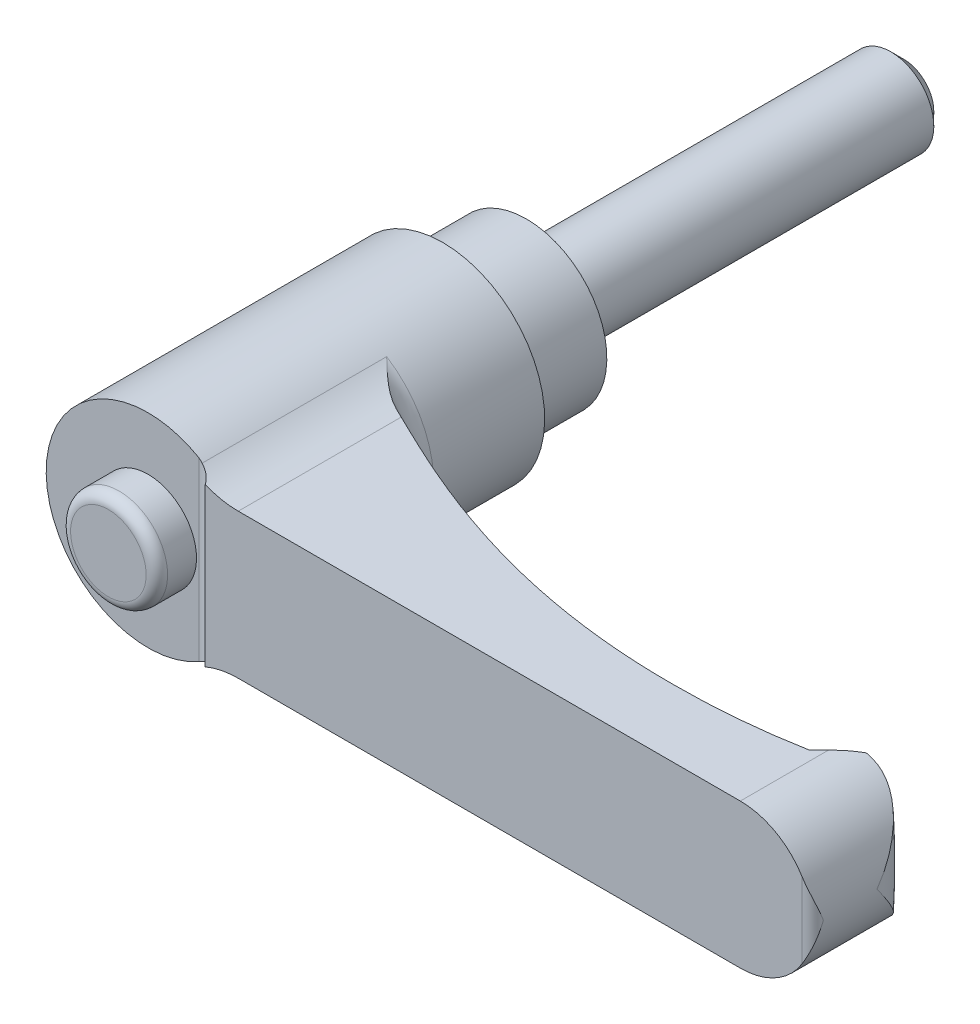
ISO-10303-21;
HEADER;
FILE_DESCRIPTION(('STEP AP214'),'2;1');
FILE_NAME('part.step','',(''),(''),'','','');
FILE_SCHEMA(('AUTOMOTIVE_DESIGN { 1 0 10303 214 1 1 1 1 }'));
ENDSEC;
DATA;
#1=APPLICATION_CONTEXT('core data for automotive mechanical design processes');
#2=APPLICATION_PROTOCOL_DEFINITION('international standard','automotive_design',2000,#1);
#3=PRODUCT_CONTEXT('',#1,'mechanical');
#4=PRODUCT('Part','Part','',(#3));
#5=PRODUCT_RELATED_PRODUCT_CATEGORY('part','',(#4));
#6=PRODUCT_DEFINITION_FORMATION('','',#4);
#7=PRODUCT_DEFINITION_CONTEXT('part definition',#1,'design');
#8=PRODUCT_DEFINITION('design','',#6,#7);
#9=PRODUCT_DEFINITION_SHAPE('','',#8);
#10=(LENGTH_UNIT() NAMED_UNIT(*) SI_UNIT(.MILLI.,.METRE.));
#11=(NAMED_UNIT(*) PLANE_ANGLE_UNIT() SI_UNIT($,.RADIAN.));
#12=(NAMED_UNIT(*) SI_UNIT($,.STERADIAN.) SOLID_ANGLE_UNIT());
#13=UNCERTAINTY_MEASURE_WITH_UNIT(LENGTH_MEASURE(1.E-05),#10,'distance_accuracy_value','');
#14=(GEOMETRIC_REPRESENTATION_CONTEXT(3) GLOBAL_UNCERTAINTY_ASSIGNED_CONTEXT((#13)) GLOBAL_UNIT_ASSIGNED_CONTEXT((#10,
#11,#12)) REPRESENTATION_CONTEXT('',''));
#15=CARTESIAN_POINT('',(0.,0.,0.));
#16=DIRECTION('',(0.,0.,1.));
#17=DIRECTION('',(1.,0.,0.));
#18=AXIS2_PLACEMENT_3D('',#15,#16,#17);
#19=CARTESIAN_POINT('',(6.,0.,0.));
#20=DIRECTION('',(0.,0.,1.));
#21=DIRECTION('',(0.,-1.,0.));
#22=AXIS2_PLACEMENT_3D('',#19,#20,#21);
#23=PLANE('',#22);
#24=CARTESIAN_POINT('',(0.,0.,0.));
#25=DIRECTION('',(0.,0.,-1.));
#26=DIRECTION('',(0.,1.,0.));
#27=AXIS2_PLACEMENT_3D('',#24,#25,#26);
#28=CIRCLE('',#27,4.);
#29=CARTESIAN_POINT('',(0.,4.,0.));
#30=VERTEX_POINT('',#29);
#31=EDGE_CURVE('E423',#30,#30,#28,.T.);
#32=ORIENTED_EDGE('',*,*,#31,.F.);
#33=EDGE_LOOP('',(#32));
#34=FACE_BOUND('',#33,.T.);
#35=CARTESIAN_POINT('',(0.,0.,0.));
#36=DIRECTION('',(0.,0.,-1.));
#37=DIRECTION('',(0.,1.,0.));
#38=AXIS2_PLACEMENT_3D('',#35,#36,#37);
#39=CIRCLE('',#38,6.);
#40=CARTESIAN_POINT('',(0.,6.,0.));
#41=VERTEX_POINT('',#40);
#42=EDGE_CURVE('E347',#41,#41,#39,.T.);
#43=ORIENTED_EDGE('',*,*,#42,.T.);
#44=EDGE_LOOP('',(#43));
#45=FACE_BOUND('',#44,.T.);
#46=ADVANCED_FACE('F14',(#34,#45),#23,.F.);
#47=CARTESIAN_POINT('',(0.,0.,35.5));
#48=DIRECTION('',(0.,0.,-1.));
#49=DIRECTION('',(0.,1.,0.));
#50=AXIS2_PLACEMENT_3D('',#47,#48,#49);
#51=PLANE('',#50);
#52=CARTESIAN_POINT('',(0.,0.,35.5));
#53=DIRECTION('',(0.,0.,-1.));
#54=DIRECTION('',(0.,1.,0.));
#55=AXIS2_PLACEMENT_3D('',#52,#53,#54);
#56=CIRCLE('',#55,9.5);
#57=CARTESIAN_POINT('',(4.75,-8.22724133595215,35.5));
#58=VERTEX_POINT('',#57);
#59=CARTESIAN_POINT('',(4.75,8.22724133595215,35.5));
#60=VERTEX_POINT('',#59);
#61=EDGE_CURVE('E332',#58,#60,#56,.T.);
#62=ORIENTED_EDGE('',*,*,#61,.F.);
#63=DIRECTION('',(0.,1.,0.));
#64=VECTOR('',#63,1.);
#65=CARTESIAN_POINT('',(4.75,-13.5,35.5));
#66=LINE('',#65,#64);
#67=EDGE_CURVE('E383',#58,#60,#66,.T.);
#68=ORIENTED_EDGE('',*,*,#67,.T.);
#69=EDGE_LOOP('',(#62,#68));
#70=FACE_BOUND('',#69,.T.);
#71=CARTESIAN_POINT('',(0.,0.,35.5));
#72=DIRECTION('',(0.,0.,-1.));
#73=DIRECTION('',(0.,1.,0.));
#74=AXIS2_PLACEMENT_3D('',#71,#72,#73);
#75=CIRCLE('',#74,4.52380952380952);
#76=CARTESIAN_POINT('',(0.,4.52380952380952,35.5));
#77=VERTEX_POINT('',#76);
#78=EDGE_CURVE('E183',#77,#77,#75,.F.);
#79=ORIENTED_EDGE('',*,*,#78,.F.);
#80=EDGE_LOOP('',(#79));
#81=FACE_BOUND('',#80,.T.);
#82=ADVANCED_FACE('F158',(#70,#81),#51,.F.);
#83=CARTESIAN_POINT('',(56.25,0.,0.));
#84=DIRECTION('',(0.,0.,1.));
#85=DIRECTION('',(0.,-1.,0.));
#86=AXIS2_PLACEMENT_3D('',#83,#84,#85);
#87=CYLINDRICAL_SURFACE('',#86,6.75);
#88=CARTESIAN_POINT('',(63.,0.,30.5));
#89=CARTESIAN_POINT('',(63.0000000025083,-0.0046874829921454,30.4965903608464));
#90=CARTESIAN_POINT('',(62.9999951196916,-0.0093750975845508,30.4931806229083));
#91=CARTESIAN_POINT('',(62.9990237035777,-0.475524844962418,30.1541065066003));
#92=CARTESIAN_POINT('',(62.9507141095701,-0.938185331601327,29.8175642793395));
#93=CARTESIAN_POINT('',(62.8060463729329,-1.62346497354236,29.3225480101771));
#94=CARTESIAN_POINT('',(62.7456147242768,-1.85084323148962,29.1588881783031));
#95=CARTESIAN_POINT('',(62.6000044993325,-2.30127271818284,28.8365968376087));
#96=CARTESIAN_POINT('',(62.5148384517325,-2.52432607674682,28.6779628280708));
#97=CARTESIAN_POINT('',(62.344804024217,-2.90644000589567,28.4087021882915));
#98=CARTESIAN_POINT('',(62.2657268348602,-3.06692788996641,28.2964051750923));
#99=CARTESIAN_POINT('',(62.0934111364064,-3.38371909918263,28.0768184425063));
#100=CARTESIAN_POINT('',(62.0001726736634,-3.5400224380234,27.9695287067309));
#101=CARTESIAN_POINT('',(61.7993668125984,-3.84715615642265,27.7614384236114));
#102=CARTESIAN_POINT('',(61.6918275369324,-3.99799655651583,27.6606257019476));
#103=CARTESIAN_POINT('',(61.4620426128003,-4.29326696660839,27.4668757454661));
#104=CARTESIAN_POINT('',(61.3398014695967,-4.43769892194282,27.3739361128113));
#105=CARTESIAN_POINT('',(61.0188552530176,-4.78536684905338,27.1560724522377));
#106=CARTESIAN_POINT('',(60.8112818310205,-4.9842025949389,27.0367418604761));
#107=CARTESIAN_POINT('',(60.4758984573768,-5.26551240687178,26.8795376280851));
#108=CARTESIAN_POINT('',(60.3601030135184,-5.35645651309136,26.8307690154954));
#109=CARTESIAN_POINT('',(60.1206554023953,-5.53195453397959,26.7416778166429));
#110=CARTESIAN_POINT('',(59.997005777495,-5.61651049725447,26.7013525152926));
#111=CARTESIAN_POINT('',(59.7699445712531,-5.76076929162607,26.6381973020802));
#112=CARTESIAN_POINT('',(59.667954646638,-5.82188686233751,26.6134697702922));
#113=CARTESIAN_POINT('',(59.4598154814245,-5.93917869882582,26.5707512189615));
#114=CARTESIAN_POINT('',(59.3536672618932,-5.99535416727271,26.5527585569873));
#115=CARTESIAN_POINT('',(59.1377410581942,-6.10229132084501,26.5242546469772));
#116=CARTESIAN_POINT('',(59.0279645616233,-6.15305518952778,26.5137403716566));
#117=CARTESIAN_POINT('',(58.8054681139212,-6.24873887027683,26.5009304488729));
#118=CARTESIAN_POINT('',(58.6927495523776,-6.29366138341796,26.4986309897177));
#119=CARTESIAN_POINT('',(58.4641163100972,-6.37770798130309,26.502966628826));
#120=CARTESIAN_POINT('',(58.3481815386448,-6.41677354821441,26.5096859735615));
#121=CARTESIAN_POINT('',(58.1152313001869,-6.48831686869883,26.5328398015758));
#122=CARTESIAN_POINT('',(57.9982157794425,-6.52079429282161,26.5492747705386));
#123=CARTESIAN_POINT('',(57.7644328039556,-6.57901960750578,26.5923251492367));
#124=CARTESIAN_POINT('',(57.6476652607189,-6.60477054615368,26.618935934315));
#125=CARTESIAN_POINT('',(57.41573023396,-6.64962508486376,26.6826067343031));
#126=CARTESIAN_POINT('',(57.3005622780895,-6.66873068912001,26.7196635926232));
#127=CARTESIAN_POINT('',(57.104290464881,-6.69624244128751,26.7926929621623));
#128=CARTESIAN_POINT('',(57.0224673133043,-6.70614558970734,26.8262017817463));
#129=CARTESIAN_POINT('',(56.8609556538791,-6.72278366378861,26.8986767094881));
#130=CARTESIAN_POINT('',(56.781266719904,-6.72951922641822,26.9376417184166));
#131=CARTESIAN_POINT('',(56.624433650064,-6.74006528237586,27.0209540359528));
#132=CARTESIAN_POINT('',(56.5472927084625,-6.74387222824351,27.0653077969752));
#133=CARTESIAN_POINT('',(56.3961054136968,-6.74884425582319,27.1591719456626));
#134=CARTESIAN_POINT('',(56.3220596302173,-6.75000885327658,27.2086832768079));
#135=CARTESIAN_POINT('',(56.2498,-6.74999999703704,27.2606710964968));
#136=B_SPLINE_CURVE_WITH_KNOTS('',3,(#88,#89,#90,#91,#92,#93,#94,#95,#96,#97,#98,#99,#100,#101,
#102,#103,#104,#105,#106,#107,#108,#109,#110,#111,#112,#113,#114,#115,#116,#117,#118,#119,#120,
#121,#122,#123,#124,#125,#126,#127,#128,#129,#130,#131,#132,#133,#134,#135),.UNSPECIFIED.,.F.,
.F.,(4,2,2,2,2,2,2,2,2,2,2,2,2,2,2,2,2,2,2,2,2,2,2,4),(0.,0.0173896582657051,1.7292315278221,
2.5882674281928,3.44686895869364,4.08007105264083,4.71327107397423,5.34524382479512,
5.97702340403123,6.9068284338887,7.37170994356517,7.83644173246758,8.20045511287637,
8.56437966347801,8.92815681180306,9.29176514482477,9.65879376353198,10.0258407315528,
10.3927210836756,10.7594906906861,11.0261722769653,11.2928002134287,11.5597506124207,
11.8267499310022),.UNSPECIFIED.);
#137=CARTESIAN_POINT('',(58.6622222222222,-6.30425919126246,26.5));
#138=VERTEX_POINT('',#137);
#139=CARTESIAN_POINT('',(63.,0.,30.5));
#140=VERTEX_POINT('',#139);
#141=EDGE_CURVE('E126',#138,#140,#136,.F.);
#142=ORIENTED_EDGE('',*,*,#141,.T.);
#143=CARTESIAN_POINT('',(63.,0.,30.5));
#144=CARTESIAN_POINT('',(63.0000000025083,0.00468748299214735,30.4965903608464));
#145=CARTESIAN_POINT('',(62.9999951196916,0.00937509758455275,30.4931806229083));
#146=CARTESIAN_POINT('',(62.9990237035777,0.47552484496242,30.1541065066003));
#147=CARTESIAN_POINT('',(62.9507141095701,0.938185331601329,29.8175642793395));
#148=CARTESIAN_POINT('',(62.8060463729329,1.62346497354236,29.3225480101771));
#149=CARTESIAN_POINT('',(62.7456147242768,1.85084323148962,29.1588881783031));
#150=CARTESIAN_POINT('',(62.6000044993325,2.30127271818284,28.8365968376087));
#151=CARTESIAN_POINT('',(62.5148384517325,2.52432607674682,28.6779628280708));
#152=CARTESIAN_POINT('',(62.344804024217,2.90644000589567,28.4087021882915));
#153=CARTESIAN_POINT('',(62.2657268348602,3.06692788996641,28.2964051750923));
#154=CARTESIAN_POINT('',(62.0934111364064,3.38371909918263,28.0768184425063));
#155=CARTESIAN_POINT('',(62.0001726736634,3.5400224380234,27.9695287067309));
#156=CARTESIAN_POINT('',(61.7993668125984,3.84715615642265,27.7614384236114));
#157=CARTESIAN_POINT('',(61.6918275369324,3.99799655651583,27.6606257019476));
#158=CARTESIAN_POINT('',(61.4620426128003,4.29326696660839,27.4668757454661));
#159=CARTESIAN_POINT('',(61.3398014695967,4.43769892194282,27.3739361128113));
#160=CARTESIAN_POINT('',(61.0188552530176,4.78536684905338,27.1560724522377));
#161=CARTESIAN_POINT('',(60.8112818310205,4.9842025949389,27.0367418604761));
#162=CARTESIAN_POINT('',(60.4758984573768,5.26551240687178,26.8795376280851));
#163=CARTESIAN_POINT('',(60.3601030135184,5.35645651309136,26.8307690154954));
#164=CARTESIAN_POINT('',(60.1206554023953,5.53195453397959,26.7416778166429));
#165=CARTESIAN_POINT('',(59.997005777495,5.61651049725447,26.7013525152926));
#166=CARTESIAN_POINT('',(59.7699445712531,5.76076929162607,26.6381973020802));
#167=CARTESIAN_POINT('',(59.667954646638,5.82188686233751,26.6134697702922));
#168=CARTESIAN_POINT('',(59.4598154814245,5.93917869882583,26.5707512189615));
#169=CARTESIAN_POINT('',(59.3536672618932,5.99535416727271,26.5527585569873));
#170=CARTESIAN_POINT('',(59.1377410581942,6.10229132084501,26.5242546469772));
#171=CARTESIAN_POINT('',(59.0279645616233,6.15305518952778,26.5137403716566));
#172=CARTESIAN_POINT('',(58.8054681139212,6.24873887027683,26.5009304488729));
#173=CARTESIAN_POINT('',(58.6927495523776,6.29366138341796,26.4986309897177));
#174=CARTESIAN_POINT('',(58.4641163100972,6.37770798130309,26.502966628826));
#175=CARTESIAN_POINT('',(58.3481815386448,6.41677354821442,26.5096859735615));
#176=CARTESIAN_POINT('',(58.1152313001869,6.48831686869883,26.5328398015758));
#177=CARTESIAN_POINT('',(57.9982157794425,6.52079429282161,26.5492747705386));
#178=CARTESIAN_POINT('',(57.7644328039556,6.57901960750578,26.5923251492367));
#179=CARTESIAN_POINT('',(57.6476652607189,6.60477054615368,26.618935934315));
#180=CARTESIAN_POINT('',(57.41573023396,6.64962508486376,26.6826067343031));
#181=CARTESIAN_POINT('',(57.3005622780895,6.66873068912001,26.7196635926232));
#182=CARTESIAN_POINT('',(57.1042904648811,6.69624244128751,26.7926929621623));
#183=CARTESIAN_POINT('',(57.0224673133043,6.70614558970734,26.8262017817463));
#184=CARTESIAN_POINT('',(56.8609556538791,6.72278366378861,26.8986767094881));
#185=CARTESIAN_POINT('',(56.781266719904,6.72951922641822,26.9376417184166));
#186=CARTESIAN_POINT('',(56.624433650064,6.74006528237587,27.0209540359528));
#187=CARTESIAN_POINT('',(56.5472927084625,6.74387222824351,27.0653077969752));
#188=CARTESIAN_POINT('',(56.3961054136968,6.74884425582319,27.1591719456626));
#189=CARTESIAN_POINT('',(56.3220596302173,6.75000885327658,27.2086832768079));
#190=CARTESIAN_POINT('',(56.2498,6.74999999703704,27.2606710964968));
#191=B_SPLINE_CURVE_WITH_KNOTS('',3,(#143,#144,#145,#146,#147,#148,#149,#150,#151,#152,#153,
#154,#155,#156,#157,#158,#159,#160,#161,#162,#163,#164,#165,#166,#167,#168,#169,#170,#171,#172,
#173,#174,#175,#176,#177,#178,#179,#180,#181,#182,#183,#184,#185,#186,#187,#188,#189,#190),
.UNSPECIFIED.,.F.,.F.,(4,2,2,2,2,2,2,2,2,2,2,2,2,2,2,2,2,2,2,2,2,2,2,4),(0.,0.0173896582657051,
1.7292315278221,2.5882674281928,3.44686895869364,4.08007105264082,4.71327107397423,
5.34524382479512,5.97702340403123,6.9068284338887,7.37170994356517,7.83644173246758,
8.20045511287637,8.56437966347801,8.92815681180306,9.29176514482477,9.65879376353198,
10.0258407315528,10.3927210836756,10.7594906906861,11.0261722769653,11.2928002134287,
11.5597506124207,11.8267499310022),.UNSPECIFIED.);
#192=CARTESIAN_POINT('',(58.6622222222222,6.30425919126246,26.5));
#193=VERTEX_POINT('',#192);
#194=EDGE_CURVE('E123',#140,#193,#191,.T.);
#195=ORIENTED_EDGE('',*,*,#194,.T.);
#196=CARTESIAN_POINT('',(56.25,0.,26.5));
#197=DIRECTION('',(0.,0.,-1.));
#198=DIRECTION('',(0.,1.,0.));
#199=AXIS2_PLACEMENT_3D('',#196,#197,#198);
#200=CIRCLE('',#199,6.75);
#201=CARTESIAN_POINT('',(58.,6.51920240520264,26.5));
#202=VERTEX_POINT('',#201);
#203=EDGE_CURVE('E308',#193,#202,#200,.F.);
#204=ORIENTED_EDGE('',*,*,#203,.T.);
#205=CARTESIAN_POINT('',(56.25,0.,28.25));
#206=DIRECTION('',(-0.707106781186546,0.,-0.70710678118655));
#207=DIRECTION('',(-0.70710678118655,0.,0.707106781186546));
#208=AXIS2_PLACEMENT_3D('',#205,#206,#207);
#209=ELLIPSE('',#208,9.54594154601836,6.75);
#210=CARTESIAN_POINT('',(56.25,6.75,28.25));
#211=VERTEX_POINT('',#210);
#212=EDGE_CURVE('E374',#202,#211,#209,.F.);
#213=ORIENTED_EDGE('',*,*,#212,.T.);
#214=DIRECTION('',(0.,0.,1.));
#215=VECTOR('',#214,1.);
#216=CARTESIAN_POINT('',(56.25,6.75,0.));
#217=LINE('',#216,#215);
#218=CARTESIAN_POINT('',(56.25,6.75,36.5));
#219=VERTEX_POINT('',#218);
#220=EDGE_CURVE('E330',#211,#219,#217,.T.);
#221=ORIENTED_EDGE('',*,*,#220,.T.);
#222=CARTESIAN_POINT('',(56.25,0.,36.5));
#223=DIRECTION('',(0.,0.,1.));
#224=DIRECTION('',(0.,-1.,0.));
#225=AXIS2_PLACEMENT_3D('',#222,#223,#224);
#226=CIRCLE('',#225,6.75);
#227=CARTESIAN_POINT('',(62.,3.53553390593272,36.5));
#228=VERTEX_POINT('',#227);
#229=EDGE_CURVE('E322',#228,#219,#226,.T.);
#230=ORIENTED_EDGE('',*,*,#229,.F.);
#231=CARTESIAN_POINT('',(62.,3.53553390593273,36.5));
#232=CARTESIAN_POINT('',(62.0299932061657,3.48675666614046,36.4999933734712));
#233=CARTESIAN_POINT('',(62.0593538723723,3.43761273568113,36.4986515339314));
#234=CARTESIAN_POINT('',(62.1167538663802,3.33870692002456,36.4935798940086));
#235=CARTESIAN_POINT('',(62.1447937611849,3.28894531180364,36.489851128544));
#236=CARTESIAN_POINT('',(62.2267562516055,3.13908056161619,36.4755285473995));
#237=CARTESIAN_POINT('',(62.2786643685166,3.03816514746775,36.4617957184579));
#238=CARTESIAN_POINT('',(62.3766467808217,2.83536966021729,36.4277987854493));
#239=CARTESIAN_POINT('',(62.4227515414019,2.73349792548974,36.4075709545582));
#240=CARTESIAN_POINT('',(62.509502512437,2.52854152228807,36.3618646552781));
#241=CARTESIAN_POINT('',(62.550144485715,2.42545597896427,36.3363821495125));
#242=CARTESIAN_POINT('',(62.6493297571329,2.15471359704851,36.2642737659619));
#243=CARTESIAN_POINT('',(62.7035065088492,1.98634279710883,36.2142841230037));
#244=CARTESIAN_POINT('',(62.7980553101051,1.64812969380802,36.1068184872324));
#245=CARTESIAN_POINT('',(62.8384218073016,1.4782868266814,36.0493394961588));
#246=CARTESIAN_POINT('',(62.9057483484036,1.1374266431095,35.9293690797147));
#247=CARTESIAN_POINT('',(62.9326868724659,0.966407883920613,35.8668697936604));
#248=CARTESIAN_POINT('',(62.9733111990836,0.623942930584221,35.7390768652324));
#249=CARTESIAN_POINT('',(62.9870036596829,0.452496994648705,35.6737846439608));
#250=CARTESIAN_POINT('',(62.997837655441,0.192449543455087,35.5740662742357));
#251=CARTESIAN_POINT('',(62.999781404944,0.103891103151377,35.539987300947));
#252=CARTESIAN_POINT('',(62.9999941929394,0.0102233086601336,35.5039349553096));
#253=CARTESIAN_POINT('',(62.9999999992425,0.00511164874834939,35.5019674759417));
#254=CARTESIAN_POINT('',(63.,0.,35.5));
#255=B_SPLINE_CURVE_WITH_KNOTS('',3,(#231,#232,#233,#234,#235,#236,#237,#238,#239,#240,#241,
#242,#243,#244,#245,#246,#247,#248,#249,#250,#251,#252,#253,#254),.UNSPECIFIED.,.F.,.F.,(4,2,2,
2,2,2,2,2,2,2,2,4),(0.,0.171732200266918,0.343389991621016,0.685890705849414,1.02651095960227,
1.36739390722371,1.91796289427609,2.46875297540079,3.02042294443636,3.57181547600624,
3.85648313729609,3.87291482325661),.UNSPECIFIED.);
#256=CARTESIAN_POINT('',(63.,0.,35.5));
#257=VERTEX_POINT('',#256);
#258=EDGE_CURVE('E169',#257,#228,#255,.F.);
#259=ORIENTED_EDGE('',*,*,#258,.F.);
#260=CARTESIAN_POINT('',(62.,-3.53553390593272,36.5));
#261=CARTESIAN_POINT('',(62.0299932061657,-3.48675666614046,36.4999933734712));
#262=CARTESIAN_POINT('',(62.0593538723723,-3.43761273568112,36.4986515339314));
#263=CARTESIAN_POINT('',(62.1167538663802,-3.33870692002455,36.4935798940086));
#264=CARTESIAN_POINT('',(62.1447937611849,-3.28894531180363,36.489851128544));
#265=CARTESIAN_POINT('',(62.2267562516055,-3.13908056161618,36.4755285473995));
#266=CARTESIAN_POINT('',(62.2786643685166,-3.03816514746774,36.4617957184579));
#267=CARTESIAN_POINT('',(62.3766467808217,-2.83536966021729,36.4277987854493));
#268=CARTESIAN_POINT('',(62.4227515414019,-2.73349792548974,36.4075709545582));
#269=CARTESIAN_POINT('',(62.509502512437,-2.52854152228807,36.3618646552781));
#270=CARTESIAN_POINT('',(62.550144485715,-2.42545597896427,36.3363821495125));
#271=CARTESIAN_POINT('',(62.6493297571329,-2.15471359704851,36.2642737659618));
#272=CARTESIAN_POINT('',(62.7035065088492,-1.98634279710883,36.2142841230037));
#273=CARTESIAN_POINT('',(62.7980553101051,-1.64812969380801,36.1068184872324));
#274=CARTESIAN_POINT('',(62.8384218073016,-1.4782868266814,36.0493394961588));
#275=CARTESIAN_POINT('',(62.9057483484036,-1.1374266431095,35.9293690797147));
#276=CARTESIAN_POINT('',(62.9326868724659,-0.966407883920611,35.8668697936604));
#277=CARTESIAN_POINT('',(62.9733111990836,-0.623942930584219,35.7390768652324));
#278=CARTESIAN_POINT('',(62.9870036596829,-0.452496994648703,35.6737846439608));
#279=CARTESIAN_POINT('',(62.997837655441,-0.192449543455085,35.5740662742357));
#280=CARTESIAN_POINT('',(62.999781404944,-0.103891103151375,35.539987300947));
#281=CARTESIAN_POINT('',(62.9999941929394,-0.0102233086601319,35.5039349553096));
#282=CARTESIAN_POINT('',(62.9999999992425,-0.00511164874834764,35.5019674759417));
#283=CARTESIAN_POINT('',(63.,0.,35.5));
#284=B_SPLINE_CURVE_WITH_KNOTS('',3,(#260,#261,#262,#263,#264,#265,#266,#267,#268,#269,#270,
#271,#272,#273,#274,#275,#276,#277,#278,#279,#280,#281,#282,#283),.UNSPECIFIED.,.F.,.F.,(4,2,2,
2,2,2,2,2,2,2,2,4),(0.,0.171732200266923,0.34338999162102,0.685890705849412,1.02651095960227,
1.36739390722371,1.91796289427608,2.46875297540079,3.02042294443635,3.57181547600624,
3.85648313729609,3.8729148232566),.UNSPECIFIED.);
#285=CARTESIAN_POINT('',(62.,-3.53553390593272,36.5));
#286=VERTEX_POINT('',#285);
#287=EDGE_CURVE('E177',#286,#257,#284,.T.);
#288=ORIENTED_EDGE('',*,*,#287,.F.);
#289=CARTESIAN_POINT('',(56.25,-6.75,36.5));
#290=VERTEX_POINT('',#289);
#291=EDGE_CURVE('E310',#290,#286,#226,.T.);
#292=ORIENTED_EDGE('',*,*,#291,.F.);
#293=DIRECTION('',(0.,0.,1.));
#294=VECTOR('',#293,1.);
#295=CARTESIAN_POINT('',(56.25,-6.75,0.));
#296=LINE('',#295,#294);
#297=CARTESIAN_POINT('',(56.25,-6.75,28.25));
#298=VERTEX_POINT('',#297);
#299=EDGE_CURVE('E355',#298,#290,#296,.T.);
#300=ORIENTED_EDGE('',*,*,#299,.F.);
#301=CARTESIAN_POINT('',(58.,-6.51920240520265,26.5));
#302=VERTEX_POINT('',#301);
#303=EDGE_CURVE('E375',#298,#302,#209,.F.);
#304=ORIENTED_EDGE('',*,*,#303,.T.);
#305=EDGE_CURVE('E134',#302,#138,#200,.F.);
#306=ORIENTED_EDGE('',*,*,#305,.T.);
#307=EDGE_LOOP('',(#142,#195,#204,#213,#221,#230,#259,#288,#292,#300,#304,#306));
#308=FACE_BOUND('',#307,.T.);
#309=ADVANCED_FACE('F132',(#308),#87,.T.);
#310=CARTESIAN_POINT('',(59.,-13.5,26.5));
#311=DIRECTION('',(0.,0.,-1.));
#312=DIRECTION('',(0.,1.,0.));
#313=AXIS2_PLACEMENT_3D('',#310,#311,#312);
#314=PLANE('',#313);
#315=ORIENTED_EDGE('',*,*,#203,.F.);
#316=CARTESIAN_POINT('',(0.,0.,26.5));
#317=DIRECTION('',(0.,0.,-1.));
#318=DIRECTION('',(0.,1.,0.));
#319=AXIS2_PLACEMENT_3D('',#316,#317,#318);
#320=CIRCLE('',#319,59.);
#321=EDGE_CURVE('E37',#193,#138,#320,.T.);
#322=ORIENTED_EDGE('',*,*,#321,.T.);
#323=ORIENTED_EDGE('',*,*,#305,.F.);
#324=DIRECTION('',(0.,1.,0.));
#325=VECTOR('',#324,1.);
#326=CARTESIAN_POINT('',(58.,-13.5,26.5));
#327=LINE('',#326,#325);
#328=EDGE_CURVE('E327',#302,#202,#327,.T.);
#329=ORIENTED_EDGE('',*,*,#328,.T.);
#330=EDGE_LOOP('',(#315,#322,#323,#329));
#331=FACE_BOUND('',#330,.T.);
#332=ADVANCED_FACE('F157',(#331),#314,.T.);
#333=CARTESIAN_POINT('',(0.,0.,36.5));
#334=DIRECTION('',(0.,0.,1.));
#335=DIRECTION('',(0.,-1.,0.));
#336=AXIS2_PLACEMENT_3D('',#333,#334,#335);
#337=PLANE('',#336);
#338=CARTESIAN_POINT('',(9.41740410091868,14.75,36.5));
#339=DIRECTION('',(0.,0.,1.));
#340=DIRECTION('',(1.,0.,0.));
#341=AXIS2_PLACEMENT_3D('',#338,#339,#340);
#342=CIRCLE('',#341,8.);
#343=CARTESIAN_POINT('',(6.33333333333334,7.36836688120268,36.5));
#344=VERTEX_POINT('',#343);
#345=CARTESIAN_POINT('',(9.41740410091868,6.75,36.5));
#346=VERTEX_POINT('',#345);
#347=EDGE_CURVE('E369',#344,#346,#342,.T.);
#348=ORIENTED_EDGE('',*,*,#347,.F.);
#349=DIRECTION('',(0.,1.,0.));
#350=VECTOR('',#349,1.);
#351=CARTESIAN_POINT('',(6.33333333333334,-13.5,36.5));
#352=LINE('',#351,#350);
#353=CARTESIAN_POINT('',(6.33333333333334,-7.36836688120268,36.5));
#354=VERTEX_POINT('',#353);
#355=EDGE_CURVE('E326',#354,#344,#352,.T.);
#356=ORIENTED_EDGE('',*,*,#355,.F.);
#357=CARTESIAN_POINT('',(9.41740410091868,-14.75,36.5));
#358=DIRECTION('',(0.,0.,1.));
#359=DIRECTION('',(1.,0.,0.));
#360=AXIS2_PLACEMENT_3D('',#357,#358,#359);
#361=CIRCLE('',#360,8.);
#362=CARTESIAN_POINT('',(9.41740410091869,-6.75,36.5));
#363=VERTEX_POINT('',#362);
#364=EDGE_CURVE('E361',#363,#354,#361,.T.);
#365=ORIENTED_EDGE('',*,*,#364,.F.);
#366=DIRECTION('',(-1.,0.,0.));
#367=VECTOR('',#366,1.);
#368=CARTESIAN_POINT('',(56.25,-6.75,36.5));
#369=LINE('',#368,#367);
#370=EDGE_CURVE('E364',#290,#363,#369,.T.);
#371=ORIENTED_EDGE('',*,*,#370,.F.);
#372=ORIENTED_EDGE('',*,*,#291,.T.);
#373=DIRECTION('',(0.,1.,0.));
#374=VECTOR('',#373,1.);
#375=CARTESIAN_POINT('',(62.,-13.5,36.5));
#376=LINE('',#375,#374);
#377=EDGE_CURVE('E315',#286,#228,#376,.T.);
#378=ORIENTED_EDGE('',*,*,#377,.T.);
#379=ORIENTED_EDGE('',*,*,#229,.T.);
#380=DIRECTION('',(1.,0.,0.));
#381=VECTOR('',#380,1.);
#382=CARTESIAN_POINT('',(9.41740410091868,6.75,36.5));
#383=LINE('',#382,#381);
#384=EDGE_CURVE('E367',#346,#219,#383,.T.);
#385=ORIENTED_EDGE('',*,*,#384,.F.);
#386=EDGE_LOOP('',(#348,#356,#365,#371,#372,#378,#379,#385));
#387=FACE_BOUND('',#386,.T.);
#388=ADVANCED_FACE('F240',(#387),#337,.T.);
#389=CARTESIAN_POINT('',(0.,0.,0.));
#390=DIRECTION('',(0.,0.,-1.));
#391=DIRECTION('',(0.,1.,0.));
#392=AXIS2_PLACEMENT_3D('',#389,#390,#391);
#393=CYLINDRICAL_SURFACE('',#392,9.5);
#394=CARTESIAN_POINT('',(0.,0.,18.3481601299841));
#395=DIRECTION('',(0.,0.,-1.));
#396=DIRECTION('',(0.,1.,0.));
#397=AXIS2_PLACEMENT_3D('',#394,#395,#396);
#398=CIRCLE('',#397,9.5);
#399=CARTESIAN_POINT('',(5.11230508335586,8.00714285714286,18.3481601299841));
#400=VERTEX_POINT('',#399);
#401=CARTESIAN_POINT('',(5.11230508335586,-8.00714285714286,18.3481601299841));
#402=VERTEX_POINT('',#401);
#403=EDGE_CURVE('E413',#400,#402,#398,.T.);
#404=ORIENTED_EDGE('',*,*,#403,.T.);
#405=DIRECTION('',(0.,0.,1.));
#406=VECTOR('',#405,1.);
#407=CARTESIAN_POINT('',(5.11230508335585,-8.00714285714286,0.));
#408=LINE('',#407,#406);
#409=CARTESIAN_POINT('',(5.11230508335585,-8.00714285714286,35.5614827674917));
#410=VERTEX_POINT('',#409);
#411=EDGE_CURVE('E359',#402,#410,#408,.T.);
#412=ORIENTED_EDGE('',*,*,#411,.T.);
#413=CARTESIAN_POINT('',(4.75,-8.22724133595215,35.5));
#414=CARTESIAN_POINT('',(4.82354897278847,-8.18479174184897,35.5056127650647));
#415=CARTESIAN_POINT('',(4.89626028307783,-8.1414834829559,35.5152432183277));
#416=CARTESIAN_POINT('',(5.03945202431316,-8.05362753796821,35.5421901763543));
#417=CARTESIAN_POINT('',(5.10993308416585,-8.00908020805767,35.5595044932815));
#418=CARTESIAN_POINT('',(5.24861636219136,-7.91889687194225,35.6016146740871));
#419=CARTESIAN_POINT('',(5.31680005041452,-7.87325555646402,35.6264601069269));
#420=CARTESIAN_POINT('',(5.44990684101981,-7.7817124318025,35.6832973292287));
#421=CARTESIAN_POINT('',(5.51483003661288,-7.7358106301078,35.7152889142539));
#422=CARTESIAN_POINT('',(5.69141984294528,-7.6077148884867,35.8145402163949));
#423=CARTESIAN_POINT('',(5.79903338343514,-7.52579740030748,35.8895684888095));
#424=CARTESIAN_POINT('',(5.99917718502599,-7.36722875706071,36.0610902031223));
#425=CARTESIAN_POINT('',(6.09178179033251,-7.29055280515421,36.157471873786));
#426=CARTESIAN_POINT('',(6.20382113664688,-7.19472379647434,36.3011658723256));
#427=CARTESIAN_POINT('',(6.23139044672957,-7.17084441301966,36.33916914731));
#428=CARTESIAN_POINT('',(6.28417716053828,-7.12462925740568,36.4176957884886));
#429=CARTESIAN_POINT('',(6.30939340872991,-7.1022942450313,36.4582203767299));
#430=CARTESIAN_POINT('',(6.33333333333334,-7.08088192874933,36.5));
#431=B_SPLINE_CURVE_WITH_KNOTS('',3,(#413,#414,#415,#416,#417,#418,#419,#420,#421,#422,#423,
#424,#425,#426,#427,#428,#429,#430),.UNSPECIFIED.,.F.,.F.,(4,2,2,2,2,2,2,2,4),(0.,
0.25516766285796,0.510262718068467,0.767074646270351,1.02387922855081,1.48566336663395,
1.94508518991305,2.10299549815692,2.26098294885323),.UNSPECIFIED.);
#432=EDGE_CURVE('E214',#58,#410,#431,.T.);
#433=ORIENTED_EDGE('',*,*,#432,.F.);
#434=ORIENTED_EDGE('',*,*,#61,.T.);
#435=CARTESIAN_POINT('',(6.33333333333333,7.08088192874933,36.5));
#436=CARTESIAN_POINT('',(6.30193651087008,7.10896982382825,36.4452145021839));
#437=CARTESIAN_POINT('',(6.26833956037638,7.13863883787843,36.3925689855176));
#438=CARTESIAN_POINT('',(6.19723055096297,7.20045324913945,36.2916619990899));
#439=CARTESIAN_POINT('',(6.15972345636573,7.23259549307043,36.243395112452));
#440=CARTESIAN_POINT('',(6.08131079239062,7.2986494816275,36.1513438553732));
#441=CARTESIAN_POINT('',(6.04041526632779,7.33255589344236,36.1075470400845));
#442=CARTESIAN_POINT('',(5.95546899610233,7.40171574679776,36.0242830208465));
#443=CARTESIAN_POINT('',(5.91141716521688,7.4369696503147,35.9848173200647));
#444=CARTESIAN_POINT('',(5.7754647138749,7.54368484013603,35.8733623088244));
#445=CARTESIAN_POINT('',(5.67929205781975,7.61650473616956,35.8077657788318));
#446=CARTESIAN_POINT('',(5.47750803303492,7.76289095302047,35.6942705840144));
#447=CARTESIAN_POINT('',(5.37189158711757,7.83645765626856,35.6463815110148));
#448=CARTESIAN_POINT('',(5.1806466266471,7.96370194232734,35.5790108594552));
#449=CARTESIAN_POINT('',(5.09668204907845,8.01772299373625,35.5554125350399));
#450=CARTESIAN_POINT('',(4.92555498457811,8.12398585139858,35.5192948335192));
#451=CARTESIAN_POINT('',(4.83839896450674,8.17623088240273,35.5067542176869));
#452=CARTESIAN_POINT('',(4.75,8.22724133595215,35.5));
#453=B_SPLINE_CURVE_WITH_KNOTS('',3,(#435,#436,#437,#438,#439,#440,#441,#442,#443,#444,#445,
#446,#447,#448,#449,#450,#451,#452),.UNSPECIFIED.,.F.,.F.,(4,2,2,2,2,2,2,2,4),(0.,
0.207163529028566,0.414067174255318,0.620378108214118,0.826760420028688,1.23705708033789,
1.64757566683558,1.9547198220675,2.26127274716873),.UNSPECIFIED.);
#454=CARTESIAN_POINT('',(5.11230508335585,8.00714285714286,35.5614827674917));
#455=VERTEX_POINT('',#454);
#456=EDGE_CURVE('E228',#455,#60,#453,.T.);
#457=ORIENTED_EDGE('',*,*,#456,.F.);
#458=DIRECTION('',(0.,0.,1.));
#459=VECTOR('',#458,1.);
#460=CARTESIAN_POINT('',(5.11230508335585,8.00714285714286,0.));
#461=LINE('',#460,#459);
#462=EDGE_CURVE('E350',#400,#455,#461,.T.);
#463=ORIENTED_EDGE('',*,*,#462,.F.);
#464=EDGE_LOOP('',(#404,#412,#433,#434,#457,#463));
#465=FACE_BOUND('',#464,.T.);
#466=CARTESIAN_POINT('',(0.,0.,8.));
#467=DIRECTION('',(0.,0.,-1.));
#468=DIRECTION('',(0.,1.,0.));
#469=AXIS2_PLACEMENT_3D('',#466,#467,#468);
#470=CIRCLE('',#469,9.5);
#471=CARTESIAN_POINT('',(0.,9.5,8.));
#472=VERTEX_POINT('',#471);
#473=EDGE_CURVE('E333',#472,#472,#470,.T.);
#474=ORIENTED_EDGE('',*,*,#473,.F.);
#475=EDGE_LOOP('',(#474));
#476=FACE_BOUND('',#475,.T.);
#477=ADVANCED_FACE('F238',(#465,#476),#393,.T.);
#478=CARTESIAN_POINT('',(9.41740410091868,14.75,0.));
#479=DIRECTION('',(0.,0.,1.));
#480=DIRECTION('',(0.,-1.,0.));
#481=AXIS2_PLACEMENT_3D('',#478,#479,#480);
#482=CYLINDRICAL_SURFACE('',#481,8.);
#483=DIRECTION('',(0.,0.,1.));
#484=VECTOR('',#483,1.);
#485=CARTESIAN_POINT('',(9.41740410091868,6.75,0.));
#486=LINE('',#485,#484);
#487=CARTESIAN_POINT('',(9.41740410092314,6.75,21.3021638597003));
#488=VERTEX_POINT('',#487);
#489=EDGE_CURVE('E352',#488,#346,#486,.T.);
#490=ORIENTED_EDGE('',*,*,#489,.F.);
#491=CARTESIAN_POINT('',(9.41760410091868,6.7500000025,21.3022609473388));
#492=CARTESIAN_POINT('',(9.34663199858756,6.74999859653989,21.2678090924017));
#493=CARTESIAN_POINT('',(9.27552780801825,6.75094090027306,21.2336266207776));
#494=CARTESIAN_POINT('',(9.13312349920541,6.75473540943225,21.1659081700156));
#495=CARTESIAN_POINT('',(9.06182355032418,6.75758629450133,21.1323717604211));
#496=CARTESIAN_POINT('',(8.91899698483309,6.7652204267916,21.066004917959));
#497=CARTESIAN_POINT('',(8.84747036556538,6.77000369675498,21.0331744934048));
#498=CARTESIAN_POINT('',(8.704162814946,6.78153362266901,20.9682923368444));
#499=CARTESIAN_POINT('',(8.63238174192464,6.78828163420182,20.9362411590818));
#500=CARTESIAN_POINT('',(8.56050869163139,6.79602424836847,20.9046385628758));
#501=B_SPLINE_CURVE_WITH_KNOTS('',3,(#491,#492,#493,#494,#495,#496,#497,#498,#499,#500),
.UNSPECIFIED.,.F.,.F.,(4,2,2,2,4),(0.,0.236671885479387,0.473180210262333,0.709691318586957,
0.946365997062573),.UNSPECIFIED.);
#502=CARTESIAN_POINT('',(8.56096354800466,6.79597525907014,20.9048385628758));
#503=VERTEX_POINT('',#502);
#504=EDGE_CURVE('E246',#488,#503,#501,.T.);
#505=ORIENTED_EDGE('',*,*,#504,.T.);
#506=CARTESIAN_POINT('',(8.56141843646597,6.79592629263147,20.9050385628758));
#507=CARTESIAN_POINT('',(8.47420918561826,6.80531273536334,20.8666951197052));
#508=CARTESIAN_POINT('',(8.38798367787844,6.81604134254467,20.8265142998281));
#509=CARTESIAN_POINT('',(8.21753113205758,6.84002445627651,20.7428900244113));
#510=CARTESIAN_POINT('',(8.13330325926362,6.85327788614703,20.6994479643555));
#511=CARTESIAN_POINT('',(7.88393651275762,6.89653514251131,20.5650030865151));
#512=CARTESIAN_POINT('',(7.72171249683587,6.9300806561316,20.4697011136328));
#513=CARTESIAN_POINT('',(7.40583761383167,7.00533652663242,20.2709379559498));
#514=CARTESIAN_POINT('',(7.25214096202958,7.0469964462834,20.1675294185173));
#515=CARTESIAN_POINT('',(6.95163567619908,7.13786246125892,19.9540740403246));
#516=CARTESIAN_POINT('',(6.80483124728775,7.18707308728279,19.8440232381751));
#517=CARTESIAN_POINT('',(6.52235248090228,7.29074005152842,19.6227797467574));
#518=CARTESIAN_POINT('',(6.38647079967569,7.34497015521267,19.5117441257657));
#519=CARTESIAN_POINT('',(6.12012077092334,7.45966750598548,19.286442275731));
#520=CARTESIAN_POINT('',(5.98965290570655,7.5201353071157,19.1721757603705));
#521=CARTESIAN_POINT('',(5.73356790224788,7.64719834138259,18.9415280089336));
#522=CARTESIAN_POINT('',(5.60795285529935,7.71379617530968,18.825145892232));
#523=CARTESIAN_POINT('',(5.36116691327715,7.853115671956,18.5913699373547));
#524=CARTESIAN_POINT('',(5.23999538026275,7.92583645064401,18.4739762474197));
#525=CARTESIAN_POINT('',(5.11800178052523,8.00350824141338,18.3537764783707));
#526=CARTESIAN_POINT('',(5.11515285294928,8.00532465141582,18.3509683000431));
#527=CARTESIAN_POINT('',(5.11230508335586,8.00714285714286,18.3481601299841));
#528=B_SPLINE_CURVE_WITH_KNOTS('',3,(#506,#507,#508,#509,#510,#511,#512,#513,#514,#515,#516,
#517,#518,#519,#520,#521,#522,#523,#524,#525,#526,#527),.UNSPECIFIED.,.F.,.F.,(4,2,2,2,2,2,2,2,
2,2,4),(0.,0.287104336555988,0.574086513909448,1.14672714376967,1.7159158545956,
2.28544744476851,2.83621563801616,3.38703279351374,3.93808473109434,4.48905724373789,
4.50223731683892),.UNSPECIFIED.);
#529=EDGE_CURVE('E393',#503,#400,#528,.T.);
#530=ORIENTED_EDGE('',*,*,#529,.T.);
#531=ORIENTED_EDGE('',*,*,#462,.T.);
#532=CARTESIAN_POINT('',(6.33333333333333,7.36836688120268,36.5));
#533=CARTESIAN_POINT('',(6.30572631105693,7.37990157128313,36.4517939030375));
#534=CARTESIAN_POINT('',(6.27620115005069,7.39241872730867,36.4049318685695));
#535=CARTESIAN_POINT('',(6.21369042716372,7.41942165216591,36.3142041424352));
#536=CARTESIAN_POINT('',(6.18070621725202,7.433906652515,36.2703372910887));
#537=CARTESIAN_POINT('',(6.11180020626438,7.46478219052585,36.1860768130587));
#538=CARTESIAN_POINT('',(6.07589356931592,7.48116305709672,36.1456672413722));
#539=CARTESIAN_POINT('',(6.001409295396,7.51586753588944,36.0683091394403));
#540=CARTESIAN_POINT('',(5.96283154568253,7.53419123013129,36.0313607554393));
#541=CARTESIAN_POINT('',(5.84377892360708,7.59200134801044,35.9260570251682));
#542=CARTESIAN_POINT('',(5.75985492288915,7.63438377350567,35.8630866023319));
#543=CARTESIAN_POINT('',(5.58613979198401,7.72639161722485,35.7523382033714));
#544=CARTESIAN_POINT('',(5.49634385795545,7.77602300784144,35.7045728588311));
#545=CARTESIAN_POINT('',(5.35683601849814,7.85689272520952,35.6430239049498));
#546=CARTESIAN_POINT('',(5.30809845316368,7.88582630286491,35.6238148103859));
#547=CARTESIAN_POINT('',(5.21035384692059,7.94529574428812,35.5895762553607));
#548=CARTESIAN_POINT('',(5.1613480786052,7.975826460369,35.5745342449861));
#549=CARTESIAN_POINT('',(5.11230508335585,8.00714285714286,35.5614827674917));
#550=B_SPLINE_CURVE_WITH_KNOTS('',3,(#532,#533,#534,#535,#536,#537,#538,#539,#540,#541,#542,
#543,#544,#545,#546,#547,#548,#549),.UNSPECIFIED.,.F.,.F.,(4,2,2,2,2,2,2,2,4),(0.,
0.170139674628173,0.340213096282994,0.50945430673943,0.678702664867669,1.01657399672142,
1.35472528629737,1.53411415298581,1.7129567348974),.UNSPECIFIED.);
#551=EDGE_CURVE('E222',#344,#455,#550,.T.);
#552=ORIENTED_EDGE('',*,*,#551,.F.);
#553=ORIENTED_EDGE('',*,*,#347,.T.);
#554=EDGE_LOOP('',(#490,#505,#530,#531,#552,#553));
#555=FACE_BOUND('',#554,.T.);
#556=ADVANCED_FACE('F234',(#555),#482,.F.);
#557=CARTESIAN_POINT('',(9.41740410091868,6.75,0.));
#558=DIRECTION('',(0.,-1.,0.));
#559=DIRECTION('',(1.,0.,0.));
#560=AXIS2_PLACEMENT_3D('',#557,#558,#559);
#561=PLANE('',#560);
#562=CARTESIAN_POINT('',(43.8904150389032,6.75,-32.7854085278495));
#563=DIRECTION('',(0.,-1.,0.));
#564=DIRECTION('',(1.,0.,0.));
#565=AXIS2_PLACEMENT_3D('',#562,#563,#564);
#566=CIRCLE('',#565,63.);
#567=CARTESIAN_POINT('',(43.630890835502,6.75000000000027,30.2140569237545));
#568=VERTEX_POINT('',#567);
#569=CARTESIAN_POINT('',(55.3333333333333,6.75,29.1666666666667));
#570=VERTEX_POINT('',#569);
#571=EDGE_CURVE('E376',#568,#570,#566,.F.);
#572=ORIENTED_EDGE('',*,*,#571,.F.);
#573=CARTESIAN_POINT('',(31.7211018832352,6.75,29.163677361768));
#574=CARTESIAN_POINT('',(30.4815814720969,6.75,28.9394124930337));
#575=CARTESIAN_POINT('',(29.248337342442,6.75,28.6800208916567));
#576=CARTESIAN_POINT('',(26.798292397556,6.75,28.093381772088));
#577=CARTESIAN_POINT('',(25.5814894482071,6.75,27.7661431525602));
#578=CARTESIAN_POINT('',(23.7726077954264,6.75,27.2275084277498));
#579=CARTESIAN_POINT('',(23.1732161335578,6.75,27.0403034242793));
#580=CARTESIAN_POINT('',(21.9794838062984,6.75,26.6504397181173));
#581=CARTESIAN_POINT('',(21.3851430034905,6.75,26.4477814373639));
#582=CARTESIAN_POINT('',(20.20172109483,6.75,26.027681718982));
#583=CARTESIAN_POINT('',(19.6126399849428,6.75,25.8102402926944));
#584=CARTESIAN_POINT('',(18.4398233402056,6.75,25.3614109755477));
#585=CARTESIAN_POINT('',(17.8560877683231,6.75,25.1300231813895));
#586=CARTESIAN_POINT('',(16.8264520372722,6.75,24.7086305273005));
#587=CARTESIAN_POINT('',(16.3794839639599,6.75,24.5212256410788));
#588=CARTESIAN_POINT('',(15.4885644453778,6.75,24.1393775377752));
#589=CARTESIAN_POINT('',(15.0446130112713,6.75,23.9449342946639));
#590=CARTESIAN_POINT('',(14.1595159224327,6.75,23.5498036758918));
#591=CARTESIAN_POINT('',(13.7183701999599,6.75,23.3491164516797));
#592=CARTESIAN_POINT('',(12.8384969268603,6.75,22.9425083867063));
#593=CARTESIAN_POINT('',(12.3997694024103,6.75,22.7365874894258));
#594=CARTESIAN_POINT('',(11.5213847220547,6.75,22.3195357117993));
#595=CARTESIAN_POINT('',(11.0817393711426,6.75,22.1083800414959));
#596=CARTESIAN_POINT('',(10.2034650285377,6.75,21.6840048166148));
#597=CARTESIAN_POINT('',(9.76483601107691,6.75,21.4707853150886));
#598=CARTESIAN_POINT('',(8.88741279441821,6.75,21.0449308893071));
#599=CARTESIAN_POINT('',(8.4486186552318,6.75,20.832295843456));
#600=CARTESIAN_POINT('',(7.7888040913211,6.75,20.5166390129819));
#601=CARTESIAN_POINT('',(7.56857842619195,6.75,20.4119614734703));
#602=CARTESIAN_POINT('',(7.12729129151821,6.75,20.2043820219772));
#603=CARTESIAN_POINT('',(6.90622982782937,6.75,20.1014800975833));
#604=CARTESIAN_POINT('',(6.48691851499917,6.75,19.9092503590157));
#605=CARTESIAN_POINT('',(6.28878981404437,6.75,19.8196589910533));
#606=CARTESIAN_POINT('',(5.89131318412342,6.75,19.6432260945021));
#607=CARTESIAN_POINT('',(5.69196528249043,6.75,19.5563845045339));
#608=CARTESIAN_POINT('',(5.29178648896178,6.75,19.3863184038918));
#609=CARTESIAN_POINT('',(5.09095599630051,6.75,19.3030929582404));
#610=CARTESIAN_POINT('',(4.68744730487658,6.75,19.1412674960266));
#611=CARTESIAN_POINT('',(4.48476921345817,6.75,19.0626672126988));
#612=CARTESIAN_POINT('',(4.07928382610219,6.75,18.9120884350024));
#613=CARTESIAN_POINT('',(3.87649877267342,6.75,18.8400507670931));
#614=CARTESIAN_POINT('',(3.46854334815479,6.75,18.7031281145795));
#615=CARTESIAN_POINT('',(3.26337283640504,6.75,18.6382435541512));
#616=CARTESIAN_POINT('',(2.64418711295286,6.75,18.4568464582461));
#617=CARTESIAN_POINT('',(2.22603982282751,6.75,18.3534128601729));
#618=CARTESIAN_POINT('',(1.65420364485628,6.75,18.2467177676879));
#619=CARTESIAN_POINT('',(1.50442360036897,6.75,18.2219398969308));
#620=CARTESIAN_POINT('',(1.20392315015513,6.75,18.1790422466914));
#621=CARTESIAN_POINT('',(1.05320291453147,6.75,18.1609212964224));
#622=CARTESIAN_POINT('',(0.751090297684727,6.75,18.1317837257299));
#623=CARTESIAN_POINT('',(0.599697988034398,6.75,18.1207663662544));
#624=CARTESIAN_POINT('',(0.296553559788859,6.75,18.1061196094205));
#625=CARTESIAN_POINT('',(0.144801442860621,6.75,18.1024901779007));
#626=CARTESIAN_POINT('',(-0.159091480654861,6.75,18.1027184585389));
#627=CARTESIAN_POINT('',(-0.311232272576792,6.75,18.1065956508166));
#628=CARTESIAN_POINT('',(-0.615143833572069,6.75,18.121770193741));
#629=CARTESIAN_POINT('',(-0.766914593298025,6.75,18.1330677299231));
#630=CARTESIAN_POINT('',(-1.06969262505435,6.75,18.1627811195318));
#631=CARTESIAN_POINT('',(-1.220700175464,6.75,18.1811941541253));
#632=CARTESIAN_POINT('',(-1.5217232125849,6.75,18.2246820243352));
#633=CARTESIAN_POINT('',(-1.67173881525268,6.75,18.2497560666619));
#634=CARTESIAN_POINT('',(-2.07224275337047,6.75,18.3251477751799));
#635=CARTESIAN_POINT('',(-2.32169003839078,6.75,18.381037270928));
#636=CARTESIAN_POINT('',(-2.81697540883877,6.75,18.507138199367));
#637=CARTESIAN_POINT('',(-3.06281183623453,6.75,18.5773560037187));
#638=CARTESIAN_POINT('',(-3.55135994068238,6.75,18.7293420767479));
#639=CARTESIAN_POINT('',(-3.79406482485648,6.75,18.8111319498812));
#640=CARTESIAN_POINT('',(-4.27623455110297,6.75,18.9835884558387));
#641=CARTESIAN_POINT('',(-4.51569977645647,6.75,19.0742540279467));
#642=CARTESIAN_POINT('',(-4.99367008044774,6.75,19.2630221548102));
#643=CARTESIAN_POINT('',(-5.23215559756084,6.75,19.3611738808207));
#644=CARTESIAN_POINT('',(-5.70695626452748,6.75,19.5625758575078));
#645=CARTESIAN_POINT('',(-5.94327137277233,6.75,19.6658262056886));
#646=CARTESIAN_POINT('',(-6.41402120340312,6.75,19.8759260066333));
#647=CARTESIAN_POINT('',(-6.64845749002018,6.75,19.9827719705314));
#648=CARTESIAN_POINT('',(-7.11612805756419,6.75,20.199046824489));
#649=CARTESIAN_POINT('',(-7.34936235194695,6.75,20.3084756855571));
#650=CARTESIAN_POINT('',(-7.820481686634,6.75,20.5316181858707));
#651=CARTESIAN_POINT('',(-8.05834758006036,6.75,20.6453721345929));
#652=CARTESIAN_POINT('',(-8.53358360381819,6.75,20.8739082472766));
#653=CARTESIAN_POINT('',(-8.77095373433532,6.75,20.9886904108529));
#654=CARTESIAN_POINT('',(-9.48285175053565,6.75,21.3336726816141));
#655=CARTESIAN_POINT('',(-9.95708901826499,6.75,21.5644709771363));
#656=CARTESIAN_POINT('',(-10.904589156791,6.75,22.0230894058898));
#657=CARTESIAN_POINT('',(-11.3778479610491,6.75,22.2509179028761));
#658=CARTESIAN_POINT('',(-12.3264717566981,6.75,22.702156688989));
#659=CARTESIAN_POINT('',(-12.8018367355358,6.75,22.9255670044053));
#660=CARTESIAN_POINT('',(-13.7472574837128,6.75,23.3624658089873));
#661=CARTESIAN_POINT('',(-14.217264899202,6.75,23.5760586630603));
#662=CARTESIAN_POINT('',(-15.160466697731,6.75,23.9960838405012));
#663=CARTESIAN_POINT('',(-15.6336610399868,6.75,24.2025162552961));
#664=CARTESIAN_POINT('',(-16.5835181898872,6.75,24.6072968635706));
#665=CARTESIAN_POINT('',(-17.0601810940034,6.75,24.8056448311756));
#666=CARTESIAN_POINT('',(-18.0170761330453,6.75,25.1935214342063));
#667=CARTESIAN_POINT('',(-18.4973082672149,6.75,25.3830500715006));
#668=CARTESIAN_POINT('',(-19.9446532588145,6.75,25.9379698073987));
#669=CARTESIAN_POINT('',(-20.9172563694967,6.75,26.2891978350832));
#670=CARTESIAN_POINT('',(-22.8764349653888,6.75,26.9503282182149));
#671=CARTESIAN_POINT('',(-23.8630106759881,6.75,27.2602299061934));
#672=CARTESIAN_POINT('',(-25.8434483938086,6.75,27.8346774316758));
#673=CARTESIAN_POINT('',(-26.8372408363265,6.75,28.0994625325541));
#674=CARTESIAN_POINT('',(-28.8357706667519,6.75,28.5839273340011));
#675=CARTESIAN_POINT('',(-29.8405080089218,6.75,28.8036072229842));
#676=CARTESIAN_POINT('',(-31.8589765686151,6.75,29.1964952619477));
#677=CARTESIAN_POINT('',(-32.8727072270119,6.75,29.3697062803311));
#678=CARTESIAN_POINT('',(-34.9071605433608,6.75,29.6686480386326));
#679=CARTESIAN_POINT('',(-35.9278832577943,6.75,29.7943783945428));
#680=CARTESIAN_POINT('',(-37.9963261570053,6.75,29.9997968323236));
#681=CARTESIAN_POINT('',(-39.0441517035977,6.75,30.0784270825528));
#682=CARTESIAN_POINT('',(-41.14239334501,6.75,30.1847467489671));
#683=CARTESIAN_POINT('',(-42.1928094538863,6.75,30.2124358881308));
#684=CARTESIAN_POINT('',(-44.2938118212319,6.75,30.2165051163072));
#685=CARTESIAN_POINT('',(-45.344398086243,6.75,30.1928819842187));
#686=CARTESIAN_POINT('',(-47.4431477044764,6.75,30.0941408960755));
#687=CARTESIAN_POINT('',(-48.4913110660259,6.75,30.0190231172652));
#688=CARTESIAN_POINT('',(-50.5819392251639,6.75,29.8173590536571));
#689=CARTESIAN_POINT('',(-51.6244075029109,6.75,29.6908488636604));
#690=CARTESIAN_POINT('',(-53.7018393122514,6.75,29.3865594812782));
#691=CARTESIAN_POINT('',(-54.7368028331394,6.75,29.2087802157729));
#692=CARTESIAN_POINT('',(-56.796555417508,6.75,28.8022916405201));
#693=CARTESIAN_POINT('',(-57.8213456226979,6.75,28.5735881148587));
#694=CARTESIAN_POINT('',(-59.8583175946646,6.75,28.0657058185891));
#695=CARTESIAN_POINT('',(-60.8704998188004,6.75,27.7865288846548));
#696=CARTESIAN_POINT('',(-62.7386591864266,6.75,27.2210237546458));
#697=CARTESIAN_POINT('',(-63.596613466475,6.75,26.9412039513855));
#698=CARTESIAN_POINT('',(-65.2998711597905,6.75,26.3451620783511));
#699=CARTESIAN_POINT('',(-66.1451735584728,6.75,26.0289371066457));
#700=CARTESIAN_POINT('',(-67.8213142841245,6.75,25.3607166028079));
#701=CARTESIAN_POINT('',(-68.6521555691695,6.75,25.008728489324));
#702=CARTESIAN_POINT('',(-70.2981029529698,6.75,24.2695044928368));
#703=CARTESIAN_POINT('',(-71.1132075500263,6.75,23.8822652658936));
#704=CARTESIAN_POINT('',(-72.7262028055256,6.75,23.0731962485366));
#705=CARTESIAN_POINT('',(-73.524091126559,6.75,22.6513617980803));
#706=CARTESIAN_POINT('',(-75.1011409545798,6.75,21.7738568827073));
#707=CARTESIAN_POINT('',(-75.880300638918,6.75,21.3181831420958));
#708=CARTESIAN_POINT('',(-77.4183136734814,6.75,20.3738879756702));
#709=CARTESIAN_POINT('',(-78.1771685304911,6.75,19.8852690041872));
#710=CARTESIAN_POINT('',(-79.6732930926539,6.75,18.8758914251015));
#711=CARTESIAN_POINT('',(-80.4105607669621,6.75,18.3551298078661));
#712=CARTESIAN_POINT('',(-81.8513021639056,6.75,17.290405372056));
#713=CARTESIAN_POINT('',(-82.5551151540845,6.75,16.746901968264));
#714=CARTESIAN_POINT('',(-83.9391504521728,6.75,15.6306111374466));
#715=CARTESIAN_POINT('',(-84.6193705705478,6.75,15.0578210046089));
#716=CARTESIAN_POINT('',(-86.6226170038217,6.75,13.2971348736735));
#717=CARTESIAN_POINT('',(-87.9086425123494,6.75,12.0666177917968));
#718=CARTESIAN_POINT('',(-90.3715260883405,6.75,9.50168917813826));
#719=CARTESIAN_POINT('',(-91.5484103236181,6.75,8.16730269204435));
#720=CARTESIAN_POINT('',(-93.7851188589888,6.75,5.40369634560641));
#721=CARTESIAN_POINT('',(-94.8449429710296,6.75,3.97447633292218));
#722=CARTESIAN_POINT('',(-96.8361244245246,6.75,1.03692343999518));
#723=CARTESIAN_POINT('',(-97.767942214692,6.75,-0.471097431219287));
#724=CARTESIAN_POINT('',(-99.5010623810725,6.75,-3.56036164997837));
#725=CARTESIAN_POINT('',(-100.302365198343,6.75,-5.14160475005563));
#726=CARTESIAN_POINT('',(-101.768771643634,6.75,-8.36619229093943));
#727=CARTESIAN_POINT('',(-102.433863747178,6.75,-10.0095419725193));
#728=CARTESIAN_POINT('',(-103.622996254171,6.75,-13.3465069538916));
#729=CARTESIAN_POINT('',(-104.147036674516,6.75,-15.0401222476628));
#730=CARTESIAN_POINT('',(-105.049640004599,6.75,-18.4630084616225));
#731=CARTESIAN_POINT('',(-105.428416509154,6.75,-20.1922230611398));
#732=CARTESIAN_POINT('',(-106.038877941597,6.75,-23.6764228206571));
#733=CARTESIAN_POINT('',(-106.270563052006,6.75,-25.4314079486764));
#734=CARTESIAN_POINT('',(-106.585179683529,6.75,-28.9546005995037));
#735=CARTESIAN_POINT('',(-106.668116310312,6.75,-30.7228076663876));
#736=CARTESIAN_POINT('',(-106.684658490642,6.75,-34.2599203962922));
#737=CARTESIAN_POINT('',(-106.618264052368,6.75,-36.0288260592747));
#738=CARTESIAN_POINT('',(-106.336687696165,6.75,-39.5538875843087));
#739=CARTESIAN_POINT('',(-106.121578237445,6.75,-41.3100492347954));
#740=CARTESIAN_POINT('',(-105.544185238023,6.75,-44.7980086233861));
#741=CARTESIAN_POINT('',(-105.181901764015,6.75,-46.5298063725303));
#742=CARTESIAN_POINT('',(-104.312743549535,6.75,-49.9567519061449));
#743=CARTESIAN_POINT('',(-103.805867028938,6.75,-51.651899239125));
#744=CARTESIAN_POINT('',(-102.651145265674,6.75,-54.9934802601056));
#745=CARTESIAN_POINT('',(-102.003299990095,6.75,-56.6399139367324));
#746=CARTESIAN_POINT('',(-100.571184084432,6.75,-59.8725679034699));
#747=CARTESIAN_POINT('',(-99.7868975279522,6.75,-61.4587811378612));
#748=CARTESIAN_POINT('',(-98.0875527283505,6.75,-64.5595376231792));
#749=CARTESIAN_POINT('',(-97.1724945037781,6.75,-66.0740808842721));
#750=CARTESIAN_POINT('',(-95.2181592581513,6.75,-69.02073707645));
#751=CARTESIAN_POINT('',(-94.1788847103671,6.75,-70.452851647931));
#752=CARTESIAN_POINT('',(-91.9835199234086,6.75,-73.2245536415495));
#753=CARTESIAN_POINT('',(-90.8274296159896,6.75,-74.564141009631));
#754=CARTESIAN_POINT('',(-88.4057386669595,6.75,-77.1423361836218));
#755=CARTESIAN_POINT('',(-87.1400537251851,6.75,-78.380864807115));
#756=CARTESIAN_POINT('',(-84.5089879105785,6.75,-80.7470553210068));
#757=CARTESIAN_POINT('',(-83.1436070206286,6.75,-81.8747171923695));
#758=CARTESIAN_POINT('',(-80.3227939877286,6.75,-84.0113309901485));
#759=CARTESIAN_POINT('',(-78.8673570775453,6.75,-85.0202766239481));
#760=CARTESIAN_POINT('',(-75.8769461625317,6.75,-86.9123338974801));
#761=CARTESIAN_POINT('',(-74.3419720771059,6.75,-87.7954454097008));
#762=CARTESIAN_POINT('',(-71.1998351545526,6.75,-89.431561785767));
#763=CARTESIAN_POINT('',(-69.5925280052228,6.75,-90.1842905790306));
#764=CARTESIAN_POINT('',(-67.1388562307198,6.75,-91.2100668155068));
#765=CARTESIAN_POINT('',(-66.3137332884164,6.75,-91.5348094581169));
#766=CARTESIAN_POINT('',(-64.6506068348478,6.75,-92.1493747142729));
#767=CARTESIAN_POINT('',(-63.8126045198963,6.75,-92.4392005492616));
#768=CARTESIAN_POINT('',(-62.1252437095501,6.75,-92.9834437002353));
#769=CARTESIAN_POINT('',(-61.2758857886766,6.75,-93.2378628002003));
#770=CARTESIAN_POINT('',(-59.5673372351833,6.75,-93.7108951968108));
#771=CARTESIAN_POINT('',(-58.7081475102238,6.75,-93.9295117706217));
#772=CARTESIAN_POINT('',(-56.9813119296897,6.75,-94.330650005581));
#773=CARTESIAN_POINT('',(-56.1136653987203,6.75,-94.5131687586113));
#774=CARTESIAN_POINT('',(-54.371590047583,6.75,-94.8418182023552));
#775=CARTESIAN_POINT('',(-53.4971618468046,6.75,-94.9879521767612));
#776=CARTESIAN_POINT('',(-51.7381452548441,6.75,-95.2443772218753));
#777=CARTESIAN_POINT('',(-50.853527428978,6.75,-95.3544663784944));
#778=CARTESIAN_POINT('',(-49.0805458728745,6.75,-95.5375819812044));
#779=CARTESIAN_POINT('',(-48.192182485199,6.75,-95.6106117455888));
#780=CARTESIAN_POINT('',(-46.4130642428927,6.75,-95.7196121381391));
#781=CARTESIAN_POINT('',(-45.5223090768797,6.75,-95.7555776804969));
#782=CARTESIAN_POINT('',(-43.7401549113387,6.75,-95.7905002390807));
#783=CARTESIAN_POINT('',(-42.8487559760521,6.75,-95.7894605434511));
#784=CARTESIAN_POINT('',(-41.0665202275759,6.75,-95.7505392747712));
#785=CARTESIAN_POINT('',(-40.1756836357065,6.75,-95.7126475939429));
#786=CARTESIAN_POINT('',(-38.3964008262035,6.75,-95.6002786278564));
#787=CARTESIAN_POINT('',(-37.5079544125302,6.75,-95.5258044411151));
#788=CARTESIAN_POINT('',(-35.7349776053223,6.75,-95.3406622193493));
#789=CARTESIAN_POINT('',(-34.8504466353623,6.75,-95.2299997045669));
#790=CARTESIAN_POINT('',(-33.0866559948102,6.75,-94.9729961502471));
#791=CARTESIAN_POINT('',(-32.2073960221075,6.75,-94.8266571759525));
#792=CARTESIAN_POINT('',(-30.2088075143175,6.75,-94.4528004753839));
#793=CARTESIAN_POINT('',(-29.0915678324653,6.75,-94.2140271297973));
#794=CARTESIAN_POINT('',(-26.870729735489,6.75,-93.680789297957));
#795=CARTESIAN_POINT('',(-25.7671289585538,6.75,-93.3863346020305));
#796=CARTESIAN_POINT('',(-23.5794007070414,6.75,-92.7452706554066));
#797=CARTESIAN_POINT('',(-22.4952182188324,6.75,-92.3988492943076));
#798=CARTESIAN_POINT('',(-20.8818413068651,6.75,-91.8421742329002));
#799=CARTESIAN_POINT('',(-20.3461750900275,6.75,-91.6504327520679));
#800=CARTESIAN_POINT('',(-19.2791955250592,6.75,-91.2551758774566));
#801=CARTESIAN_POINT('',(-18.7478821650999,6.75,-91.0516605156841));
#802=CARTESIAN_POINT('',(-17.7341015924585,6.75,-90.6511286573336));
#803=CARTESIAN_POINT('',(-17.2512814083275,6.75,-90.4550030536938));
#804=CARTESIAN_POINT('',(-16.2892277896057,6.75,-90.054140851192));
#805=CARTESIAN_POINT('',(-15.8099943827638,6.75,-89.8494041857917));
#806=CARTESIAN_POINT('',(-14.8549276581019,6.75,-89.4321783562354));
#807=CARTESIAN_POINT('',(-14.3790942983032,6.75,-89.2196892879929));
#808=CARTESIAN_POINT('',(-13.4304626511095,6.75,-88.7880630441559));
#809=CARTESIAN_POINT('',(-12.9576643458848,6.75,-88.5689259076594));
#810=CARTESIAN_POINT('',(-12.0107866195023,6.75,-88.1237287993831));
#811=CARTESIAN_POINT('',(-11.5367265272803,6.75,-87.8976278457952));
#812=CARTESIAN_POINT('',(-10.5901348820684,6.75,-87.4422263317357));
#813=CARTESIAN_POINT('',(-10.1176033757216,6.75,-87.2129256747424));
#814=CARTESIAN_POINT('',(-9.40891081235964,6.75,-86.8688571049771));
#815=CARTESIAN_POINT('',(-9.17271619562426,6.75,-86.754157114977));
#816=CARTESIAN_POINT('',(-8.70009930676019,6.75,-86.525227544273));
#817=CARTESIAN_POINT('',(-8.46367703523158,6.75,-86.4109979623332));
#818=CARTESIAN_POINT('',(-7.99032304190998,6.75,-86.1836245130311));
#819=CARTESIAN_POINT('',(-7.75339134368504,6.75,-86.0704805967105));
#820=CARTESIAN_POINT('',(-7.27865658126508,6.75,-85.8460384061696));
#821=CARTESIAN_POINT('',(-7.04085352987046,6.75,-85.7347401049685));
#822=CARTESIAN_POINT('',(-6.59371126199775,6.75,-85.5286626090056));
#823=CARTESIAN_POINT('',(-6.38452366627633,6.75,-85.4335553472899));
#824=CARTESIAN_POINT('',(-5.96482585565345,6.75,-85.2462863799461));
#825=CARTESIAN_POINT('',(-5.75431562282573,6.75,-85.1541247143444));
#826=CARTESIAN_POINT('',(-5.33149356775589,6.75,-84.9736760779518));
#827=CARTESIAN_POINT('',(-5.11918079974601,6.75,-84.8853913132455));
#828=CARTESIAN_POINT('',(-4.69248281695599,6.75,-84.7139542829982));
#829=CARTESIAN_POINT('',(-4.47809761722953,6.75,-84.6308019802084));
#830=CARTESIAN_POINT('',(-4.04974384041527,6.75,-84.4721558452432));
#831=CARTESIAN_POINT('',(-3.83580783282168,6.75,-84.3965746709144));
#832=CARTESIAN_POINT('',(-3.40521230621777,6.75,-84.2535001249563));
#833=CARTESIAN_POINT('',(-3.18855265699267,6.75,-84.1860071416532));
#834=CARTESIAN_POINT('',(-2.7525433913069,6.75,-84.0610936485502));
#835=CARTESIAN_POINT('',(-2.53319651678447,6.75,-84.0036636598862));
#836=CARTESIAN_POINT('',(-2.09168832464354,6.75,-83.9008827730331));
#837=CARTESIAN_POINT('',(-1.86952759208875,6.75,-83.855529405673));
#838=CARTESIAN_POINT('',(-1.49130549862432,6.75,-83.7906550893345));
#839=CARTESIAN_POINT('',(-1.33586865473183,6.75,-83.7674774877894));
#840=CARTESIAN_POINT('',(-1.02408077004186,6.75,-83.7284590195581));
#841=CARTESIAN_POINT('',(-0.867729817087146,6.75,-83.7126174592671));
#842=CARTESIAN_POINT('',(-0.554462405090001,6.75,-83.6887013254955));
#843=CARTESIAN_POINT('',(-0.39754606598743,6.75,-83.680625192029));
#844=CARTESIAN_POINT('',(-0.0835038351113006,6.75,-83.6724647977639));
#845=CARTESIAN_POINT('',(0.0736220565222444,6.75,-83.6723805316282));
#846=CARTESIAN_POINT('',(0.388412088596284,6.75,-83.6802250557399));
#847=CARTESIAN_POINT('',(0.546075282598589,6.75,-83.6881915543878));
#848=CARTESIAN_POINT('',(0.860809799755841,6.75,-83.7119647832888));
#849=CARTESIAN_POINT('',(1.01788109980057,6.75,-83.7277718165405));
#850=CARTESIAN_POINT('',(1.33107186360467,6.75,-83.7667915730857));
#851=CARTESIAN_POINT('',(1.48719146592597,6.75,-83.7900031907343));
#852=CARTESIAN_POINT('',(1.79822732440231,6.75,-83.8432471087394));
#853=CARTESIAN_POINT('',(1.95314372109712,6.75,-83.8732785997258));
#854=CARTESIAN_POINT('',(2.62162776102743,6.75,-84.0167635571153));
#855=CARTESIAN_POINT('',(3.12861672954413,6.75,-84.1613638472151));
#856=CARTESIAN_POINT('',(3.87795406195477,6.75,-84.4106972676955));
#857=CARTESIAN_POINT('',(4.12616139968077,6.75,-84.4993375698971));
#858=CARTESIAN_POINT('',(4.61946607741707,6.75,-84.6849296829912));
#859=CARTESIAN_POINT('',(4.86456379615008,6.75,-84.781880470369));
#860=CARTESIAN_POINT('',(5.35373795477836,6.75,-84.9826129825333));
#861=CARTESIAN_POINT('',(5.59779784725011,6.75,-85.0864344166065));
#862=CARTESIAN_POINT('',(6.08391986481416,6.75,-85.2986549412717));
#863=CARTESIAN_POINT('',(6.32598194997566,6.75,-85.4070541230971));
#864=CARTESIAN_POINT('',(6.80840591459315,6.75,-85.626981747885));
#865=CARTESIAN_POINT('',(7.04876914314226,6.75,-85.738507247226));
#866=CARTESIAN_POINT('',(7.52847328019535,6.75,-85.9637227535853));
#867=CARTESIAN_POINT('',(7.76781419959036,6.75,-86.0774127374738));
#868=CARTESIAN_POINT('',(8.25058393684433,6.75,-86.3083743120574));
#869=CARTESIAN_POINT('',(8.49400009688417,6.75,-86.4256722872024));
#870=CARTESIAN_POINT('',(8.98050911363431,6.75,-86.6609348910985));
#871=CARTESIAN_POINT('',(9.22360197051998,6.75,-86.7788995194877));
#872=CARTESIAN_POINT('',(9.95291032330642,6.75,-87.1329433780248));
#873=CARTESIAN_POINT('',(10.43907279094,6.75,-87.3691324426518));
#874=CARTESIAN_POINT('',(11.4111644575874,6.75,-87.8375363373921));
#875=CARTESIAN_POINT('',(11.8970882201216,6.75,-88.0697623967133));
#876=CARTESIAN_POINT('',(12.8714835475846,6.75,-88.5288181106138));
#877=CARTESIAN_POINT('',(13.3599550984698,6.75,-88.7556477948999));
#878=CARTESIAN_POINT('',(14.3351346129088,6.75,-89.1999837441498));
#879=CARTESIAN_POINT('',(14.8218099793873,6.75,-89.4175613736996));
#880=CARTESIAN_POINT('',(15.7987012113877,6.75,-89.8446134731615));
#881=CARTESIAN_POINT('',(16.2889170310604,6.75,-90.0540880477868));
#882=CARTESIAN_POINT('',(17.2731304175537,6.75,-90.4640285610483));
#883=CARTESIAN_POINT('',(17.7671281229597,6.75,-90.6644941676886));
#884=CARTESIAN_POINT('',(18.7589568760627,6.75,-91.0556890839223));
#885=CARTESIAN_POINT('',(19.2567879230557,6.75,-91.246418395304));
#886=CARTESIAN_POINT('',(20.7571720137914,6.75,-91.8035253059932));
#887=CARTESIAN_POINT('',(21.7655568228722,6.75,-92.1543779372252));
#888=CARTESIAN_POINT('',(23.7968768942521,6.75,-92.8111424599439));
#889=CARTESIAN_POINT('',(24.8198123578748,6.75,-93.1170537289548));
#890=CARTESIAN_POINT('',(26.8755254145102,6.75,-93.6806238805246));
#891=CARTESIAN_POINT('',(27.9082628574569,6.75,-93.938428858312));
#892=CARTESIAN_POINT('',(29.9847437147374,6.75,-94.4051396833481));
#893=CARTESIAN_POINT('',(31.0284871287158,6.75,-94.6140455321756));
#894=CARTESIAN_POINT('',(33.1247380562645,6.75,-94.9815983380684));
#895=CARTESIAN_POINT('',(34.1772450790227,6.75,-95.1402480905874));
#896=CARTESIAN_POINT('',(36.2887235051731,6.75,-95.406294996));
#897=CARTESIAN_POINT('',(37.3476948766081,6.75,-95.513692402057));
#898=CARTESIAN_POINT('',(39.4383732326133,6.75,-95.6741075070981));
#899=CARTESIAN_POINT('',(40.4699645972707,6.75,-95.7286336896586));
#900=CARTESIAN_POINT('',(42.5345754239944,6.75,-95.7882677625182));
#901=CARTESIAN_POINT('',(43.5675948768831,6.75,-95.7933759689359));
#902=CARTESIAN_POINT('',(45.6326882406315,6.75,-95.7539054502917));
#903=CARTESIAN_POINT('',(46.6647621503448,6.75,-95.7093266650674));
#904=CARTESIAN_POINT('',(48.7255562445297,6.75,-95.5703832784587));
#905=CARTESIAN_POINT('',(49.7542764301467,6.75,-95.47601869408));
#906=CARTESIAN_POINT('',(51.8044254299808,6.75,-95.237739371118));
#907=CARTESIAN_POINT('',(52.8258627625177,6.75,-95.0938979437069));
#908=CARTESIAN_POINT('',(54.8605635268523,6.75,-94.756843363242));
#909=CARTESIAN_POINT('',(55.8738269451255,6.75,-94.5636301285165));
#910=CARTESIAN_POINT('',(57.8896776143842,6.75,-94.1282028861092));
#911=CARTESIAN_POINT('',(58.8922657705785,6.75,-93.8859930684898));
#912=CARTESIAN_POINT('',(60.8844423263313,6.75,-93.3530529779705));
#913=CARTESIAN_POINT('',(61.8740311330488,6.75,-93.0623242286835));
#914=CARTESIAN_POINT('',(63.713667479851,6.75,-92.4727675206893));
#915=CARTESIAN_POINT('',(64.565538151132,6.75,-92.1796114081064));
#916=CARTESIAN_POINT('',(66.2560827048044,6.75,-91.5572141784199));
#917=CARTESIAN_POINT('',(67.0947555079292,6.75,-91.2279701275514));
#918=CARTESIAN_POINT('',(68.7571178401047,6.75,-90.5340537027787));
#919=CARTESIAN_POINT('',(69.5808102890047,6.75,-90.1693883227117));
#920=CARTESIAN_POINT('',(71.2119472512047,6.75,-89.4051741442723));
#921=CARTESIAN_POINT('',(72.0193902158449,6.75,-89.0056220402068));
#922=CARTESIAN_POINT('',(73.6167343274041,6.75,-88.1722263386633));
#923=CARTESIAN_POINT('',(74.4066293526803,6.75,-87.73837100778));
#924=CARTESIAN_POINT('',(75.9672090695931,6.75,-86.8372182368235));
#925=CARTESIAN_POINT('',(76.7378918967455,6.75,-86.3699175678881));
#926=CARTESIAN_POINT('',(78.2584875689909,6.75,-85.4027854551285));
#927=CARTESIAN_POINT('',(79.0084019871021,6.75,-84.9029564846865));
#928=CARTESIAN_POINT('',(80.4862020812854,6.75,-83.8715925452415));
#929=CARTESIAN_POINT('',(81.2140856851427,6.75,-83.3400546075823));
#930=CARTESIAN_POINT('',(82.6366380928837,6.75,-82.253731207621));
#931=CARTESIAN_POINT('',(83.3316246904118,6.75,-81.699362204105));
#932=CARTESIAN_POINT('',(84.6975587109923,6.75,-80.5617264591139));
#933=CARTESIAN_POINT('',(85.368503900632,6.75,-79.9784570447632));
#934=CARTESIAN_POINT('',(87.3432818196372,6.75,-78.1869423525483));
#935=CARTESIAN_POINT('',(88.6094629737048,6.75,-76.9366804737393));
#936=CARTESIAN_POINT('',(91.0310464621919,6.75,-74.3340775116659));
#937=CARTESIAN_POINT('',(92.1864789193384,6.75,-72.98176436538));
#938=CARTESIAN_POINT('',(94.3788698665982,6.75,-70.1842028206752));
#939=CARTESIAN_POINT('',(95.4158281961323,6.75,-68.7389542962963));
#940=CARTESIAN_POINT('',(97.360308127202,6.75,-65.7711255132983));
#941=CARTESIAN_POINT('',(98.2682706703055,6.75,-64.2488340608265));
#942=CARTESIAN_POINT('',(99.9525691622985,6.75,-61.1330949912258));
#943=CARTESIAN_POINT('',(100.728905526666,6.75,-59.5396475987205));
#944=CARTESIAN_POINT('',(102.14444719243,6.75,-56.2927997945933));
#945=CARTESIAN_POINT('',(102.783640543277,6.75,-54.6393941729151));
#946=CARTESIAN_POINT('',(103.920229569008,6.75,-51.284541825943));
#947=CARTESIAN_POINT('',(104.417625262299,6.75,-49.5830951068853));
#948=CARTESIAN_POINT('',(105.266449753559,6.75,-46.1467335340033));
#949=CARTESIAN_POINT('',(105.618084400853,6.75,-44.4118695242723));
#950=CARTESIAN_POINT('',(106.173886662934,6.75,-40.918679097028));
#951=CARTESIAN_POINT('',(106.378054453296,6.75,-39.1603527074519));
#952=CARTESIAN_POINT('',(106.63745907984,6.75,-35.6328053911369));
#953=CARTESIAN_POINT('',(106.692700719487,6.75,-33.863584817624));
#954=CARTESIAN_POINT('',(106.653871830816,6.75,-30.3267827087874));
#955=CARTESIAN_POINT('',(106.559801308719,6.75,-28.5592011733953));
#956=CARTESIAN_POINT('',(106.223097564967,6.75,-25.039056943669));
#957=CARTESIAN_POINT('',(105.980531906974,6.75,-23.2864877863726));
#958=CARTESIAN_POINT('',(105.348629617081,6.75,-19.8080128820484));
#959=CARTESIAN_POINT('',(104.959293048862,6.75,-18.0821071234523));
#960=CARTESIAN_POINT('',(104.036625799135,6.75,-14.6692067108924));
#961=CARTESIAN_POINT('',(103.503293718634,6.75,-12.9822124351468));
#962=CARTESIAN_POINT('',(102.296446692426,6.75,-9.65913461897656));
#963=CARTESIAN_POINT('',(101.622931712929,6.75,-8.02305109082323));
#964=CARTESIAN_POINT('',(100.140421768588,6.75,-4.81317579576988));
#965=CARTESIAN_POINT('',(99.331407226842,6.75,-3.23939307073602));
#966=CARTESIAN_POINT('',(97.5837445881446,6.75,-0.165533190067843));
#967=CARTESIAN_POINT('',(96.6450965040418,6.75,1.33454397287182));
#968=CARTESIAN_POINT('',(94.6448869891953,6.75,4.25033983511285));
#969=CARTESIAN_POINT('',(93.5833278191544,6.75,5.66606008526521));
#970=CARTESIAN_POINT('',(91.3448583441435,6.75,8.40316188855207));
#971=CARTESIAN_POINT('',(90.1679479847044,6.75,9.72454339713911));
#972=CARTESIAN_POINT('',(87.7061788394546,6.75,12.2646707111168));
#973=CARTESIAN_POINT('',(86.4212338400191,6.75,13.4833329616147));
#974=CARTESIAN_POINT('',(83.7533888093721,6.75,15.8082511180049));
#975=CARTESIAN_POINT('',(82.3704887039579,6.75,16.9145069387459));
#976=CARTESIAN_POINT('',(79.5164948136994,6.75,19.0069377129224));
#977=CARTESIAN_POINT('',(78.0453946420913,6.75,19.9931039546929));
#978=CARTESIAN_POINT('',(75.0255771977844,6.75,21.8384016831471));
#979=CARTESIAN_POINT('',(73.4768600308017,6.75,22.6975333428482));
#980=CARTESIAN_POINT('',(70.3092725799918,6.75,24.2846363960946));
#981=CARTESIAN_POINT('',(68.6902527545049,6.75,25.0123093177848));
#982=CARTESIAN_POINT('',(65.3968310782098,6.75,26.3291953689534));
#983=CARTESIAN_POINT('',(63.7224285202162,6.75,26.9184067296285));
#984=CARTESIAN_POINT('',(60.3306421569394,6.75,27.9543579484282));
#985=CARTESIAN_POINT('',(58.6132703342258,6.75,28.401137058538));
#986=CARTESIAN_POINT('',(55.1472728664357,6.75,29.1497014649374));
#987=CARTESIAN_POINT('',(53.3986487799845,6.75,29.4514939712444));
#988=CARTESIAN_POINT('',(49.9873848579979,6.75,29.8949635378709));
#989=CARTESIAN_POINT('',(48.325836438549,6.75,30.0451162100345));
#990=CARTESIAN_POINT('',(44.9959240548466,6.75,30.2156585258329));
#991=CARTESIAN_POINT('',(43.3275601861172,6.75,30.2360499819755));
#992=CARTESIAN_POINT('',(40.8278480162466,6.75,30.1700137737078));
#993=CARTESIAN_POINT('',(39.9949434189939,6.75,30.1318832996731));
#994=CARTESIAN_POINT('',(38.3312308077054,6.75,30.0236448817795));
#995=CARTESIAN_POINT('',(37.5004226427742,6.75,29.9535393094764));
#996=CARTESIAN_POINT('',(35.8421572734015,6.75,29.7816602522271));
#997=CARTESIAN_POINT('',(35.0146998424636,6.75,29.6798889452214));
#998=CARTESIAN_POINT('',(33.3642796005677,6.75,29.4450971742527));
#999=CARTESIAN_POINT('',(32.541316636,6.75,29.3120777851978));
#1000=CARTESIAN_POINT('',(31.7211018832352,6.75,29.163677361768));
#1001=B_SPLINE_CURVE_WITH_KNOTS('',3,(#573,#574,#575,#576,#577,#578,#579,#580,#581,#582,#583,
#584,#585,#586,#587,#588,#589,#590,#591,#592,#593,#594,#595,#596,#597,#598,#599,#600,#601,#602,
#603,#604,#605,#606,#607,#608,#609,#610,#611,#612,#613,#614,#615,#616,#617,#618,#619,#620,#621,
#622,#623,#624,#625,#626,#627,#628,#629,#630,#631,#632,#633,#634,#635,#636,#637,#638,#639,#640,
#641,#642,#643,#644,#645,#646,#647,#648,#649,#650,#651,#652,#653,#654,#655,#656,#657,#658,#659,
#660,#661,#662,#663,#664,#665,#666,#667,#668,#669,#670,#671,#672,#673,#674,#675,#676,#677,#678,
#679,#680,#681,#682,#683,#684,#685,#686,#687,#688,#689,#690,#691,#692,#693,#694,#695,#696,#697,
#698,#699,#700,#701,#702,#703,#704,#705,#706,#707,#708,#709,#710,#711,#712,#713,#714,#715,#716,
#717,#718,#719,#720,#721,#722,#723,#724,#725,#726,#727,#728,#729,#730,#731,#732,#733,#734,#735,
#736,#737,#738,#739,#740,#741,#742,#743,#744,#745,#746,#747,#748,#749,#750,#751,#752,#753,#754,
#755,#756,#757,#758,#759,#760,#761,#762,#763,#764,#765,#766,#767,#768,#769,#770,#771,#772,#773,
#774,#775,#776,#777,#778,#779,#780,#781,#782,#783,#784,#785,#786,#787,#788,#789,#790,#791,#792,
#793,#794,#795,#796,#797,#798,#799,#800,#801,#802,#803,#804,#805,#806,#807,#808,#809,#810,#811,
#812,#813,#814,#815,#816,#817,#818,#819,#820,#821,#822,#823,#824,#825,#826,#827,#828,#829,#830,
#831,#832,#833,#834,#835,#836,#837,#838,#839,#840,#841,#842,#843,#844,#845,#846,#847,#848,#849,
#850,#851,#852,#853,#854,#855,#856,#857,#858,#859,#860,#861,#862,#863,#864,#865,#866,#867,#868,
#869,#870,#871,#872,#873,#874,#875,#876,#877,#878,#879,#880,#881,#882,#883,#884,#885,#886,#887,
#888,#889,#890,#891,#892,#893,#894,#895,#896,#897,#898,#899,#900,#901,#902,#903,#904,#905,#906,
#907,#908,#909,#910,#911,#912,#913,#914,#915,#916,#917,#918,#919,#920,#921,#922,#923,#924,#925,
#926,#927,#928,#929,#930,#931,#932,#933,#934,#935,#936,#937,#938,#939,#940,#941,#942,#943,#944,
#945,#946,#947,#948,#949,#950,#951,#952,#953,#954,#955,#956,#957,#958,#959,#960,#961,#962,#963,
#964,#965,#966,#967,#968,#969,#970,#971,#972,#973,#974,#975,#976,#977,#978,#979,#980,#981,#982,
#983,#984,#985,#986,#987,#988,#989,#990,#991,#992,#993,#994,#995,#996,#997,#998,#999,#1000),
.UNSPECIFIED.,.T.,.F.,(4,2,2,2,2,2,2,2,2,2,2,2,2,2,2,2,2,2,2,2,2,2,2,2,2,2,2,2,2,2,2,2,2,2,2,2,
2,2,2,2,2,2,2,2,2,2,2,2,2,2,2,2,2,2,2,2,2,2,2,2,2,2,2,2,2,2,2,2,2,2,2,2,2,2,2,2,2,2,2,2,2,2,2,2,
2,2,2,2,2,2,2,2,2,2,2,2,2,2,2,2,2,2,2,2,2,2,2,2,2,2,2,2,2,2,2,2,2,2,2,2,2,2,2,2,2,2,2,2,2,2,2,2,
2,2,2,2,2,2,2,2,2,2,2,2,2,2,2,2,2,2,2,2,2,2,2,2,2,2,2,2,2,2,2,2,2,2,2,2,2,2,2,2,2,2,2,2,2,2,2,2,
2,2,2,2,2,2,2,2,2,2,2,2,2,2,2,2,2,2,2,2,2,2,2,2,2,2,2,2,2,2,2,2,2,4),(0.,3.77861670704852,
7.5567381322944,9.44040078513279,11.3240120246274,13.2076218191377,15.0912185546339,
16.5451550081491,17.9990968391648,19.4530034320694,20.906925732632,22.370085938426,
23.8332086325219,25.2959995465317,26.027506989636,26.7590093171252,27.411323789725,
28.0636236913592,28.7157539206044,29.3678464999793,30.0133125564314,30.6588168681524,
31.9483552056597,32.4036871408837,32.8589389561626,33.3141433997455,33.7693457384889,
34.2257309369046,34.6821275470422,35.1383435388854,35.5945052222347,36.3608361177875,
37.127508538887,37.8956316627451,38.663663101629,39.4372651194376,40.2108819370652,
40.9837686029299,41.7566465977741,42.5476425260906,43.3386381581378,44.9208898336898,
46.4966058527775,48.0723124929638,49.6210544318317,51.1697765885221,52.7185419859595,
54.2673070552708,57.3686159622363,60.469974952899,63.5543370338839,66.6386862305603,
69.7228449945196,72.8070287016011,75.9581097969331,79.1092080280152,82.2605040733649,
85.4117892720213,88.5608650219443,91.709945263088,94.8586680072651,98.0072761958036,
100.713776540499,103.420492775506,106.126648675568,108.833061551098,111.539839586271,
114.246879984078,116.953718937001,119.660811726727,122.327701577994,124.994838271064,
130.327575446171,135.659030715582,140.990494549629,146.30224829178,151.613984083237,
156.926169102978,162.238353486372,167.542696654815,172.847033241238,178.151187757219,
183.455341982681,188.756913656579,194.058482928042,199.360117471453,204.661753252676,
209.96400829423,215.266262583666,220.568411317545,225.870563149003,231.1768302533,
236.483098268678,241.789647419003,247.096201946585,252.413858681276,255.0734024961,
257.732700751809,260.391864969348,263.05078564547,265.70992044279,268.368815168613,
271.042359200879,273.715663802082,276.389335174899,279.062768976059,281.736936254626,
284.410877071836,287.084410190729,289.757788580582,293.183656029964,296.608921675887,
300.022088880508,301.728823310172,303.435553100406,304.998868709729,306.562196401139,
308.125504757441,309.688803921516,311.26443859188,312.840120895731,313.627836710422,
314.415550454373,315.203228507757,315.990895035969,316.680257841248,317.369630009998,
318.059389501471,318.749143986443,319.429700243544,320.110289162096,320.790233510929,
321.470038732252,321.941350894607,322.412618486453,322.883791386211,323.354963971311,
323.828353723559,324.301761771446,324.775099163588,325.24838041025,326.825981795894,
327.616648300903,328.407217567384,329.202841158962,329.998480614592,330.793394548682,
331.588299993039,332.398910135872,333.209519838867,334.831015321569,336.446685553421,
338.062346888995,339.66157483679,341.260782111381,342.860048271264,344.459314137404,
347.661288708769,350.863307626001,354.055438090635,357.247568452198,360.439521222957,
363.631458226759,366.729382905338,369.82728776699,372.925196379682,376.023103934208,
379.116440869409,382.209782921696,385.302860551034,388.395841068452,391.097749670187,
393.799878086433,396.501474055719,399.20332629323,401.90610672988,404.609148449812,
407.311984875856,410.015074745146,412.681260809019,415.347693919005,420.679032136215,
426.00891613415,431.338807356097,436.650017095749,441.961210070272,447.272865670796,
452.584520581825,457.888648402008,463.192769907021,468.496720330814,473.800670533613,
479.102209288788,484.40374574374,489.70533370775,495.00692294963,500.309278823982,
505.611634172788,510.913892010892,516.216152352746,521.522684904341,526.829221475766,
532.136142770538,537.443056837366,542.761872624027,548.080756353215,553.398173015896,
558.715325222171,563.715371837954,568.715348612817,571.216176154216,573.716818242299,
576.217288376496,578.717672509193),.UNSPECIFIED.);
#1002=EDGE_CURVE('E255',#568,#488,#1001,.T.);
#1003=ORIENTED_EDGE('',*,*,#1002,.T.);
#1004=ORIENTED_EDGE('',*,*,#489,.T.);
#1005=ORIENTED_EDGE('',*,*,#384,.T.);
#1006=ORIENTED_EDGE('',*,*,#220,.F.);
#1007=DIRECTION('',(0.70710678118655,0.,-0.707106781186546));
#1008=VECTOR('',#1007,1.);
#1009=CARTESIAN_POINT('',(46.9587020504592,6.75,37.5412979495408));
#1010=LINE('',#1009,#1008);
#1011=EDGE_CURVE('E372',#570,#211,#1010,.T.);
#1012=ORIENTED_EDGE('',*,*,#1011,.F.);
#1013=EDGE_LOOP('',(#572,#1003,#1004,#1005,#1006,#1012));
#1014=FACE_BOUND('',#1013,.T.);
#1015=ADVANCED_FACE('F162',(#1014),#561,.F.);
#1016=CARTESIAN_POINT('',(56.25,-6.75,0.));
#1017=DIRECTION('',(0.,1.,0.));
#1018=DIRECTION('',(-1.,0.,0.));
#1019=AXIS2_PLACEMENT_3D('',#1016,#1017,#1018);
#1020=PLANE('',#1019);
#1021=DIRECTION('',(0.,0.,1.));
#1022=VECTOR('',#1021,1.);
#1023=CARTESIAN_POINT('',(9.41740410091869,-6.75,0.));
#1024=LINE('',#1023,#1022);
#1025=CARTESIAN_POINT('',(9.4174041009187,-6.75,21.3021638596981));
#1026=VERTEX_POINT('',#1025);
#1027=EDGE_CURVE('E357',#1026,#363,#1024,.T.);
#1028=ORIENTED_EDGE('',*,*,#1027,.F.);
#1029=CARTESIAN_POINT('',(31.7211018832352,-6.75,29.163677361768));
#1030=CARTESIAN_POINT('',(32.6221696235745,-6.75,29.326704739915));
#1031=CARTESIAN_POINT('',(33.5265795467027,-6.75,29.471175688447));
#1032=CARTESIAN_POINT('',(35.3407094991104,-6.75,29.7223484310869));
#1033=CARTESIAN_POINT('',(36.2504299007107,-6.75,29.8290475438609));
#1034=CARTESIAN_POINT('',(38.0737199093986,-6.75,30.0041551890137));
#1035=CARTESIAN_POINT('',(38.9872901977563,-6.75,30.0725566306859));
#1036=CARTESIAN_POINT('',(40.8165927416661,-6.75,30.170661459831));
#1037=CARTESIAN_POINT('',(41.7323251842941,-6.75,30.2003613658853));
#1038=CARTESIAN_POINT('',(43.5625278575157,-6.75,30.2207719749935));
#1039=CARTESIAN_POINT('',(44.476997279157,-6.75,30.2115548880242));
#1040=CARTESIAN_POINT('',(46.3047997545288,-6.75,30.1541435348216));
#1041=CARTESIAN_POINT('',(47.218132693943,-6.75,30.1059456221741));
#1042=CARTESIAN_POINT('',(49.0417644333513,-6.75,29.9705318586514));
#1043=CARTESIAN_POINT('',(49.9520636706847,-6.75,29.8833219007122));
#1044=CARTESIAN_POINT('',(51.7681713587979,-6.75,29.6699256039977));
#1045=CARTESIAN_POINT('',(52.6739793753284,-6.75,29.543735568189));
#1046=CARTESIAN_POINT('',(54.4764363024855,-6.75,29.2529912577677));
#1047=CARTESIAN_POINT('',(55.3731052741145,-6.75,29.088561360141));
#1048=CARTESIAN_POINT('',(57.1586413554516,-6.75,28.7213295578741));
#1049=CARTESIAN_POINT('',(58.0475077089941,-6.75,28.5185239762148));
#1050=CARTESIAN_POINT('',(59.8156260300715,-6.75,28.0748800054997));
#1051=CARTESIAN_POINT('',(60.6948787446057,-6.75,27.8340445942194));
#1052=CARTESIAN_POINT('',(62.4422754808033,-6.75,27.3147013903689));
#1053=CARTESIAN_POINT('',(63.3104184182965,-6.75,27.0361899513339));
#1054=CARTESIAN_POINT('',(65.0345493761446,-6.75,26.441750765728));
#1055=CARTESIAN_POINT('',(65.890527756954,-6.75,26.1257950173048));
#1056=CARTESIAN_POINT('',(67.5880601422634,-6.75,25.457196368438));
#1057=CARTESIAN_POINT('',(68.429612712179,-6.75,25.1045498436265));
#1058=CARTESIAN_POINT('',(70.930037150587,-6.75,23.9925432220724));
#1059=CARTESIAN_POINT('',(72.5651973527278,-6.75,23.1789362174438));
#1060=CARTESIAN_POINT('',(75.7229837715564,-6.75,21.4331598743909));
#1061=CARTESIAN_POINT('',(77.2473091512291,-6.75,20.50405007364));
#1062=CARTESIAN_POINT('',(80.2118464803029,-6.75,18.5200477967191));
#1063=CARTESIAN_POINT('',(81.6520597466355,-6.75,17.4651572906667));
#1064=CARTESIAN_POINT('',(84.4373441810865,-6.75,15.2375248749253));
#1065=CARTESIAN_POINT('',(85.7824510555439,-6.75,14.0648275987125));
#1066=CARTESIAN_POINT('',(88.3684002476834,-6.75,11.6096020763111));
#1067=CARTESIAN_POINT('',(89.6092425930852,-6.75,10.3270738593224));
#1068=CARTESIAN_POINT('',(91.9710228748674,-6.75,7.66884410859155));
#1069=CARTESIAN_POINT('',(93.0925929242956,-6.75,6.29370412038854));
#1070=CARTESIAN_POINT('',(95.2156780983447,-6.75,3.45368029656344));
#1071=CARTESIAN_POINT('',(96.2171937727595,-6.75,1.9887968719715));
#1072=CARTESIAN_POINT('',(98.0930692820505,-6.75,-1.02042751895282));
#1073=CARTESIAN_POINT('',(98.9674174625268,-6.75,-2.56477575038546));
#1074=CARTESIAN_POINT('',(100.582569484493,-6.75,-5.72179634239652));
#1075=CARTESIAN_POINT('',(101.323373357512,-6.75,-7.33446868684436));
#1076=CARTESIAN_POINT('',(102.664699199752,-6.75,-10.6131654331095));
#1077=CARTESIAN_POINT('',(103.265513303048,-6.75,-12.2790703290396));
#1078=CARTESIAN_POINT('',(104.324559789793,-6.75,-15.6555993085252));
#1079=CARTESIAN_POINT('',(104.78279241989,-6.75,-17.3662233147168));
#1080=CARTESIAN_POINT('',(105.553385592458,-6.75,-20.819963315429));
#1081=CARTESIAN_POINT('',(105.865750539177,-6.75,-22.5630783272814));
#1082=CARTESIAN_POINT('',(106.342393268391,-6.75,-26.0694392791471));
#1083=CARTESIAN_POINT('',(106.506671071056,-6.75,-27.8326852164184));
#1084=CARTESIAN_POINT('',(106.685893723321,-6.75,-31.3653673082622));
#1085=CARTESIAN_POINT('',(106.700955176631,-6.75,-33.1347975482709));
#1086=CARTESIAN_POINT('',(106.581941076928,-6.75,-36.6686344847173));
#1087=CARTESIAN_POINT('',(106.447865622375,-6.75,-38.4330411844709));
#1088=CARTESIAN_POINT('',(106.031535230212,-6.75,-41.9442908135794));
#1089=CARTESIAN_POINT('',(105.749279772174,-6.75,-43.6911336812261));
#1090=CARTESIAN_POINT('',(105.038606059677,-6.75,-47.1548299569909));
#1091=CARTESIAN_POINT('',(104.610187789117,-6.75,-48.8716833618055));
#1092=CARTESIAN_POINT('',(103.610305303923,-6.75,-52.2630098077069));
#1093=CARTESIAN_POINT('',(103.038856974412,-6.75,-53.9374875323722));
#1094=CARTESIAN_POINT('',(101.7569725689,-6.75,-57.232368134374));
#1095=CARTESIAN_POINT('',(101.046536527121,-6.75,-58.8527710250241));
#1096=CARTESIAN_POINT('',(99.491754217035,-6.75,-62.0279950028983));
#1097=CARTESIAN_POINT('',(98.6474086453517,-6.75,-63.5828164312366));
#1098=CARTESIAN_POINT('',(96.8308327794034,-6.75,-66.6158648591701));
#1099=CARTESIAN_POINT('',(95.8586024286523,-6.75,-68.0940918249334));
#1100=CARTESIAN_POINT('',(93.7926967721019,-6.75,-70.9641802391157));
#1101=CARTESIAN_POINT('',(92.6989630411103,-6.75,-72.3559996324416));
#1102=CARTESIAN_POINT('',(90.3982440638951,-6.75,-75.042651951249));
#1103=CARTESIAN_POINT('',(89.1912588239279,-6.75,-76.3374848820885));
#1104=CARTESIAN_POINT('',(86.6726051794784,-6.75,-78.8210764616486));
#1105=CARTESIAN_POINT('',(85.3609331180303,-6.75,-80.0098314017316));
#1106=CARTESIAN_POINT('',(82.6423023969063,-6.75,-82.2728625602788));
#1107=CARTESIAN_POINT('',(81.235343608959,-6.75,-83.3471386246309));
#1108=CARTESIAN_POINT('',(78.333931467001,-6.75,-85.3752569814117));
#1109=CARTESIAN_POINT('',(76.8393479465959,-6.75,-86.328913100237));
#1110=CARTESIAN_POINT('',(73.7753858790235,-6.75,-88.1072173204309));
#1111=CARTESIAN_POINT('',(72.2060073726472,-6.75,-88.9318654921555));
#1112=CARTESIAN_POINT('',(69.0036771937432,-6.75,-90.4464325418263));
#1113=CARTESIAN_POINT('',(67.3707387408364,-6.75,-91.1363792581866));
#1114=CARTESIAN_POINT('',(64.8827114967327,-6.75,-92.0667665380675));
#1115=CARTESIAN_POINT('',(64.0468175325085,-6.75,-92.3595058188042));
#1116=CARTESIAN_POINT('',(62.3635248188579,-6.75,-92.9097177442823));
#1117=CARTESIAN_POINT('',(61.5161271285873,-6.75,-93.1671936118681));
#1118=CARTESIAN_POINT('',(59.8084206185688,-6.75,-93.6472831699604));
#1119=CARTESIAN_POINT('',(58.9480777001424,-6.75,-93.8697753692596));
#1120=CARTESIAN_POINT('',(57.218898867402,-6.75,-94.2784901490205));
#1121=CARTESIAN_POINT('',(56.3500637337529,-6.75,-94.4647160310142));
#1122=CARTESIAN_POINT('',(54.6052922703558,-6.75,-94.8006694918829));
#1123=CARTESIAN_POINT('',(53.7293553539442,-6.75,-94.9503940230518));
#1124=CARTESIAN_POINT('',(51.972074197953,-6.75,-95.2131245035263));
#1125=CARTESIAN_POINT('',(51.0907304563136,-6.75,-95.3261337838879));
#1126=CARTESIAN_POINT('',(49.323243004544,-6.75,-95.5154348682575));
#1127=CARTESIAN_POINT('',(48.4370954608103,-6.75,-95.5916908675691));
#1128=CARTESIAN_POINT('',(46.6624770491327,-6.75,-95.707290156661));
#1129=CARTESIAN_POINT('',(45.7740063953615,-6.75,-95.7466367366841));
#1130=CARTESIAN_POINT('',(43.9961083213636,-6.75,-95.7884918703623));
#1131=CARTESIAN_POINT('',(43.1066808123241,-6.75,-95.7909966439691));
#1132=CARTESIAN_POINT('',(41.3285593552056,-6.75,-95.7593135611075));
#1133=CARTESIAN_POINT('',(40.4398653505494,-6.75,-95.7251288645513));
#1134=CARTESIAN_POINT('',(38.653238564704,-6.75,-95.6196524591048));
#1135=CARTESIAN_POINT('',(37.75533356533,-6.75,-95.5478902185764));
#1136=CARTESIAN_POINT('',(35.9633257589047,-6.75,-95.3673754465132));
#1137=CARTESIAN_POINT('',(35.0692226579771,-6.75,-95.2586258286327));
#1138=CARTESIAN_POINT('',(33.2862132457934,-6.75,-95.0046428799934));
#1139=CARTESIAN_POINT('',(32.397306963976,-6.75,-94.8594093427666));
#1140=CARTESIAN_POINT('',(30.6261033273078,-6.75,-94.5331196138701));
#1141=CARTESIAN_POINT('',(29.7438059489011,-6.75,-94.352063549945));
#1142=CARTESIAN_POINT('',(27.9908400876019,-6.75,-93.9558125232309));
#1143=CARTESIAN_POINT('',(27.120138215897,-6.75,-93.7407650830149));
#1144=CARTESIAN_POINT('',(25.3877340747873,-6.75,-93.2770464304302));
#1145=CARTESIAN_POINT('',(24.5260319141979,-6.75,-93.0283748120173));
#1146=CARTESIAN_POINT('',(22.8127176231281,-6.75,-92.4988153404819));
#1147=CARTESIAN_POINT('',(21.9611042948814,-6.75,-92.2179313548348));
#1148=CARTESIAN_POINT('',(20.2685720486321,-6.75,-91.6257191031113));
#1149=CARTESIAN_POINT('',(19.4276527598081,-6.75,-91.3143918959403));
#1150=CARTESIAN_POINT('',(18.092544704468,-6.75,-90.7945361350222));
#1151=CARTESIAN_POINT('',(17.5948346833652,-6.75,-90.5949801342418));
#1152=CARTESIAN_POINT('',(16.6032436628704,-6.75,-90.1865768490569));
#1153=CARTESIAN_POINT('',(16.1093626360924,-6.75,-89.9777296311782));
#1154=CARTESIAN_POINT('',(15.1253228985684,-6.75,-89.5516567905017));
#1155=CARTESIAN_POINT('',(14.6351636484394,-6.75,-89.3344324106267));
#1156=CARTESIAN_POINT('',(13.6581342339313,-6.75,-88.8927212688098));
#1157=CARTESIAN_POINT('',(13.17126407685,-6.75,-88.6682344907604));
#1158=CARTESIAN_POINT('',(12.1958801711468,-6.75,-88.2115032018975));
#1159=CARTESIAN_POINT('',(11.7073905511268,-6.75,-87.9792073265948));
#1160=CARTESIAN_POINT('',(10.7321683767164,-6.75,-87.5109370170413));
#1161=CARTESIAN_POINT('',(10.2454358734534,-6.75,-87.2749624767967));
#1162=CARTESIAN_POINT('',(9.51555044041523,-6.75,-86.9206428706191));
#1163=CARTESIAN_POINT('',(9.27230614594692,-6.75,-86.8024841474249));
#1164=CARTESIAN_POINT('',(8.7856127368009,-6.75,-86.566589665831));
#1165=CARTESIAN_POINT('',(8.54216362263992,-6.75,-86.4488539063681));
#1166=CARTESIAN_POINT('',(8.0547592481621,-6.75,-86.214461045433));
#1167=CARTESIAN_POINT('',(7.81080401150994,-6.75,-86.0978038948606));
#1168=CARTESIAN_POINT('',(7.32199848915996,-6.75,-85.8663828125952));
#1169=CARTESIAN_POINT('',(7.07714821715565,-6.75,-85.7516188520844));
#1170=CARTESIAN_POINT('',(6.61768174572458,-6.75,-85.539594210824));
#1171=CARTESIAN_POINT('',(6.40322858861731,-6.75,-85.4419812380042));
#1172=CARTESIAN_POINT('',(5.97293942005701,-6.75,-85.2498316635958));
#1173=CARTESIAN_POINT('',(5.75710338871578,-6.75,-85.155295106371));
#1174=CARTESIAN_POINT('',(5.32353035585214,-6.75,-84.9702971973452));
#1175=CARTESIAN_POINT('',(5.10579229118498,-6.75,-84.8798383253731));
#1176=CARTESIAN_POINT('',(4.66812465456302,-6.75,-84.7043572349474));
#1177=CARTESIAN_POINT('',(4.44819509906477,-6.75,-84.6193349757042));
#1178=CARTESIAN_POINT('',(4.00923021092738,-6.75,-84.4576048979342));
#1179=CARTESIAN_POINT('',(3.79023580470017,-6.75,-84.3807867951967));
#1180=CARTESIAN_POINT('',(3.34937489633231,-6.75,-84.2357596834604));
#1181=CARTESIAN_POINT('',(3.12750824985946,-6.75,-84.1675511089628));
#1182=CARTESIAN_POINT('',(2.68096607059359,-6.75,-84.0418891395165));
#1183=CARTESIAN_POINT('',(2.45629367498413,-6.75,-83.9844247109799));
#1184=CARTESIAN_POINT('',(2.00403485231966,-6.75,-83.8824032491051));
#1185=CARTESIAN_POINT('',(1.7764490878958,-6.75,-83.8378433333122));
#1186=CARTESIAN_POINT('',(1.38954722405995,-6.75,-83.7751878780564));
#1187=CARTESIAN_POINT('',(1.23086312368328,-6.75,-83.7531694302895));
#1188=CARTESIAN_POINT('',(0.912616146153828,-6.75,-83.7168752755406));
#1189=CARTESIAN_POINT('',(0.753053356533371,-6.75,-83.7025988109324));
#1190=CARTESIAN_POINT('',(0.43344695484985,-6.75,-83.6821990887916));
#1191=CARTESIAN_POINT('',(0.273403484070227,-6.75,-83.676073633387));
#1192=CARTESIAN_POINT('',(-0.0467865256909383,-6.75,-83.6721516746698));
#1193=CARTESIAN_POINT('',(-0.20693306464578,-6.75,-83.6743551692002));
#1194=CARTESIAN_POINT('',(-0.528067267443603,-6.75,-83.687071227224));
#1195=CARTESIAN_POINT('',(-0.689052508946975,-6.75,-83.697644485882));
#1196=CARTESIAN_POINT('',(-1.01028975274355,-6.75,-83.7268606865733));
#1197=CARTESIAN_POINT('',(-1.17054171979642,-6.75,-83.7455040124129));
#1198=CARTESIAN_POINT('',(-1.48997428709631,-6.75,-83.7903410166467));
#1199=CARTESIAN_POINT('',(-1.6491549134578,-6.75,-83.8165345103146));
#1200=CARTESIAN_POINT('',(-1.96618153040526,-6.75,-83.8758044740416));
#1201=CARTESIAN_POINT('',(-2.12402778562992,-6.75,-83.908879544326));
#1202=CARTESIAN_POINT('',(-2.59294502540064,-6.75,-84.01676947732));
#1203=CARTESIAN_POINT('',(-2.90194686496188,-6.75,-84.1006301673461));
#1204=CARTESIAN_POINT('',(-3.5143825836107,-6.75,-84.2868428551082));
#1205=CARTESIAN_POINT('',(-3.81781271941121,-6.75,-84.3892068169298));
#1206=CARTESIAN_POINT('',(-4.42049244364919,-6.75,-84.6076421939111));
#1207=CARTESIAN_POINT('',(-4.71972977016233,-6.75,-84.723747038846));
#1208=CARTESIAN_POINT('',(-5.31422892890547,-6.75,-84.965446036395));
#1209=CARTESIAN_POINT('',(-5.60949157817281,-6.75,-85.0910382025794));
#1210=CARTESIAN_POINT('',(-6.19939618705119,-6.75,-85.3496919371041));
#1211=CARTESIAN_POINT('',(-6.49401618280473,-6.75,-85.4828032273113));
#1212=CARTESIAN_POINT('',(-7.08129088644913,-6.75,-85.753293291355));
#1213=CARTESIAN_POINT('',(-7.37394552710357,-6.75,-85.8906722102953));
#1214=CARTESIAN_POINT('',(-7.95766182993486,-6.75,-86.1677627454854));
#1215=CARTESIAN_POINT('',(-8.24872510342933,-6.75,-86.3074709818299));
#1216=CARTESIAN_POINT('',(-8.8302695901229,-6.75,-86.5880780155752));
#1217=CARTESIAN_POINT('',(-9.12075081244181,-6.75,-86.7289767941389));
#1218=CARTESIAN_POINT('',(-9.70681861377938,-6.75,-87.0134711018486));
#1219=CARTESIAN_POINT('',(-10.0024036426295,-6.75,-87.1570698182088));
#1220=CARTESIAN_POINT('',(-10.593890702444,-6.75,-87.4436157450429));
#1221=CARTESIAN_POINT('',(-10.8897927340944,-6.75,-87.5865629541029));
#1222=CARTESIAN_POINT('',(-11.482317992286,-6.75,-87.871188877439));
#1223=CARTESIAN_POINT('',(-11.778941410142,-6.75,-88.0128671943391));
#1224=CARTESIAN_POINT('',(-12.3730588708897,-6.75,-88.2943857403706));
#1225=CARTESIAN_POINT('',(-12.6705529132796,-6.75,-88.4342259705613));
#1226=CARTESIAN_POINT('',(-13.5623243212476,-6.75,-88.8492520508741));
#1227=CARTESIAN_POINT('',(-14.1581856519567,-6.75,-89.1210541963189));
#1228=CARTESIAN_POINT('',(-15.355068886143,-6.75,-89.6530141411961));
#1229=CARTESIAN_POINT('',(-15.9560905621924,-6.75,-89.9131724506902));
#1230=CARTESIAN_POINT('',(-17.0316803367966,-6.75,-90.3646174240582));
#1231=CARTESIAN_POINT('',(-17.5051495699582,-6.75,-90.5585205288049));
#1232=CARTESIAN_POINT('',(-18.4556070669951,-6.75,-90.9374749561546));
#1233=CARTESIAN_POINT('',(-18.9325952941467,-6.75,-91.1225263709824));
#1234=CARTESIAN_POINT('',(-20.368937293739,-6.75,-91.6635981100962));
#1235=CARTESIAN_POINT('',(-21.3336559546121,-6.75,-92.0055306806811));
#1236=CARTESIAN_POINT('',(-23.2777656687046,-6.75,-92.6488997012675));
#1237=CARTESIAN_POINT('',(-24.2571726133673,-6.75,-92.9502881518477));
#1238=CARTESIAN_POINT('',(-26.2282679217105,-6.75,-93.5098075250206));
#1239=CARTESIAN_POINT('',(-27.219955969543,-6.75,-93.7679395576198));
#1240=CARTESIAN_POINT('',(-29.2151919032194,-6.75,-94.2395212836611));
#1241=CARTESIAN_POINT('',(-30.2187527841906,-6.75,-94.4529160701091));
#1242=CARTESIAN_POINT('',(-32.2346440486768,-6.75,-94.8333270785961));
#1243=CARTESIAN_POINT('',(-33.2469744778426,-6.75,-95.0003430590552));
#1244=CARTESIAN_POINT('',(-35.2781891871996,-6.75,-95.286990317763));
#1245=CARTESIAN_POINT('',(-36.2970725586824,-6.75,-95.4066280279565));
#1246=CARTESIAN_POINT('',(-38.3393421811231,-6.75,-95.5978201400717));
#1247=CARTESIAN_POINT('',(-39.3627283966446,-6.75,-95.6693749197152));
#1248=CARTESIAN_POINT('',(-41.3768642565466,-6.75,-95.7622786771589));
#1249=CARTESIAN_POINT('',(-42.3675391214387,-6.75,-95.785253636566));
#1250=CARTESIAN_POINT('',(-44.3490059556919,-6.75,-95.7855618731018));
#1251=CARTESIAN_POINT('',(-45.3397979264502,-6.75,-95.7628903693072));
#1252=CARTESIAN_POINT('',(-47.3191691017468,-6.75,-95.6717514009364));
#1253=CARTESIAN_POINT('',(-48.3077485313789,-6.75,-95.6032888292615));
#1254=CARTESIAN_POINT('',(-50.2807757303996,-6.75,-95.4205517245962));
#1255=CARTESIAN_POINT('',(-51.265223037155,-6.75,-95.3062721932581));
#1256=CARTESIAN_POINT('',(-53.2244949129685,-6.75,-95.0324731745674));
#1257=CARTESIAN_POINT('',(-54.1993405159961,-6.75,-94.8731042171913));
#1258=CARTESIAN_POINT('',(-56.1405722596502,-6.75,-94.5092149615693));
#1259=CARTESIAN_POINT('',(-57.1069583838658,-6.75,-94.3046945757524));
#1260=CARTESIAN_POINT('',(-59.0290967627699,-6.75,-93.8508755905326));
#1261=CARTESIAN_POINT('',(-59.9848496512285,-6.75,-93.6015796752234));
#1262=CARTESIAN_POINT('',(-61.8836808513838,-6.75,-93.0586732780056));
#1263=CARTESIAN_POINT('',(-62.826759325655,-6.75,-92.7650633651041));
#1264=CARTESIAN_POINT('',(-64.614144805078,-6.75,-92.1624428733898));
#1265=CARTESIAN_POINT('',(-65.4597182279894,-6.75,-91.8571812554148));
#1266=CARTESIAN_POINT('',(-67.1371835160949,-6.75,-91.2109144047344));
#1267=CARTESIAN_POINT('',(-67.9690742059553,-6.75,-90.8699061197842));
#1268=CARTESIAN_POINT('',(-69.617436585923,-6.75,-90.1528142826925));
#1269=CARTESIAN_POINT('',(-70.4339107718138,-6.75,-89.7767364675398));
#1270=CARTESIAN_POINT('',(-72.0501580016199,-6.75,-88.9900806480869));
#1271=CARTESIAN_POINT('',(-72.8499294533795,-6.75,-88.5794993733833));
#1272=CARTESIAN_POINT('',(-74.4320628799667,-6.75,-87.7241332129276));
#1273=CARTESIAN_POINT('',(-75.2144058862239,-6.75,-87.2793132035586));
#1274=CARTESIAN_POINT('',(-76.7593932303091,-6.75,-86.3566434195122));
#1275=CARTESIAN_POINT('',(-77.5220356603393,-6.75,-85.8787904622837));
#1276=CARTESIAN_POINT('',(-79.7781472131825,-6.75,-84.3970019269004));
#1277=CARTESIAN_POINT('',(-81.2402217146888,-6.75,-83.3446089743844));
#1278=CARTESIAN_POINT('',(-84.0513631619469,-6.75,-81.1325241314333));
#1279=CARTESIAN_POINT('',(-85.4016008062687,-6.75,-79.9743145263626));
#1280=CARTESIAN_POINT('',(-87.9993973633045,-6.75,-77.5478912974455));
#1281=CARTESIAN_POINT('',(-89.2469577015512,-6.75,-76.2796792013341));
#1282=CARTESIAN_POINT('',(-91.629803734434,-6.75,-73.6429131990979));
#1283=CARTESIAN_POINT('',(-92.7651405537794,-6.75,-72.274405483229));
#1284=CARTESIAN_POINT('',(-94.9160314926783,-6.75,-69.4462789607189));
#1285=CARTESIAN_POINT('',(-95.9315855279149,-6.75,-67.9866600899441));
#1286=CARTESIAN_POINT('',(-97.8324584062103,-6.75,-64.9916720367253));
#1287=CARTESIAN_POINT('',(-98.718193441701,-6.75,-63.456566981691));
#1288=CARTESIAN_POINT('',(-100.357042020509,-6.75,-60.3171281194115));
#1289=CARTESIAN_POINT('',(-101.110155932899,-6.75,-58.7127945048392));
#1290=CARTESIAN_POINT('',(-102.478457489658,-6.75,-55.4461017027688));
#1291=CARTESIAN_POINT('',(-103.09362695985,-6.75,-53.7837349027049));
#1292=CARTESIAN_POINT('',(-104.181503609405,-6.75,-50.4130213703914));
#1293=CARTESIAN_POINT('',(-104.654210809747,-6.75,-48.7046746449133));
#1294=CARTESIAN_POINT('',(-105.453221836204,-6.75,-45.2565660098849));
#1295=CARTESIAN_POINT('',(-105.779726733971,-6.75,-43.5168506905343));
#1296=CARTESIAN_POINT('',(-106.284952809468,-6.75,-40.0160931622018));
#1297=CARTESIAN_POINT('',(-106.463674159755,-6.75,-38.2550509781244));
#1298=CARTESIAN_POINT('',(-106.672050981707,-6.75,-34.7242454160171));
#1299=CARTESIAN_POINT('',(-106.7017128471,-6.75,-32.9544824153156));
#1300=CARTESIAN_POINT('',(-106.611775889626,-6.75,-29.4187529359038));
#1301=CARTESIAN_POINT('',(-106.492177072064,-6.75,-27.6527864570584));
#1302=CARTESIAN_POINT('',(-106.104656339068,-6.75,-24.1379621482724));
#1303=CARTESIAN_POINT('',(-105.836797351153,-6.75,-22.3890973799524));
#1304=CARTESIAN_POINT('',(-105.154713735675,-6.75,-18.9201479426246));
#1305=CARTESIAN_POINT('',(-104.740489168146,-6.75,-17.2000632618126));
#1306=CARTESIAN_POINT('',(-103.768625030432,-6.75,-13.8008665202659));
#1307=CARTESIAN_POINT('',(-103.210982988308,-6.75,-12.1217551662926));
#1308=CARTESIAN_POINT('',(-101.956270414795,-6.75,-8.81646079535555));
#1309=CARTESIAN_POINT('',(-101.259199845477,-6.75,-7.19027779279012));
#1310=CARTESIAN_POINT('',(-99.7304743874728,-6.75,-4.00210198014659));
#1311=CARTESIAN_POINT('',(-98.898795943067,-6.75,-2.44012046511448));
#1312=CARTESIAN_POINT('',(-97.1068819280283,-6.75,0.608272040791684));
#1313=CARTESIAN_POINT('',(-96.1466463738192,-6.75,2.09468304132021));
#1314=CARTESIAN_POINT('',(-94.1045112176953,-6.75,4.98135485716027));
#1315=CARTESIAN_POINT('',(-93.0226160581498,-6.75,6.38161881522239));
#1316=CARTESIAN_POINT('',(-90.744854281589,-6.75,9.08615819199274));
#1317=CARTESIAN_POINT('',(-89.548987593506,-6.75,10.3904335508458));
#1318=CARTESIAN_POINT('',(-87.0507711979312,-6.75,12.8948425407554));
#1319=CARTESIAN_POINT('',(-85.7483337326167,-6.75,14.0948886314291));
#1320=CARTESIAN_POINT('',(-83.0471443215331,-6.75,16.3811760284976));
#1321=CARTESIAN_POINT('',(-81.6483923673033,-6.75,17.4674173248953));
#1322=CARTESIAN_POINT('',(-78.7643657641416,-6.75,19.5186163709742));
#1323=CARTESIAN_POINT('',(-77.2790813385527,-6.75,20.4835603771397));
#1324=CARTESIAN_POINT('',(-74.2327929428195,-6.75,22.285295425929));
#1325=CARTESIAN_POINT('',(-72.6717888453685,-6.75,23.1220862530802));
#1326=CARTESIAN_POINT('',(-69.4811505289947,-6.75,24.6636681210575));
#1327=CARTESIAN_POINT('',(-67.8513645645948,-6.75,25.3681463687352));
#1328=CARTESIAN_POINT('',(-65.3670865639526,-6.75,26.3202979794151));
#1329=CARTESIAN_POINT('',(-64.5322799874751,-6.75,26.620287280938));
#1330=CARTESIAN_POINT('',(-62.8508377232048,-6.75,27.1849745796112));
#1331=CARTESIAN_POINT('',(-62.0042031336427,-6.75,27.4496758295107));
#1332=CARTESIAN_POINT('',(-60.300813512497,-6.75,27.9432996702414));
#1333=CARTESIAN_POINT('',(-59.4440610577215,-6.75,28.1722311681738));
#1334=CARTESIAN_POINT('',(-57.7218041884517,-6.75,28.5940330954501));
#1335=CARTESIAN_POINT('',(-56.8563005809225,-6.75,28.7869068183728));
#1336=CARTESIAN_POINT('',(-55.1179198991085,-6.75,29.136353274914));
#1337=CARTESIAN_POINT('',(-54.2450421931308,-6.75,29.2929228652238));
#1338=CARTESIAN_POINT('',(-52.4935984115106,-6.75,29.5695250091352));
#1339=CARTESIAN_POINT('',(-51.6150328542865,-6.75,29.689560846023));
#1340=CARTESIAN_POINT('',(-49.848460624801,-6.75,29.8935915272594));
#1341=CARTESIAN_POINT('',(-48.9604288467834,-6.75,29.9773689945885));
#1342=CARTESIAN_POINT('',(-47.1817244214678,-6.75,30.1077969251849));
#1343=CARTESIAN_POINT('',(-46.2910520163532,-6.75,30.1544506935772));
#1344=CARTESIAN_POINT('',(-44.508440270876,-6.75,30.2106906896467));
#1345=CARTESIAN_POINT('',(-43.6165008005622,-6.75,30.2202727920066));
#1346=CARTESIAN_POINT('',(-41.8330711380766,-6.75,30.2024953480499));
#1347=CARTESIAN_POINT('',(-40.9415809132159,-6.75,30.175139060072));
#1348=CARTESIAN_POINT('',(-39.159828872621,-6.75,30.0836929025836));
#1349=CARTESIAN_POINT('',(-38.2695684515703,-6.75,30.0195759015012));
#1350=CARTESIAN_POINT('',(-36.4924961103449,-6.75,29.8549399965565));
#1351=CARTESIAN_POINT('',(-35.6056839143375,-6.75,29.754424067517));
#1352=CARTESIAN_POINT('',(-33.8369505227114,-6.75,29.5174682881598));
#1353=CARTESIAN_POINT('',(-32.9550289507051,-6.75,29.3810312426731));
#1354=CARTESIAN_POINT('',(-31.1974056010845,-6.75,29.0728398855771));
#1355=CARTESIAN_POINT('',(-30.3217035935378,-6.75,28.9010868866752));
#1356=CARTESIAN_POINT('',(-28.7865909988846,-6.75,28.5683104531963));
#1357=CARTESIAN_POINT('',(-28.125591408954,-6.75,28.4145628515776));
#1358=CARTESIAN_POINT('',(-26.8084494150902,-6.75,28.0875182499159));
#1359=CARTESIAN_POINT('',(-26.1523069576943,-6.75,27.9142214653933));
#1360=CARTESIAN_POINT('',(-24.8454648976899,-6.75,27.5486202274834));
#1361=CARTESIAN_POINT('',(-24.1947643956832,-6.75,27.3563189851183));
#1362=CARTESIAN_POINT('',(-22.8990899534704,-6.75,26.9533036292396));
#1363=CARTESIAN_POINT('',(-22.2541160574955,-6.75,26.7425893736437));
#1364=CARTESIAN_POINT('',(-20.972701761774,-6.75,26.304367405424));
#1365=CARTESIAN_POINT('',(-20.3362379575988,-6.75,26.0769280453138));
#1366=CARTESIAN_POINT('',(-19.0694736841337,-6.75,25.6054868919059));
#1367=CARTESIAN_POINT('',(-18.4391732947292,-6.75,25.3614848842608));
#1368=CARTESIAN_POINT('',(-17.1847802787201,-6.75,24.8581631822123));
#1369=CARTESIAN_POINT('',(-16.5606872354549,-6.75,24.5988445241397));
#1370=CARTESIAN_POINT('',(-15.318396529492,-6.75,24.0664879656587));
#1371=CARTESIAN_POINT('',(-14.7001988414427,-6.75,23.7934501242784));
#1372=CARTESIAN_POINT('',(-13.6992886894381,-6.75,23.3402014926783));
#1373=CARTESIAN_POINT('',(-13.3149910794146,-6.75,23.1634723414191));
#1374=CARTESIAN_POINT('',(-12.5481366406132,-6.75,22.8062768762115));
#1375=CARTESIAN_POINT('',(-12.165579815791,-6.75,22.6258105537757));
#1376=CARTESIAN_POINT('',(-11.4017091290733,-6.75,22.2620448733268));
#1377=CARTESIAN_POINT('',(-11.0203955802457,-6.75,22.0787448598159));
#1378=CARTESIAN_POINT('',(-10.2585227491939,-6.75,21.7106025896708));
#1379=CARTESIAN_POINT('',(-9.877963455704,-6.75,21.5257603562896));
#1380=CARTESIAN_POINT('',(-9.11370355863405,-6.75,21.1547167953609));
#1381=CARTESIAN_POINT('',(-8.73000243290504,-6.75,20.9685165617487));
#1382=CARTESIAN_POINT('',(-7.96135236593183,-6.75,20.5985931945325));
#1383=CARTESIAN_POINT('',(-7.57640331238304,-6.75,20.4148702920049));
#1384=CARTESIAN_POINT('',(-6.99697646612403,-6.75,20.1437579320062));
#1385=CARTESIAN_POINT('',(-6.80353952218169,-6.75,20.0541500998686));
#1386=CARTESIAN_POINT('',(-6.41572937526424,-6.75,19.8769871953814));
#1387=CARTESIAN_POINT('',(-6.22135618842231,-6.75,19.7894320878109));
#1388=CARTESIAN_POINT('',(-5.83143353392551,-6.75,19.6170551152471));
#1389=CARTESIAN_POINT('',(-5.63588425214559,-6.75,19.5322328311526));
#1390=CARTESIAN_POINT('',(-5.24329260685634,-6.75,19.3661258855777));
#1391=CARTESIAN_POINT('',(-5.0462503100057,-6.75,19.28484106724));
#1392=CARTESIAN_POINT('',(-4.66241268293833,-6.75,19.1316026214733));
#1393=CARTESIAN_POINT('',(-4.47572430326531,-6.75,19.0593822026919));
#1394=CARTESIAN_POINT('',(-4.10049310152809,-6.75,18.9198935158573));
#1395=CARTESIAN_POINT('',(-3.91195025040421,-6.75,18.8526253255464));
#1396=CARTESIAN_POINT('',(-3.53275773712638,-6.75,18.7241613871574));
#1397=CARTESIAN_POINT('',(-3.34210772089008,-6.75,18.6629666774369));
#1398=CARTESIAN_POINT('',(-2.95858032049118,-6.75,18.5479490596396));
#1399=CARTESIAN_POINT('',(-2.76570295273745,-6.75,18.4941260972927));
#1400=CARTESIAN_POINT('',(-2.3812628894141,-6.75,18.3961640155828));
#1401=CARTESIAN_POINT('',(-2.18974132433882,-6.75,18.3518649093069));
#1402=CARTESIAN_POINT('',(-1.80469589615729,-6.75,18.2730796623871));
#1403=CARTESIAN_POINT('',(-1.61117231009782,-6.75,18.2385921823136));
#1404=CARTESIAN_POINT('',(-1.22261169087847,-6.75,18.1806912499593));
#1405=CARTESIAN_POINT('',(-1.02757597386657,-6.75,18.1572690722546));
#1406=CARTESIAN_POINT('',(-0.636426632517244,-6.75,18.1224205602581));
#1407=CARTESIAN_POINT('',(-0.440313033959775,-6.75,18.1109939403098));
#1408=CARTESIAN_POINT('',(-0.0445844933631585,-6.75,18.100562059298));
#1409=CARTESIAN_POINT('',(0.155035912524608,-6.75,18.101760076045));
#1410=CARTESIAN_POINT('',(0.553781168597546,-6.75,18.1170122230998));
#1411=CARTESIAN_POINT('',(0.752906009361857,-6.75,18.1310665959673));
#1412=CARTESIAN_POINT('',(1.15002945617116,-6.75,18.1714059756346));
#1413=CARTESIAN_POINT('',(1.34802722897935,-6.75,18.1976990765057));
#1414=CARTESIAN_POINT('',(1.74220640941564,-6.75,18.261429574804));
#1415=CARTESIAN_POINT('',(1.93838774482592,-6.75,18.298867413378));
#1416=CARTESIAN_POINT('',(2.33241533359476,-6.75,18.3843665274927));
#1417=CARTESIAN_POINT('',(2.53021921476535,-6.75,18.4326210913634));
#1418=CARTESIAN_POINT('',(2.92348846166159,-6.75,18.5378055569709));
#1419=CARTESIAN_POINT('',(3.11895377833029,-6.75,18.5947356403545));
#1420=CARTESIAN_POINT('',(3.50765250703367,-6.75,18.7158337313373));
#1421=CARTESIAN_POINT('',(3.70088549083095,-6.75,18.7800031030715));
#1422=CARTESIAN_POINT('',(4.08525373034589,-6.75,18.9142636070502));
#1423=CARTESIAN_POINT('',(4.27638912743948,-6.75,18.9843543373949));
#1424=CARTESIAN_POINT('',(4.78536183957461,-6.75,19.1782812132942));
#1425=CARTESIAN_POINT('',(5.10154981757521,-6.75,19.3064333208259));
#1426=CARTESIAN_POINT('',(5.73010115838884,-6.75,19.5718375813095));
#1427=CARTESIAN_POINT('',(6.04246373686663,-6.75,19.7090915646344));
#1428=CARTESIAN_POINT('',(6.66471057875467,-6.75,19.9896151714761));
#1429=CARTESIAN_POINT('',(6.97459305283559,-6.75,20.1328887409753));
#1430=CARTESIAN_POINT('',(7.59264126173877,-6.75,20.4230088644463));
#1431=CARTESIAN_POINT('',(7.90080712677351,-6.75,20.5698551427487));
#1432=CARTESIAN_POINT('',(8.51664288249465,-6.75,20.8655792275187));
#1433=CARTESIAN_POINT('',(8.82431163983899,-6.75,21.014459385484));
#1434=CARTESIAN_POINT('',(9.43939575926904,-6.75,21.3127518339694));
#1435=CARTESIAN_POINT('',(9.74681111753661,-6.75,21.4621641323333));
#1436=CARTESIAN_POINT('',(10.3617605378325,-6.75,21.7604517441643));
#1437=CARTESIAN_POINT('',(10.6692945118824,-6.75,21.9093272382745));
#1438=CARTESIAN_POINT('',(11.2849692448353,-6.75,22.2058172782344));
#1439=CARTESIAN_POINT('',(11.5931100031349,-6.75,22.3534318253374));
#1440=CARTESIAN_POINT('',(12.5138448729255,-6.75,22.7910210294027));
#1441=CARTESIAN_POINT('',(13.1277745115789,-6.75,23.078204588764));
#1442=CARTESIAN_POINT('',(14.3607611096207,-6.75,23.6415471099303));
#1443=CARTESIAN_POINT('',(14.9798185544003,-6.75,23.9177050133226));
#1444=CARTESIAN_POINT('',(16.2234633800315,-6.75,24.4564467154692));
#1445=CARTESIAN_POINT('',(16.8480478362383,-6.75,24.7190372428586));
#1446=CARTESIAN_POINT('',(18.1033505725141,-6.75,25.2290536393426));
#1447=CARTESIAN_POINT('',(18.7340686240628,-6.75,25.4764800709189));
#1448=CARTESIAN_POINT('',(20.3663267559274,-6.75,26.0924581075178));
#1449=CARTESIAN_POINT('',(21.3725066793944,-6.75,26.4488275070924));
#1450=CARTESIAN_POINT('',(23.3995616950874,-6.75,27.1170262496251));
#1451=CARTESIAN_POINT('',(24.4204367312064,-6.75,27.4288557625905));
#1452=CARTESIAN_POINT('',(26.4812779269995,-6.75,28.0070763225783));
#1453=CARTESIAN_POINT('',(27.5213197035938,-6.75,28.273198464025));
#1454=CARTESIAN_POINT('',(29.6130757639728,-6.75,28.7559464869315));
#1455=CARTESIAN_POINT('',(30.6647923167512,-6.75,28.9725625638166));
#1456=CARTESIAN_POINT('',(31.7211018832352,-6.75,29.163677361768));
#1457=B_SPLINE_CURVE_WITH_KNOTS('',3,(#1029,#1030,#1031,#1032,#1033,#1034,#1035,#1036,#1037,
#1038,#1039,#1040,#1041,#1042,#1043,#1044,#1045,#1046,#1047,#1048,#1049,#1050,#1051,#1052,#1053,
#1054,#1055,#1056,#1057,#1058,#1059,#1060,#1061,#1062,#1063,#1064,#1065,#1066,#1067,#1068,#1069,
#1070,#1071,#1072,#1073,#1074,#1075,#1076,#1077,#1078,#1079,#1080,#1081,#1082,#1083,#1084,#1085,
#1086,#1087,#1088,#1089,#1090,#1091,#1092,#1093,#1094,#1095,#1096,#1097,#1098,#1099,#1100,#1101,
#1102,#1103,#1104,#1105,#1106,#1107,#1108,#1109,#1110,#1111,#1112,#1113,#1114,#1115,#1116,#1117,
#1118,#1119,#1120,#1121,#1122,#1123,#1124,#1125,#1126,#1127,#1128,#1129,#1130,#1131,#1132,#1133,
#1134,#1135,#1136,#1137,#1138,#1139,#1140,#1141,#1142,#1143,#1144,#1145,#1146,#1147,#1148,#1149,
#1150,#1151,#1152,#1153,#1154,#1155,#1156,#1157,#1158,#1159,#1160,#1161,#1162,#1163,#1164,#1165,
#1166,#1167,#1168,#1169,#1170,#1171,#1172,#1173,#1174,#1175,#1176,#1177,#1178,#1179,#1180,#1181,
#1182,#1183,#1184,#1185,#1186,#1187,#1188,#1189,#1190,#1191,#1192,#1193,#1194,#1195,#1196,#1197,
#1198,#1199,#1200,#1201,#1202,#1203,#1204,#1205,#1206,#1207,#1208,#1209,#1210,#1211,#1212,#1213,
#1214,#1215,#1216,#1217,#1218,#1219,#1220,#1221,#1222,#1223,#1224,#1225,#1226,#1227,#1228,#1229,
#1230,#1231,#1232,#1233,#1234,#1235,#1236,#1237,#1238,#1239,#1240,#1241,#1242,#1243,#1244,#1245,
#1246,#1247,#1248,#1249,#1250,#1251,#1252,#1253,#1254,#1255,#1256,#1257,#1258,#1259,#1260,#1261,
#1262,#1263,#1264,#1265,#1266,#1267,#1268,#1269,#1270,#1271,#1272,#1273,#1274,#1275,#1276,#1277,
#1278,#1279,#1280,#1281,#1282,#1283,#1284,#1285,#1286,#1287,#1288,#1289,#1290,#1291,#1292,#1293,
#1294,#1295,#1296,#1297,#1298,#1299,#1300,#1301,#1302,#1303,#1304,#1305,#1306,#1307,#1308,#1309,
#1310,#1311,#1312,#1313,#1314,#1315,#1316,#1317,#1318,#1319,#1320,#1321,#1322,#1323,#1324,#1325,
#1326,#1327,#1328,#1329,#1330,#1331,#1332,#1333,#1334,#1335,#1336,#1337,#1338,#1339,#1340,#1341,
#1342,#1343,#1344,#1345,#1346,#1347,#1348,#1349,#1350,#1351,#1352,#1353,#1354,#1355,#1356,#1357,
#1358,#1359,#1360,#1361,#1362,#1363,#1364,#1365,#1366,#1367,#1368,#1369,#1370,#1371,#1372,#1373,
#1374,#1375,#1376,#1377,#1378,#1379,#1380,#1381,#1382,#1383,#1384,#1385,#1386,#1387,#1388,#1389,
#1390,#1391,#1392,#1393,#1394,#1395,#1396,#1397,#1398,#1399,#1400,#1401,#1402,#1403,#1404,#1405,
#1406,#1407,#1408,#1409,#1410,#1411,#1412,#1413,#1414,#1415,#1416,#1417,#1418,#1419,#1420,#1421,
#1422,#1423,#1424,#1425,#1426,#1427,#1428,#1429,#1430,#1431,#1432,#1433,#1434,#1435,#1436,#1437,
#1438,#1439,#1440,#1441,#1442,#1443,#1444,#1445,#1446,#1447,#1448,#1449,#1450,#1451,#1452,#1453,
#1454,#1455,#1456),.UNSPECIFIED.,.T.,.F.,(4,2,2,2,2,2,2,2,2,2,2,2,2,2,2,2,2,2,2,2,2,2,2,2,2,2,2,
2,2,2,2,2,2,2,2,2,2,2,2,2,2,2,2,2,2,2,2,2,2,2,2,2,2,2,2,2,2,2,2,2,2,2,2,2,2,2,2,2,2,2,2,2,2,2,2,
2,2,2,2,2,2,2,2,2,2,2,2,2,2,2,2,2,2,2,2,2,2,2,2,2,2,2,2,2,2,2,2,2,2,2,2,2,2,2,2,2,2,2,2,2,2,2,2,
2,2,2,2,2,2,2,2,2,2,2,2,2,2,2,2,2,2,2,2,2,2,2,2,2,2,2,2,2,2,2,2,2,2,2,2,2,2,2,2,2,2,2,2,2,2,2,2,
2,2,2,2,2,2,2,2,2,2,2,2,2,2,2,2,2,2,2,2,2,2,2,2,2,2,2,2,2,2,2,2,2,2,2,2,2,2,2,2,2,2,4),(0.,
2.74686574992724,5.49392645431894,8.24149560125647,10.9893118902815,13.732031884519,
16.4750084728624,19.217570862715,21.9603934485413,24.6944166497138,27.4287019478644,
30.1627732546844,32.8971093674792,35.6335033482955,38.3701678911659,43.8418472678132,
49.1911196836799,54.5403083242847,59.8874779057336,65.234646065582,70.5518922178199,
75.8691140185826,81.1868228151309,86.5045303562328,91.8110393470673,97.1175391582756,
102.423878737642,107.730217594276,113.032409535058,118.334597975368,123.636805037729,
128.939012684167,134.240631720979,139.542249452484,144.843839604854,150.145432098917,
155.44958500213,160.753737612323,166.058075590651,171.362420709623,176.674855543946,
181.987287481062,187.2986203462,189.955001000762,192.611138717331,195.276306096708,
197.941230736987,200.606377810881,203.27128301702,205.938779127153,208.606037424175,
211.273569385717,213.940871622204,216.642400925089,219.343717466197,222.045049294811,
224.746371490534,227.436276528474,230.126214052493,232.815828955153,235.505350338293,
237.113941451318,238.72252104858,240.330862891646,241.939208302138,243.561911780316,
245.184662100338,245.995935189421,246.807206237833,247.618440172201,248.429661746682,
249.136515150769,249.843378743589,250.550666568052,251.25794908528,251.954038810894,
252.650163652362,253.345569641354,254.040820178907,254.521265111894,255.001663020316,
255.481931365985,255.962199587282,256.445982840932,256.929789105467,257.413583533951,
257.897279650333,258.856953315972,259.81724973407,260.779932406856,261.742414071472,
262.712246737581,263.682112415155,264.650675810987,265.619223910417,266.605083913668,
267.590946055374,268.577106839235,269.563267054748,271.527939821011,273.49252643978,
275.027348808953,276.562155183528,279.631808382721,282.705064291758,285.77824132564,
288.855168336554,291.932111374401,295.008636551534,298.085137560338,301.05692206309,
304.029017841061,307.000796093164,309.972898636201,312.93519365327,315.897494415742,
318.859617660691,321.821702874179,324.517866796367,327.2142611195,329.91021511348,
332.606424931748,335.305438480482,338.004712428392,343.401828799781,348.732427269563,
354.062951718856,359.391036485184,364.719125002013,370.029739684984,375.340339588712,
380.651638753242,385.962937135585,391.266908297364,396.570873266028,401.874610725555,
407.178347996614,412.47983587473,417.781321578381,423.082898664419,428.384477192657,
433.686984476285,438.989491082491,444.291804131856,449.594120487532,454.900847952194,
460.207575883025,465.514904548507,470.822242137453,476.141972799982,478.802548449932,
481.462878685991,484.122545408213,486.781969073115,489.441622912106,492.10103765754,
494.776182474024,497.451089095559,500.126293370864,502.80126168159,505.478206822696,
508.154933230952,510.831450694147,513.507868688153,515.543517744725,517.579144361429,
519.614427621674,521.649726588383,523.677126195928,525.704552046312,527.731840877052,
529.759120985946,531.028061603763,532.297005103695,533.566246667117,534.835469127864,
536.114952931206,537.394555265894,538.034098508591,538.673630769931,539.313064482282,
539.952469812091,540.552926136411,541.153391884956,541.75396011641,542.354523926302,
542.944035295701,543.533466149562,544.122431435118,544.711382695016,545.309831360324,
545.908291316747,546.507147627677,547.106027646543,547.716609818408,548.327204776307,
548.937914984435,549.548583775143,550.571858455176,551.595339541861,552.619502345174,
553.643586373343,554.66897611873,555.694381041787,556.719400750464,557.744419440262,
559.777674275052,561.811123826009,563.843555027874,565.875910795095,569.077167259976,
572.278411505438,575.497888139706,578.71800183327),.UNSPECIFIED.);
#1458=CARTESIAN_POINT('',(43.630890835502,-6.75000000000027,30.2140569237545));
#1459=VERTEX_POINT('',#1458);
#1460=EDGE_CURVE('E287',#1026,#1459,#1457,.T.);
#1461=ORIENTED_EDGE('',*,*,#1460,.T.);
#1462=CARTESIAN_POINT('',(43.8904150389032,-6.75,-32.7854085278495));
#1463=DIRECTION('',(0.,1.,0.));
#1464=DIRECTION('',(-1.,0.,0.));
#1465=AXIS2_PLACEMENT_3D('',#1462,#1463,#1464);
#1466=CIRCLE('',#1465,63.);
#1467=CARTESIAN_POINT('',(55.3333333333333,-6.75,29.1666666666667));
#1468=VERTEX_POINT('',#1467);
#1469=EDGE_CURVE('E304',#1468,#1459,#1466,.F.);
#1470=ORIENTED_EDGE('',*,*,#1469,.F.);
#1471=DIRECTION('',(-0.70710678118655,0.,0.707106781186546));
#1472=VECTOR('',#1471,1.);
#1473=CARTESIAN_POINT('',(70.375,-6.75,14.125));
#1474=LINE('',#1473,#1472);
#1475=EDGE_CURVE('E307',#298,#1468,#1474,.T.);
#1476=ORIENTED_EDGE('',*,*,#1475,.F.);
#1477=ORIENTED_EDGE('',*,*,#299,.T.);
#1478=ORIENTED_EDGE('',*,*,#370,.T.);
#1479=EDGE_LOOP('',(#1028,#1461,#1470,#1476,#1477,#1478));
#1480=FACE_BOUND('',#1479,.T.);
#1481=ADVANCED_FACE('F159',(#1480),#1020,.F.);
#1482=CARTESIAN_POINT('',(9.41740410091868,-14.75,0.));
#1483=DIRECTION('',(0.,0.,1.));
#1484=DIRECTION('',(0.,-1.,0.));
#1485=AXIS2_PLACEMENT_3D('',#1482,#1483,#1484);
#1486=CYLINDRICAL_SURFACE('',#1485,8.);
#1487=CARTESIAN_POINT('',(5.11230508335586,-8.00714285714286,18.3481601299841));
#1488=CARTESIAN_POINT('',(5.11515285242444,-8.00532465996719,18.3509682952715));
#1489=CARTESIAN_POINT('',(5.11800177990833,-8.00350824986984,18.3537764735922));
#1490=CARTESIAN_POINT('',(5.32693843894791,-7.87048031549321,18.5596411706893));
#1491=CARTESIAN_POINT('',(5.5390965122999,-7.74860731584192,18.7627289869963));
#1492=CARTESIAN_POINT('',(5.97792429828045,-7.52290056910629,19.1638675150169));
#1493=CARTESIAN_POINT('',(6.20461026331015,-7.41908752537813,19.361912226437));
#1494=CARTESIAN_POINT('',(6.55694757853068,-7.27780743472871,19.6500680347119));
#1495=CARTESIAN_POINT('',(6.67623412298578,-7.23318355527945,19.7444836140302));
#1496=CARTESIAN_POINT('',(6.91941978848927,-7.14890447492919,19.9295871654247));
#1497=CARTESIAN_POINT('',(7.04331949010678,-7.10924990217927,20.020274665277));
#1498=CARTESIAN_POINT('',(7.2957985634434,-7.0353350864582,20.1966810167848));
#1499=CARTESIAN_POINT('',(7.42436827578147,-7.00106441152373,20.2824092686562));
#1500=CARTESIAN_POINT('',(7.68666300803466,-6.93829660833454,20.4478244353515));
#1501=CARTESIAN_POINT('',(7.82038589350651,-6.90979711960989,20.527513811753));
#1502=CARTESIAN_POINT('',(8.0547262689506,-6.86628064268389,20.6579859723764));
#1503=CARTESIAN_POINT('',(8.15404693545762,-6.8497278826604,20.7105838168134));
#1504=CARTESIAN_POINT('',(8.35558558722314,-6.82012499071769,20.8113334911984));
#1505=CARTESIAN_POINT('',(8.45780717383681,-6.80707944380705,20.8594794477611));
#1506=CARTESIAN_POINT('',(8.56141843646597,-6.79592629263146,20.9050385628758));
#1507=B_SPLINE_CURVE_WITH_KNOTS('',3,(#1487,#1488,#1489,#1490,#1491,#1492,#1493,#1494,#1495,
#1496,#1497,#1498,#1499,#1500,#1501,#1502,#1503,#1504,#1505,#1506),.UNSPECIFIED.,.F.,.F.,(4,2,2,
2,2,2,2,2,2,4),(0.,0.0131800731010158,0.966215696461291,1.9203367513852,2.39580274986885,
2.87132878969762,3.34592176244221,3.82032022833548,4.16095664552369,4.50203623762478),.UNSPECIFIED.);
#1508=CARTESIAN_POINT('',(8.56096354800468,-6.79597525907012,20.9048385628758));
#1509=VERTEX_POINT('',#1508);
#1510=EDGE_CURVE('E399',#402,#1509,#1507,.T.);
#1511=ORIENTED_EDGE('',*,*,#1510,.T.);
#1512=CARTESIAN_POINT('',(8.56050869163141,-6.79602424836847,20.9046385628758));
#1513=CARTESIAN_POINT('',(8.63238174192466,-6.78828163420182,20.9362411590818));
#1514=CARTESIAN_POINT('',(8.70416281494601,-6.78153362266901,20.9682923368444));
#1515=CARTESIAN_POINT('',(8.8474703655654,-6.77000369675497,21.0331744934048));
#1516=CARTESIAN_POINT('',(8.91899698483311,-6.7652204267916,21.066004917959));
#1517=CARTESIAN_POINT('',(9.0618235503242,-6.75758629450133,21.1323717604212));
#1518=CARTESIAN_POINT('',(9.13312349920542,-6.75473540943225,21.1659081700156));
#1519=CARTESIAN_POINT('',(9.27552780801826,-6.75094090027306,21.2336266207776));
#1520=CARTESIAN_POINT('',(9.34663199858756,-6.74999859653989,21.2678090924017));
#1521=CARTESIAN_POINT('',(9.41760410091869,-6.7500000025,21.3022609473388));
#1522=B_SPLINE_CURVE_WITH_KNOTS('',3,(#1512,#1513,#1514,#1515,#1516,#1517,#1518,#1519,#1520,
#1521),.UNSPECIFIED.,.F.,.F.,(4,2,2,2,4),(0.,0.236674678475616,0.473185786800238,
0.709694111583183,0.946365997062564),.UNSPECIFIED.);
#1523=EDGE_CURVE('E254',#1509,#1026,#1522,.T.);
#1524=ORIENTED_EDGE('',*,*,#1523,.T.);
#1525=ORIENTED_EDGE('',*,*,#1027,.T.);
#1526=ORIENTED_EDGE('',*,*,#364,.T.);
#1527=CARTESIAN_POINT('',(5.11230508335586,-8.00714285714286,35.5614827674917));
#1528=CARTESIAN_POINT('',(5.16377998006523,-7.9742735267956,35.5751823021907));
#1529=CARTESIAN_POINT('',(5.21521094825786,-7.94227159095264,35.5910725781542));
#1530=CARTESIAN_POINT('',(5.31763218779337,-7.88010522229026,35.6273910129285));
#1531=CARTESIAN_POINT('',(5.36862210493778,-7.84994216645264,35.6478225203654));
#1532=CARTESIAN_POINT('',(5.5207779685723,-7.76215273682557,35.7163504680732));
#1533=CARTESIAN_POINT('',(5.62062061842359,-7.7075490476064,35.7715498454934));
#1534=CARTESIAN_POINT('',(5.81286065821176,-7.60723469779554,35.9012652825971));
#1535=CARTESIAN_POINT('',(5.90522051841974,-7.56156741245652,35.9758716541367));
#1536=CARTESIAN_POINT('',(6.03399380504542,-7.50053065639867,36.1008803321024));
#1537=CARTESIAN_POINT('',(6.07523145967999,-7.4814540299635,36.1446515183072));
#1538=CARTESIAN_POINT('',(6.15400935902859,-7.4457466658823,36.2363047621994));
#1539=CARTESIAN_POINT('',(6.19155226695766,-7.42911416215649,36.2841838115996));
#1540=CARTESIAN_POINT('',(6.24596616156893,-7.40545020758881,36.3605770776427));
#1541=CARTESIAN_POINT('',(6.26434450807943,-7.39754542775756,36.3877656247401));
#1542=CARTESIAN_POINT('',(6.29981673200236,-7.38243464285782,36.4431445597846));
#1543=CARTESIAN_POINT('',(6.31691096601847,-7.37522844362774,36.4713346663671));
#1544=CARTESIAN_POINT('',(6.33333333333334,-7.36836688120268,36.5));
#1545=B_SPLINE_CURVE_WITH_KNOTS('',3,(#1527,#1528,#1529,#1530,#1531,#1532,#1533,#1534,#1535,
#1536,#1537,#1538,#1539,#1540,#1541,#1542,#1543,#1544),.UNSPECIFIED.,.F.,.F.,(4,2,2,2,2,2,2,2,
4),(0.,0.187697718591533,0.375534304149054,0.753037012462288,1.13232890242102,1.32136254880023,
1.5102589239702,1.61148640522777,1.71268567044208),.UNSPECIFIED.);
#1546=EDGE_CURVE('E204',#410,#354,#1545,.T.);
#1547=ORIENTED_EDGE('',*,*,#1546,.F.);
#1548=ORIENTED_EDGE('',*,*,#411,.F.);
#1549=EDGE_LOOP('',(#1511,#1524,#1525,#1526,#1547,#1548));
#1550=FACE_BOUND('',#1549,.T.);
#1551=ADVANCED_FACE('F199',(#1550),#1486,.F.);
#1552=CARTESIAN_POINT('',(9.5,0.,8.));
#1553=DIRECTION('',(0.,0.,1.));
#1554=DIRECTION('',(0.,-1.,0.));
#1555=AXIS2_PLACEMENT_3D('',#1552,#1553,#1554);
#1556=PLANE('',#1555);
#1557=CARTESIAN_POINT('',(0.,0.,8.));
#1558=DIRECTION('',(0.,0.,-1.));
#1559=DIRECTION('',(0.,1.,0.));
#1560=AXIS2_PLACEMENT_3D('',#1557,#1558,#1559);
#1561=CIRCLE('',#1560,7.5);
#1562=CARTESIAN_POINT('',(0.,7.5,8.));
#1563=VERTEX_POINT('',#1562);
#1564=EDGE_CURVE('E338',#1563,#1563,#1561,.T.);
#1565=ORIENTED_EDGE('',*,*,#1564,.F.);
#1566=EDGE_LOOP('',(#1565));
#1567=FACE_BOUND('',#1566,.T.);
#1568=ORIENTED_EDGE('',*,*,#473,.T.);
#1569=EDGE_LOOP('',(#1568));
#1570=FACE_BOUND('',#1569,.T.);
#1571=ADVANCED_FACE('F447',(#1567,#1570),#1556,.F.);
#1572=CARTESIAN_POINT('',(0.,0.,0.));
#1573=DIRECTION('',(0.,0.,-1.));
#1574=DIRECTION('',(0.,1.,0.));
#1575=AXIS2_PLACEMENT_3D('',#1572,#1573,#1574);
#1576=CYLINDRICAL_SURFACE('',#1575,7.5);
#1577=CARTESIAN_POINT('',(0.,0.,0.2));
#1578=DIRECTION('',(0.,0.,-1.));
#1579=DIRECTION('',(0.,1.,0.));
#1580=AXIS2_PLACEMENT_3D('',#1577,#1578,#1579);
#1581=CIRCLE('',#1580,7.5);
#1582=CARTESIAN_POINT('',(0.,7.5,0.2));
#1583=VERTEX_POINT('',#1582);
#1584=EDGE_CURVE('E341',#1583,#1583,#1581,.T.);
#1585=ORIENTED_EDGE('',*,*,#1584,.F.);
#1586=EDGE_LOOP('',(#1585));
#1587=FACE_BOUND('',#1586,.T.);
#1588=ORIENTED_EDGE('',*,*,#1564,.T.);
#1589=EDGE_LOOP('',(#1588));
#1590=FACE_BOUND('',#1589,.T.);
#1591=ADVANCED_FACE('F441',(#1587,#1590),#1576,.T.);
#1592=CARTESIAN_POINT('',(7.5,0.,0.2));
#1593=DIRECTION('',(0.,0.,1.));
#1594=DIRECTION('',(0.,-1.,0.));
#1595=AXIS2_PLACEMENT_3D('',#1592,#1593,#1594);
#1596=PLANE('',#1595);
#1597=CARTESIAN_POINT('',(0.,0.,0.200000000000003));
#1598=DIRECTION('',(0.,0.,-1.));
#1599=DIRECTION('',(0.,1.,0.));
#1600=AXIS2_PLACEMENT_3D('',#1597,#1598,#1599);
#1601=CIRCLE('',#1600,6.);
#1602=CARTESIAN_POINT('',(0.,6.,0.200000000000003));
#1603=VERTEX_POINT('',#1602);
#1604=EDGE_CURVE('E344',#1603,#1603,#1601,.T.);
#1605=ORIENTED_EDGE('',*,*,#1604,.F.);
#1606=EDGE_LOOP('',(#1605));
#1607=FACE_BOUND('',#1606,.T.);
#1608=ORIENTED_EDGE('',*,*,#1584,.T.);
#1609=EDGE_LOOP('',(#1608));
#1610=FACE_BOUND('',#1609,.T.);
#1611=ADVANCED_FACE('F435',(#1607,#1610),#1596,.F.);
#1612=CARTESIAN_POINT('',(0.,0.,0.));
#1613=DIRECTION('',(0.,0.,-1.));
#1614=DIRECTION('',(0.,1.,0.));
#1615=AXIS2_PLACEMENT_3D('',#1612,#1613,#1614);
#1616=CYLINDRICAL_SURFACE('',#1615,6.);
#1617=ORIENTED_EDGE('',*,*,#42,.F.);
#1618=EDGE_LOOP('',(#1617));
#1619=FACE_BOUND('',#1618,.T.);
#1620=ORIENTED_EDGE('',*,*,#1604,.T.);
#1621=EDGE_LOOP('',(#1620));
#1622=FACE_BOUND('',#1621,.T.);
#1623=ADVANCED_FACE('F197',(#1619,#1622),#1616,.T.);
#1624=CARTESIAN_POINT('',(4.59795375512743,-13.5,37.4942121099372));
#1625=DIRECTION('',(0.,1.,0.));
#1626=DIRECTION('',(-1.,0.,0.));
#1627=AXIS2_PLACEMENT_3D('',#1624,#1625,#1626);
#1628=CYLINDRICAL_SURFACE('',#1627,1.99999999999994);
#1629=ORIENTED_EDGE('',*,*,#456,.T.);
#1630=ORIENTED_EDGE('',*,*,#67,.F.);
#1631=ORIENTED_EDGE('',*,*,#432,.T.);
#1632=ORIENTED_EDGE('',*,*,#1546,.T.);
#1633=ORIENTED_EDGE('',*,*,#355,.T.);
#1634=ORIENTED_EDGE('',*,*,#551,.T.);
#1635=EDGE_LOOP('',(#1629,#1630,#1631,#1632,#1633,#1634));
#1636=FACE_BOUND('',#1635,.T.);
#1637=ADVANCED_FACE('F192',(#1636),#1628,.F.);
#1638=CARTESIAN_POINT('',(43.8904150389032,-13.5,-32.7854085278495));
#1639=DIRECTION('',(0.,1.,0.));
#1640=DIRECTION('',(-1.,0.,0.));
#1641=AXIS2_PLACEMENT_3D('',#1638,#1639,#1640);
#1642=CYLINDRICAL_SURFACE('',#1641,63.);
#1643=ORIENTED_EDGE('',*,*,#571,.T.);
#1644=DIRECTION('',(0.,1.,0.));
#1645=VECTOR('',#1644,1.);
#1646=CARTESIAN_POINT('',(55.3333333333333,-13.5,29.1666666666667));
#1647=LINE('',#1646,#1645);
#1648=EDGE_CURVE('E305',#1468,#570,#1647,.T.);
#1649=ORIENTED_EDGE('',*,*,#1648,.F.);
#1650=ORIENTED_EDGE('',*,*,#1469,.T.);
#1651=CARTESIAN_POINT('',(43.8904150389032,0.,-95.7854085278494));
#1652=CARTESIAN_POINT('',(43.8904150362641,-0.0987597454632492,-95.7854085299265));
#1653=CARTESIAN_POINT('',(43.8902483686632,-0.197519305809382,-95.7854085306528));
#1654=CARTESIAN_POINT('',(43.8894468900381,-0.434981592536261,-95.7854085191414));
#1655=CARTESIAN_POINT('',(43.8886499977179,-0.573683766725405,-95.7854085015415));
#1656=CARTESIAN_POINT('',(43.8830216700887,-1.26720709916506,-95.7854083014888));
#1657=CARTESIAN_POINT('',(43.8732587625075,-1.82199555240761,-95.7854077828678));
#1658=CARTESIAN_POINT('',(43.8390417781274,-3.08576917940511,-95.785390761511));
#1659=CARTESIAN_POINT('',(43.8112533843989,-3.79466650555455,-95.7853698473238));
#1660=CARTESIAN_POINT('',(43.741530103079,-5.15384076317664,-95.7852409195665));
#1661=CARTESIAN_POINT('',(43.7009321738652,-5.80418828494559,-95.7851401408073));
#1662=CARTESIAN_POINT('',(43.5574950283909,-7.7549786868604,-95.7846046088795));
#1663=CARTESIAN_POINT('',(43.4330487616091,-9.053925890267,-95.7839364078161));
#1664=CARTESIAN_POINT('',(43.2039182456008,-10.9973973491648,-95.7817129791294));
#1665=CARTESIAN_POINT('',(43.1204446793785,-11.6445186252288,-95.7807680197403));
#1666=CARTESIAN_POINT('',(42.9394948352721,-12.9368728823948,-95.7782966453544));
#1667=CARTESIAN_POINT('',(42.8420171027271,-13.5821056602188,-95.7767701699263));
#1668=CARTESIAN_POINT('',(42.525851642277,-15.5329344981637,-95.7709868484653));
#1669=CARTESIAN_POINT('',(42.2856223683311,-16.8350966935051,-95.765536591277));
#1670=CARTESIAN_POINT('',(41.7500214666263,-19.4281385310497,-95.7496077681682));
#1671=CARTESIAN_POINT('',(41.4546414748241,-20.7190164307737,-95.7391284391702));
#1672=CARTESIAN_POINT('',(40.8106663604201,-23.2881248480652,-95.7109125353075));
#1673=CARTESIAN_POINT('',(40.4620410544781,-24.5663477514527,-95.6931718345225));
#1674=CARTESIAN_POINT('',(39.7140602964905,-27.1076070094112,-95.6479441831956));
#1675=CARTESIAN_POINT('',(39.3147067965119,-28.3706439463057,-95.6204576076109));
#1676=CARTESIAN_POINT('',(38.4666573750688,-30.8834333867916,-95.5529497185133));
#1677=CARTESIAN_POINT('',(38.01783363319,-32.1331418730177,-95.5128954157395));
#1678=CARTESIAN_POINT('',(37.0744038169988,-34.6145979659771,-95.417403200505));
#1679=CARTESIAN_POINT('',(36.5797936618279,-35.8463439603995,-95.3619639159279));
#1680=CARTESIAN_POINT('',(35.0316977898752,-39.5122682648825,-95.1681382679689));
#1681=CARTESIAN_POINT('',(33.9136131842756,-41.9181102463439,-95.0022224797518));
#1682=CARTESIAN_POINT('',(31.533239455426,-46.6368465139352,-94.573406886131));
#1683=CARTESIAN_POINT('',(30.2714944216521,-48.9500494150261,-94.3108651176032));
#1684=CARTESIAN_POINT('',(27.6240895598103,-53.4872818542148,-93.6644946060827));
#1685=CARTESIAN_POINT('',(26.238420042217,-55.7113043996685,-93.2806563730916));
#1686=CARTESIAN_POINT('',(23.3695555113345,-60.0616606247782,-92.3686066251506));
#1687=CARTESIAN_POINT('',(21.8864613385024,-62.1880915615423,-91.8405426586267));
#1688=CARTESIAN_POINT('',(18.8478891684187,-66.3386220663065,-90.6175224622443));
#1689=CARTESIAN_POINT('',(17.2924245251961,-68.3627403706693,-89.9225969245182));
#1690=CARTESIAN_POINT('',(14.3950562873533,-71.9789376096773,-88.4738349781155));
#1691=CARTESIAN_POINT('',(13.05978596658,-73.5875695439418,-87.7481777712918));
#1692=CARTESIAN_POINT('',(11.0475013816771,-75.9379409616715,-86.5529833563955));
#1693=CARTESIAN_POINT('',(10.3751016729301,-76.7110508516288,-86.1367484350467));
#1694=CARTESIAN_POINT('',(9.02958280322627,-78.2355827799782,-85.2674410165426));
#1695=CARTESIAN_POINT('',(8.35646370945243,-78.987006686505,-84.8143717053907));
#1696=CARTESIAN_POINT('',(7.01257518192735,-80.4666497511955,-83.8706174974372));
#1697=CARTESIAN_POINT('',(6.3418042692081,-81.1948875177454,-83.3799638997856));
#1698=CARTESIAN_POINT('',(5.00475241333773,-82.6277478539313,-82.3597198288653));
#1699=CARTESIAN_POINT('',(4.33847117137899,-83.3323720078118,-81.8301319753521));
#1700=CARTESIAN_POINT('',(3.01332125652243,-84.7167599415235,-80.7312511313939));
#1701=CARTESIAN_POINT('',(2.35445053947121,-85.396530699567,-80.1619694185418));
#1702=CARTESIAN_POINT('',(1.04672335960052,-86.7303557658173,-78.9827415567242));
#1703=CARTESIAN_POINT('',(0.397869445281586,-87.3844035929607,-78.3727852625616));
#1704=CARTESIAN_POINT('',(-1.26057712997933,-89.0382481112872,-76.7446528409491));
#1705=CARTESIAN_POINT('',(-2.26032628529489,-90.0177172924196,-75.6955080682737));
#1706=CARTESIAN_POINT('',(-4.21385465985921,-91.9029589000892,-73.4934463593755));
#1707=CARTESIAN_POINT('',(-5.16764392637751,-92.8087474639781,-72.3405522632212));
#1708=CARTESIAN_POINT('',(-6.55368814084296,-94.1075882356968,-70.5341730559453));
#1709=CARTESIAN_POINT('',(-7.0083405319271,-94.5306320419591,-69.919089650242));
#1710=CARTESIAN_POINT('',(-7.90100584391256,-95.3559544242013,-68.6635597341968));
#1711=CARTESIAN_POINT('',(-8.33902150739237,-95.7582364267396,-68.0231174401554));
#1712=CARTESIAN_POINT('',(-9.19673274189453,-96.5412923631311,-66.7171803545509));
#1713=CARTESIAN_POINT('',(-9.61642641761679,-96.9220640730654,-66.0516829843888));
#1714=CARTESIAN_POINT('',(-10.4356862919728,-97.6612366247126,-64.6962500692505));
#1715=CARTESIAN_POINT('',(-10.8352515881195,-98.0196364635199,-64.0063134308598));
#1716=CARTESIAN_POINT('',(-11.6160313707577,-98.7163936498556,-62.5963093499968));
#1717=CARTESIAN_POINT('',(-11.997042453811,-99.0545354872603,-61.8760225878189));
#1718=CARTESIAN_POINT('',(-12.7348904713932,-99.7062627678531,-60.4123240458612));
#1719=CARTESIAN_POINT('',(-13.0917277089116,-100.019848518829,-59.6689125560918));
#1720=CARTESIAN_POINT('',(-13.7794632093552,-100.621618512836,-58.1600529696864));
#1721=CARTESIAN_POINT('',(-14.1103598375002,-100.909801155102,-57.3946034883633));
#1722=CARTESIAN_POINT('',(-14.7444500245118,-101.459893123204,-55.8430521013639));
#1723=CARTESIAN_POINT('',(-15.0476436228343,-101.72180248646,-55.056950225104));
#1724=CARTESIAN_POINT('',(-15.6244345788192,-102.218332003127,-53.4662651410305));
#1725=CARTESIAN_POINT('',(-15.898055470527,-102.452973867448,-52.6616972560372));
#1726=CARTESIAN_POINT('',(-16.4144164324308,-102.894436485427,-51.035210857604));
#1727=CARTESIAN_POINT('',(-16.657157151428,-103.101257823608,-50.2132927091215));
#1728=CARTESIAN_POINT('',(-17.1102976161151,-103.486344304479,-48.5541273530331));
#1729=CARTESIAN_POINT('',(-17.3207022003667,-103.664613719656,-47.7168824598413));
#1730=CARTESIAN_POINT('',(-17.707925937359,-103.9919891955,-46.0290472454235));
#1731=CARTESIAN_POINT('',(-17.884746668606,-104.141096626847,-45.1784575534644));
#1732=CARTESIAN_POINT('',(-18.1795258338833,-104.389246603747,-43.5959789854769));
#1733=CARTESIAN_POINT('',(-18.3023439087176,-104.49245203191,-42.8656413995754));
#1734=CARTESIAN_POINT('',(-18.5224666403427,-104.677207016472,-41.3983381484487));
#1735=CARTESIAN_POINT('',(-18.6197693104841,-104.758754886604,-40.661371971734));
#1736=CARTESIAN_POINT('',(-18.7883734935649,-104.899938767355,-39.1825340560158));
#1737=CARTESIAN_POINT('',(-18.8596802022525,-104.959579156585,-38.4406633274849));
#1738=CARTESIAN_POINT('',(-18.9759894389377,-105.056807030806,-36.9533404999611));
#1739=CARTESIAN_POINT('',(-19.0209891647,-105.094392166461,-36.2078880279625));
#1740=CARTESIAN_POINT('',(-19.0844413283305,-105.147377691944,-34.7154424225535));
#1741=CARTESIAN_POINT('',(-19.1029071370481,-105.162789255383,-33.9684502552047));
#1742=CARTESIAN_POINT('',(-19.1132468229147,-105.171419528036,-32.4741542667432));
#1743=CARTESIAN_POINT('',(-19.1051206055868,-105.164638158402,-31.7268504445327));
#1744=CARTESIAN_POINT('',(-19.062312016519,-105.128899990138,-30.2335479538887));
#1745=CARTESIAN_POINT('',(-19.0276305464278,-105.09994394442,-29.487549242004));
#1746=CARTESIAN_POINT('',(-18.9318925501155,-105.019951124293,-27.9984930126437));
#1747=CARTESIAN_POINT('',(-18.8708363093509,-104.968914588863,-27.2554354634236));
#1748=CARTESIAN_POINT('',(-18.661097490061,-104.7934196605,-25.1589606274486));
#1749=CARTESIAN_POINT('',(-18.4817404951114,-104.643175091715,-23.8105552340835));
#1750=CARTESIAN_POINT('',(-18.038391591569,-104.270602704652,-21.1381667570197));
#1751=CARTESIAN_POINT('',(-17.7744061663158,-104.048280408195,-19.8141818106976));
#1752=CARTESIAN_POINT('',(-17.1658037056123,-103.533556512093,-17.1988630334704));
#1753=CARTESIAN_POINT('',(-16.8211910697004,-103.241158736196,-15.9075274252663));
#1754=CARTESIAN_POINT('',(-16.056315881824,-102.588761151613,-13.3650017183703));
#1755=CARTESIAN_POINT('',(-15.6360501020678,-102.228758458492,-12.1138133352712));
#1756=CARTESIAN_POINT('',(-14.7109472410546,-101.431338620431,-9.61845706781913));
#1757=CARTESIAN_POINT('',(-14.20381847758,-100.991798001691,-8.37581898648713));
#1758=CARTESIAN_POINT('',(-13.1220851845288,-100.04714981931,-5.94619469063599));
#1759=CARTESIAN_POINT('',(-12.5474799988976,-99.5420416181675,-4.75920901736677));
#1760=CARTESIAN_POINT('',(-11.3380201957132,-98.4697071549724,-2.44525914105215));
#1761=CARTESIAN_POINT('',(-10.7031527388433,-97.9024676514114,-1.31830780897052));
#1762=CARTESIAN_POINT('',(-9.38078808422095,-96.709547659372,0.871919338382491));
#1763=CARTESIAN_POINT('',(-8.69328807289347,-96.0838640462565,1.93519174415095));
#1764=CARTESIAN_POINT('',(-7.18429056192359,-94.6958290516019,4.12470226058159));
#1765=CARTESIAN_POINT('',(-6.35678997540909,-93.9261728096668,5.24217386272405));
#1766=CARTESIAN_POINT('',(-4.65515659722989,-92.3221768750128,7.39178695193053));
#1767=CARTESIAN_POINT('',(-3.78102131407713,-91.4878337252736,8.42392387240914));
#1768=CARTESIAN_POINT('',(-1.99584596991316,-89.75865407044,10.4028731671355));
#1769=CARTESIAN_POINT('',(-1.08479094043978,-88.8637929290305,11.3496504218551));
#1770=CARTESIAN_POINT('',(0.764469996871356,-87.0178964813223,13.1583157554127));
#1771=CARTESIAN_POINT('',(1.7026790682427,-86.066854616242,14.0201938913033));
#1772=CARTESIAN_POINT('',(3.3644929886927,-84.352485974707,15.4592137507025));
#1773=CARTESIAN_POINT('',(4.08424252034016,-83.6003884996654,16.0543157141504));
#1774=CARTESIAN_POINT('',(5.53046030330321,-82.0678043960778,17.1982275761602));
#1775=CARTESIAN_POINT('',(6.25692915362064,-81.2873152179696,17.7470333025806));
#1776=CARTESIAN_POINT('',(7.71322703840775,-79.6991714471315,18.7996526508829));
#1777=CARTESIAN_POINT('',(8.4430569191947,-78.8915096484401,19.3034542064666));
#1778=CARTESIAN_POINT('',(9.90268027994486,-77.2503500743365,20.2673849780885));
#1779=CARTESIAN_POINT('',(10.6324737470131,-76.4168494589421,20.7275093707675));
#1780=CARTESIAN_POINT('',(12.0901650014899,-74.7236419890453,21.6064081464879));
#1781=CARTESIAN_POINT('',(12.8180568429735,-73.8638898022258,22.0251050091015));
#1782=CARTESIAN_POINT('',(14.2676336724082,-72.1206262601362,22.8219208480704));
#1783=CARTESIAN_POINT('',(14.9893180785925,-71.2371127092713,23.2000360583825));
#1784=CARTESIAN_POINT('',(17.140438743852,-68.5526878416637,24.2760380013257));
#1785=CARTESIAN_POINT('',(18.5564133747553,-66.7173484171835,24.9158604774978));
#1786=CARTESIAN_POINT('',(21.4843703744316,-62.7534482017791,26.1191362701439));
#1787=CARTESIAN_POINT('',(22.9895635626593,-60.6149529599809,26.6662295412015));
#1788=CARTESIAN_POINT('',(25.9016582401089,-56.2398645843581,27.6111839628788));
#1789=CARTESIAN_POINT('',(27.3085395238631,-54.0032514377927,28.0090145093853));
#1790=CARTESIAN_POINT('',(29.9960911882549,-49.4419240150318,28.6789156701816));
#1791=CARTESIAN_POINT('',(31.2769468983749,-47.1173462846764,28.9511731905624));
#1792=CARTESIAN_POINT('',(33.6899289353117,-42.3841138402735,29.395415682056));
#1793=CARTESIAN_POINT('',(34.8221129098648,-39.9754921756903,29.5674396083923));
#1794=CARTESIAN_POINT('',(36.8686919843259,-35.188295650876,29.8301919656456));
#1795=CARTESIAN_POINT('',(37.7904917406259,-32.8130832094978,29.9241721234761));
#1796=CARTESIAN_POINT('',(39.040465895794,-29.2046651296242,30.0290180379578));
#1797=CARTESIAN_POINT('',(39.4349111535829,-27.9946043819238,30.0579429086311));
#1798=CARTESIAN_POINT('',(40.1775266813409,-25.560162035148,30.1061889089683));
#1799=CARTESIAN_POINT('',(40.5256987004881,-24.3357809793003,30.1255104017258));
#1800=CARTESIAN_POINT('',(41.2419983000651,-21.6143949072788,30.1601264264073));
#1801=CARTESIAN_POINT('',(41.5988327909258,-20.1143821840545,30.1737107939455));
#1802=CARTESIAN_POINT('',(42.2380572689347,-17.0986439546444,30.1937321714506));
#1803=CARTESIAN_POINT('',(42.5204562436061,-15.5829203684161,30.2001700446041));
#1804=CARTESIAN_POINT('',(42.9166265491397,-13.1097474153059,30.207247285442));
#1805=CARTESIAN_POINT('',(43.0539267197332,-12.1560156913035,30.2091556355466));
#1806=CARTESIAN_POINT('',(43.2978057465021,-10.2446427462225,30.2119226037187));
#1807=CARTESIAN_POINT('',(43.4043852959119,-9.28700161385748,30.212781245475));
#1808=CARTESIAN_POINT('',(43.6073517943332,-7.14757381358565,30.2140564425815));
#1809=CARTESIAN_POINT('',(43.6957235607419,-5.96501300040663,30.2143254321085));
#1810=CARTESIAN_POINT('',(43.7986098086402,-4.07613001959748,30.2145352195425));
#1811=CARTESIAN_POINT('',(43.8285399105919,-3.37061148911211,30.2145647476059));
#1812=CARTESIAN_POINT('',(43.8622804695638,-2.25918239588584,30.2145863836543));
#1813=CARTESIAN_POINT('',(43.8717858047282,-1.853441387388,30.2145890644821));
#1814=CARTESIAN_POINT('',(43.884806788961,-1.06389151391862,30.2145915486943));
#1815=CARTESIAN_POINT('',(43.8886195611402,-0.680087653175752,30.2145915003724));
#1816=CARTESIAN_POINT('',(43.8902483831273,-0.197519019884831,30.2145914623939));
#1817=CARTESIAN_POINT('',(43.8904150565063,-0.0987593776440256,30.2145914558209));
#1818=CARTESIAN_POINT('',(43.8904150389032,0.,30.2145914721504));
#1819=B_SPLINE_CURVE_WITH_KNOTS('',3,(#1651,#1652,#1653,#1654,#1655,#1656,#1657,#1658,#1659,
#1660,#1661,#1662,#1663,#1664,#1665,#1666,#1667,#1668,#1669,#1670,#1671,#1672,#1673,#1674,#1675,
#1676,#1677,#1678,#1679,#1680,#1681,#1682,#1683,#1684,#1685,#1686,#1687,#1688,#1689,#1690,#1691,
#1692,#1693,#1694,#1695,#1696,#1697,#1698,#1699,#1700,#1701,#1702,#1703,#1704,#1705,#1706,#1707,
#1708,#1709,#1710,#1711,#1712,#1713,#1714,#1715,#1716,#1717,#1718,#1719,#1720,#1721,#1722,#1723,
#1724,#1725,#1726,#1727,#1728,#1729,#1730,#1731,#1732,#1733,#1734,#1735,#1736,#1737,#1738,#1739,
#1740,#1741,#1742,#1743,#1744,#1745,#1746,#1747,#1748,#1749,#1750,#1751,#1752,#1753,#1754,#1755,
#1756,#1757,#1758,#1759,#1760,#1761,#1762,#1763,#1764,#1765,#1766,#1767,#1768,#1769,#1770,#1771,
#1772,#1773,#1774,#1775,#1776,#1777,#1778,#1779,#1780,#1781,#1782,#1783,#1784,#1785,#1786,#1787,
#1788,#1789,#1790,#1791,#1792,#1793,#1794,#1795,#1796,#1797,#1798,#1799,#1800,#1801,#1802,#1803,
#1804,#1805,#1806,#1807,#1808,#1809,#1810,#1811,#1812,#1813,#1814,#1815,#1816,#1817,#1818),
.UNSPECIFIED.,.F.,.F.,(4,2,2,2,2,2,2,2,2,2,2,2,2,2,2,2,2,2,2,2,2,2,2,2,2,2,2,2,2,2,2,2,2,2,2,2,
2,2,2,2,2,2,2,2,2,2,2,2,2,2,2,2,2,2,2,2,2,2,2,2,2,2,2,2,2,2,2,2,2,2,2,2,2,2,2,2,2,2,2,2,2,2,2,
4),(0.,0.296278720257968,0.71239105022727,2.37691045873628,4.50500920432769,6.45973152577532,
10.3729051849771,12.3302351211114,14.2877685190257,18.2588667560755,22.2305677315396,
26.2045285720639,30.1783365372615,34.1626639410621,38.1473468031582,46.1136219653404,
54.0506713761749,61.9883419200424,69.9179221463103,77.8460449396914,84.4787413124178,
87.7958243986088,91.1126208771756,94.4266846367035,97.740525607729,101.053428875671,
104.36716157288,109.609579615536,114.850846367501,117.472421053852,120.093561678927,
122.71497280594,125.336501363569,127.982225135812,130.627915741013,133.273772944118,
135.919626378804,138.563358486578,141.207035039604,143.850315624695,146.493471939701,
148.735971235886,150.978645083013,153.220870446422,155.463334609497,157.704668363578,
159.946010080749,162.187275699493,164.428517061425,168.528974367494,172.629117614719,
176.729037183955,180.829131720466,185.061551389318,189.294012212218,193.52737682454,
197.760967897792,202.524249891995,207.287786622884,212.053274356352,216.819319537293,
220.41540603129,224.011816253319,227.609187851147,231.206956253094,234.811334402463,
238.41604675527,245.623162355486,253.630261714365,261.639001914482,269.635782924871,
277.629453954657,285.270465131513,289.088833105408,292.907056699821,297.531008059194,
302.154400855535,305.044646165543,307.934826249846,311.49134824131,313.609617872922,
314.827138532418,315.978570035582,316.274848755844),.UNSPECIFIED.);
#1820=CARTESIAN_POINT('',(43.8904150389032,0.,30.2145914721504));
#1821=VERTEX_POINT('',#1820);
#1822=EDGE_CURVE('E130',#1821,#1459,#1819,.F.);
#1823=ORIENTED_EDGE('',*,*,#1822,.F.);
#1824=CARTESIAN_POINT('',(43.8904150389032,0.,-95.7854085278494));
#1825=CARTESIAN_POINT('',(43.8904150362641,0.0987597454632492,-95.7854085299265));
#1826=CARTESIAN_POINT('',(43.8902483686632,0.197519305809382,-95.7854085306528));
#1827=CARTESIAN_POINT('',(43.8894468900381,0.434981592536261,-95.7854085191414));
#1828=CARTESIAN_POINT('',(43.8886499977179,0.573683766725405,-95.7854085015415));
#1829=CARTESIAN_POINT('',(43.8830216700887,1.26720709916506,-95.7854083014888));
#1830=CARTESIAN_POINT('',(43.8732587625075,1.82199555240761,-95.7854077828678));
#1831=CARTESIAN_POINT('',(43.8390417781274,3.08576917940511,-95.785390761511));
#1832=CARTESIAN_POINT('',(43.8112533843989,3.79466650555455,-95.7853698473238));
#1833=CARTESIAN_POINT('',(43.741530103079,5.15384076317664,-95.7852409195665));
#1834=CARTESIAN_POINT('',(43.7009321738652,5.80418828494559,-95.7851401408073));
#1835=CARTESIAN_POINT('',(43.5574950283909,7.7549786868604,-95.7846046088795));
#1836=CARTESIAN_POINT('',(43.4330487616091,9.053925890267,-95.7839364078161));
#1837=CARTESIAN_POINT('',(43.2039182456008,10.9973973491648,-95.7817129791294));
#1838=CARTESIAN_POINT('',(43.1204446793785,11.6445186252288,-95.7807680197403));
#1839=CARTESIAN_POINT('',(42.9394948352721,12.9368728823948,-95.7782966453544));
#1840=CARTESIAN_POINT('',(42.8420171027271,13.5821056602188,-95.7767701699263));
#1841=CARTESIAN_POINT('',(42.525851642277,15.5329344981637,-95.7709868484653));
#1842=CARTESIAN_POINT('',(42.2856223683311,16.8350966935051,-95.765536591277));
#1843=CARTESIAN_POINT('',(41.7500214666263,19.4281385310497,-95.7496077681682));
#1844=CARTESIAN_POINT('',(41.4546414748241,20.7190164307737,-95.7391284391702));
#1845=CARTESIAN_POINT('',(40.8106663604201,23.2881248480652,-95.7109125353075));
#1846=CARTESIAN_POINT('',(40.4620410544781,24.5663477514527,-95.6931718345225));
#1847=CARTESIAN_POINT('',(39.7140602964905,27.1076070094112,-95.6479441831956));
#1848=CARTESIAN_POINT('',(39.3147067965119,28.3706439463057,-95.6204576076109));
#1849=CARTESIAN_POINT('',(38.4666573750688,30.8834333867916,-95.5529497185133));
#1850=CARTESIAN_POINT('',(38.01783363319,32.1331418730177,-95.5128954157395));
#1851=CARTESIAN_POINT('',(37.0744038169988,34.6145979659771,-95.417403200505));
#1852=CARTESIAN_POINT('',(36.5797936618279,35.8463439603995,-95.3619639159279));
#1853=CARTESIAN_POINT('',(35.0316977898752,39.5122682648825,-95.1681382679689));
#1854=CARTESIAN_POINT('',(33.9136131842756,41.9181102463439,-95.0022224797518));
#1855=CARTESIAN_POINT('',(31.533239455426,46.6368465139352,-94.573406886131));
#1856=CARTESIAN_POINT('',(30.2714944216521,48.9500494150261,-94.3108651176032));
#1857=CARTESIAN_POINT('',(27.6240895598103,53.4872818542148,-93.6644946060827));
#1858=CARTESIAN_POINT('',(26.238420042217,55.7113043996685,-93.2806563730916));
#1859=CARTESIAN_POINT('',(23.3695555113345,60.0616606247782,-92.3686066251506));
#1860=CARTESIAN_POINT('',(21.8864613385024,62.1880915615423,-91.8405426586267));
#1861=CARTESIAN_POINT('',(18.8478891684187,66.3386220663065,-90.6175224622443));
#1862=CARTESIAN_POINT('',(17.2924245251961,68.3627403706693,-89.9225969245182));
#1863=CARTESIAN_POINT('',(14.3950562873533,71.9789376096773,-88.4738349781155));
#1864=CARTESIAN_POINT('',(13.05978596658,73.5875695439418,-87.7481777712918));
#1865=CARTESIAN_POINT('',(11.0475013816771,75.9379409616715,-86.5529833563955));
#1866=CARTESIAN_POINT('',(10.3751016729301,76.7110508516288,-86.1367484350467));
#1867=CARTESIAN_POINT('',(9.02958280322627,78.2355827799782,-85.2674410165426));
#1868=CARTESIAN_POINT('',(8.35646370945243,78.987006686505,-84.8143717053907));
#1869=CARTESIAN_POINT('',(7.01257518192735,80.4666497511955,-83.8706174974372));
#1870=CARTESIAN_POINT('',(6.3418042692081,81.1948875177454,-83.3799638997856));
#1871=CARTESIAN_POINT('',(5.00475241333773,82.6277478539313,-82.3597198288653));
#1872=CARTESIAN_POINT('',(4.33847117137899,83.3323720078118,-81.8301319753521));
#1873=CARTESIAN_POINT('',(3.01332125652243,84.7167599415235,-80.7312511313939));
#1874=CARTESIAN_POINT('',(2.35445053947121,85.396530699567,-80.1619694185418));
#1875=CARTESIAN_POINT('',(1.04672335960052,86.7303557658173,-78.9827415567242));
#1876=CARTESIAN_POINT('',(0.397869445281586,87.3844035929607,-78.3727852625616));
#1877=CARTESIAN_POINT('',(-1.26057712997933,89.0382481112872,-76.7446528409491));
#1878=CARTESIAN_POINT('',(-2.26032628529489,90.0177172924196,-75.6955080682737));
#1879=CARTESIAN_POINT('',(-4.21385465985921,91.9029589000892,-73.4934463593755));
#1880=CARTESIAN_POINT('',(-5.16764392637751,92.8087474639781,-72.3405522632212));
#1881=CARTESIAN_POINT('',(-6.55368814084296,94.1075882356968,-70.5341730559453));
#1882=CARTESIAN_POINT('',(-7.0083405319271,94.5306320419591,-69.919089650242));
#1883=CARTESIAN_POINT('',(-7.90100584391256,95.3559544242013,-68.6635597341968));
#1884=CARTESIAN_POINT('',(-8.33902150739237,95.7582364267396,-68.0231174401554));
#1885=CARTESIAN_POINT('',(-9.19673274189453,96.5412923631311,-66.7171803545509));
#1886=CARTESIAN_POINT('',(-9.61642641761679,96.9220640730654,-66.0516829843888));
#1887=CARTESIAN_POINT('',(-10.4356862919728,97.6612366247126,-64.6962500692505));
#1888=CARTESIAN_POINT('',(-10.8352515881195,98.0196364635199,-64.0063134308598));
#1889=CARTESIAN_POINT('',(-11.6160313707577,98.7163936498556,-62.5963093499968));
#1890=CARTESIAN_POINT('',(-11.997042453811,99.0545354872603,-61.8760225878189));
#1891=CARTESIAN_POINT('',(-12.7348904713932,99.7062627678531,-60.4123240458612));
#1892=CARTESIAN_POINT('',(-13.0917277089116,100.019848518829,-59.6689125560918));
#1893=CARTESIAN_POINT('',(-13.7794632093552,100.621618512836,-58.1600529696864));
#1894=CARTESIAN_POINT('',(-14.1103598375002,100.909801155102,-57.3946034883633));
#1895=CARTESIAN_POINT('',(-14.7444500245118,101.459893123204,-55.8430521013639));
#1896=CARTESIAN_POINT('',(-15.0476436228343,101.72180248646,-55.056950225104));
#1897=CARTESIAN_POINT('',(-15.6244345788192,102.218332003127,-53.4662651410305));
#1898=CARTESIAN_POINT('',(-15.898055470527,102.452973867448,-52.6616972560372));
#1899=CARTESIAN_POINT('',(-16.4144164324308,102.894436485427,-51.035210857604));
#1900=CARTESIAN_POINT('',(-16.657157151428,103.101257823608,-50.2132927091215));
#1901=CARTESIAN_POINT('',(-17.1102976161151,103.486344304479,-48.5541273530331));
#1902=CARTESIAN_POINT('',(-17.3207022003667,103.664613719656,-47.7168824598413));
#1903=CARTESIAN_POINT('',(-17.707925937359,103.9919891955,-46.0290472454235));
#1904=CARTESIAN_POINT('',(-17.884746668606,104.141096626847,-45.1784575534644));
#1905=CARTESIAN_POINT('',(-18.1795258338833,104.389246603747,-43.5959789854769));
#1906=CARTESIAN_POINT('',(-18.3023439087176,104.49245203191,-42.8656413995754));
#1907=CARTESIAN_POINT('',(-18.5224666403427,104.677207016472,-41.3983381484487));
#1908=CARTESIAN_POINT('',(-18.6197693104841,104.758754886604,-40.661371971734));
#1909=CARTESIAN_POINT('',(-18.7883734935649,104.899938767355,-39.1825340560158));
#1910=CARTESIAN_POINT('',(-18.8596802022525,104.959579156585,-38.4406633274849));
#1911=CARTESIAN_POINT('',(-18.9759894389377,105.056807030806,-36.9533404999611));
#1912=CARTESIAN_POINT('',(-19.0209891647,105.094392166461,-36.2078880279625));
#1913=CARTESIAN_POINT('',(-19.0844413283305,105.147377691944,-34.7154424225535));
#1914=CARTESIAN_POINT('',(-19.1029071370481,105.162789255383,-33.9684502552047));
#1915=CARTESIAN_POINT('',(-19.1132468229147,105.171419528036,-32.4741542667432));
#1916=CARTESIAN_POINT('',(-19.1051206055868,105.164638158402,-31.7268504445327));
#1917=CARTESIAN_POINT('',(-19.062312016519,105.128899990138,-30.2335479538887));
#1918=CARTESIAN_POINT('',(-19.0276305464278,105.09994394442,-29.487549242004));
#1919=CARTESIAN_POINT('',(-18.9318925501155,105.019951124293,-27.9984930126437));
#1920=CARTESIAN_POINT('',(-18.8708363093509,104.968914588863,-27.2554354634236));
#1921=CARTESIAN_POINT('',(-18.661097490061,104.7934196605,-25.1589606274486));
#1922=CARTESIAN_POINT('',(-18.4817404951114,104.643175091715,-23.8105552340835));
#1923=CARTESIAN_POINT('',(-18.038391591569,104.270602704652,-21.1381667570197));
#1924=CARTESIAN_POINT('',(-17.7744061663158,104.048280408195,-19.8141818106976));
#1925=CARTESIAN_POINT('',(-17.1658037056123,103.533556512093,-17.1988630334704));
#1926=CARTESIAN_POINT('',(-16.8211910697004,103.241158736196,-15.9075274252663));
#1927=CARTESIAN_POINT('',(-16.056315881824,102.588761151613,-13.3650017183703));
#1928=CARTESIAN_POINT('',(-15.6360501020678,102.228758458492,-12.1138133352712));
#1929=CARTESIAN_POINT('',(-14.7109472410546,101.431338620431,-9.61845706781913));
#1930=CARTESIAN_POINT('',(-14.20381847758,100.991798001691,-8.37581898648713));
#1931=CARTESIAN_POINT('',(-13.1220851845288,100.04714981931,-5.94619469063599));
#1932=CARTESIAN_POINT('',(-12.5474799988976,99.5420416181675,-4.75920901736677));
#1933=CARTESIAN_POINT('',(-11.3380201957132,98.4697071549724,-2.44525914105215));
#1934=CARTESIAN_POINT('',(-10.7031527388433,97.9024676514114,-1.31830780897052));
#1935=CARTESIAN_POINT('',(-9.38078808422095,96.709547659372,0.871919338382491));
#1936=CARTESIAN_POINT('',(-8.69328807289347,96.0838640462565,1.93519174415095));
#1937=CARTESIAN_POINT('',(-7.18429056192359,94.6958290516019,4.12470226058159));
#1938=CARTESIAN_POINT('',(-6.35678997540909,93.9261728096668,5.24217386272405));
#1939=CARTESIAN_POINT('',(-4.65515659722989,92.3221768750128,7.39178695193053));
#1940=CARTESIAN_POINT('',(-3.78102131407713,91.4878337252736,8.42392387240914));
#1941=CARTESIAN_POINT('',(-1.99584596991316,89.75865407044,10.4028731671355));
#1942=CARTESIAN_POINT('',(-1.08479094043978,88.8637929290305,11.3496504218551));
#1943=CARTESIAN_POINT('',(0.764469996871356,87.0178964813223,13.1583157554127));
#1944=CARTESIAN_POINT('',(1.7026790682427,86.066854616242,14.0201938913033));
#1945=CARTESIAN_POINT('',(3.3644929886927,84.352485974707,15.4592137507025));
#1946=CARTESIAN_POINT('',(4.08424252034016,83.6003884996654,16.0543157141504));
#1947=CARTESIAN_POINT('',(5.53046030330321,82.0678043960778,17.1982275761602));
#1948=CARTESIAN_POINT('',(6.25692915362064,81.2873152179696,17.7470333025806));
#1949=CARTESIAN_POINT('',(7.71322703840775,79.6991714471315,18.7996526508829));
#1950=CARTESIAN_POINT('',(8.4430569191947,78.8915096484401,19.3034542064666));
#1951=CARTESIAN_POINT('',(9.90268027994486,77.2503500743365,20.2673849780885));
#1952=CARTESIAN_POINT('',(10.6324737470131,76.4168494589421,20.7275093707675));
#1953=CARTESIAN_POINT('',(12.0901650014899,74.7236419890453,21.6064081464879));
#1954=CARTESIAN_POINT('',(12.8180568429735,73.8638898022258,22.0251050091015));
#1955=CARTESIAN_POINT('',(14.2676336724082,72.1206262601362,22.8219208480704));
#1956=CARTESIAN_POINT('',(14.9893180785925,71.2371127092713,23.2000360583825));
#1957=CARTESIAN_POINT('',(17.140438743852,68.5526878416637,24.2760380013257));
#1958=CARTESIAN_POINT('',(18.5564133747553,66.7173484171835,24.9158604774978));
#1959=CARTESIAN_POINT('',(21.4843703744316,62.7534482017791,26.1191362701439));
#1960=CARTESIAN_POINT('',(22.9895635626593,60.6149529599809,26.6662295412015));
#1961=CARTESIAN_POINT('',(25.9016582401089,56.2398645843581,27.6111839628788));
#1962=CARTESIAN_POINT('',(27.3085395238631,54.0032514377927,28.0090145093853));
#1963=CARTESIAN_POINT('',(29.9960911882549,49.4419240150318,28.6789156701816));
#1964=CARTESIAN_POINT('',(31.2769468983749,47.1173462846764,28.9511731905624));
#1965=CARTESIAN_POINT('',(33.6899289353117,42.3841138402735,29.395415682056));
#1966=CARTESIAN_POINT('',(34.8221129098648,39.9754921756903,29.5674396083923));
#1967=CARTESIAN_POINT('',(36.8686919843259,35.188295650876,29.8301919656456));
#1968=CARTESIAN_POINT('',(37.7904917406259,32.8130832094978,29.9241721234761));
#1969=CARTESIAN_POINT('',(39.040465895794,29.2046651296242,30.0290180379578));
#1970=CARTESIAN_POINT('',(39.4349111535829,27.9946043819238,30.0579429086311));
#1971=CARTESIAN_POINT('',(40.1775266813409,25.560162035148,30.1061889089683));
#1972=CARTESIAN_POINT('',(40.5256987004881,24.3357809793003,30.1255104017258));
#1973=CARTESIAN_POINT('',(41.2419983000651,21.6143949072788,30.1601264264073));
#1974=CARTESIAN_POINT('',(41.5988327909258,20.1143821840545,30.1737107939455));
#1975=CARTESIAN_POINT('',(42.2380572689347,17.0986439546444,30.1937321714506));
#1976=CARTESIAN_POINT('',(42.5204562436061,15.5829203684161,30.2001700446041));
#1977=CARTESIAN_POINT('',(42.9166265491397,13.1097474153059,30.207247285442));
#1978=CARTESIAN_POINT('',(43.0539267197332,12.1560156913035,30.2091556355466));
#1979=CARTESIAN_POINT('',(43.2978057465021,10.2446427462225,30.2119226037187));
#1980=CARTESIAN_POINT('',(43.4043852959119,9.28700161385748,30.212781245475));
#1981=CARTESIAN_POINT('',(43.6073517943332,7.14757381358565,30.2140564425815));
#1982=CARTESIAN_POINT('',(43.6957235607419,5.96501300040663,30.2143254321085));
#1983=CARTESIAN_POINT('',(43.7986098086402,4.07613001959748,30.2145352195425));
#1984=CARTESIAN_POINT('',(43.8285399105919,3.37061148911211,30.2145647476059));
#1985=CARTESIAN_POINT('',(43.8622804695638,2.25918239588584,30.2145863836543));
#1986=CARTESIAN_POINT('',(43.8717858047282,1.853441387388,30.2145890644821));
#1987=CARTESIAN_POINT('',(43.884806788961,1.06389151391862,30.2145915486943));
#1988=CARTESIAN_POINT('',(43.8886195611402,0.680087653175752,30.2145915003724));
#1989=CARTESIAN_POINT('',(43.8902483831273,0.197519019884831,30.2145914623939));
#1990=CARTESIAN_POINT('',(43.8904150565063,0.0987593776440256,30.2145914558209));
#1991=CARTESIAN_POINT('',(43.8904150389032,0.,30.2145914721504));
#1992=B_SPLINE_CURVE_WITH_KNOTS('',3,(#1824,#1825,#1826,#1827,#1828,#1829,#1830,#1831,#1832,
#1833,#1834,#1835,#1836,#1837,#1838,#1839,#1840,#1841,#1842,#1843,#1844,#1845,#1846,#1847,#1848,
#1849,#1850,#1851,#1852,#1853,#1854,#1855,#1856,#1857,#1858,#1859,#1860,#1861,#1862,#1863,#1864,
#1865,#1866,#1867,#1868,#1869,#1870,#1871,#1872,#1873,#1874,#1875,#1876,#1877,#1878,#1879,#1880,
#1881,#1882,#1883,#1884,#1885,#1886,#1887,#1888,#1889,#1890,#1891,#1892,#1893,#1894,#1895,#1896,
#1897,#1898,#1899,#1900,#1901,#1902,#1903,#1904,#1905,#1906,#1907,#1908,#1909,#1910,#1911,#1912,
#1913,#1914,#1915,#1916,#1917,#1918,#1919,#1920,#1921,#1922,#1923,#1924,#1925,#1926,#1927,#1928,
#1929,#1930,#1931,#1932,#1933,#1934,#1935,#1936,#1937,#1938,#1939,#1940,#1941,#1942,#1943,#1944,
#1945,#1946,#1947,#1948,#1949,#1950,#1951,#1952,#1953,#1954,#1955,#1956,#1957,#1958,#1959,#1960,
#1961,#1962,#1963,#1964,#1965,#1966,#1967,#1968,#1969,#1970,#1971,#1972,#1973,#1974,#1975,#1976,
#1977,#1978,#1979,#1980,#1981,#1982,#1983,#1984,#1985,#1986,#1987,#1988,#1989,#1990,#1991),
.UNSPECIFIED.,.F.,.F.,(4,2,2,2,2,2,2,2,2,2,2,2,2,2,2,2,2,2,2,2,2,2,2,2,2,2,2,2,2,2,2,2,2,2,2,2,
2,2,2,2,2,2,2,2,2,2,2,2,2,2,2,2,2,2,2,2,2,2,2,2,2,2,2,2,2,2,2,2,2,2,2,2,2,2,2,2,2,2,2,2,2,2,2,
4),(0.,0.296278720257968,0.71239105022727,2.37691045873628,4.50500920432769,6.45973152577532,
10.3729051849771,12.3302351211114,14.2877685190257,18.2588667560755,22.2305677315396,
26.2045285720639,30.1783365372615,34.1626639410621,38.1473468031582,46.1136219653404,
54.0506713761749,61.9883419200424,69.9179221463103,77.8460449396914,84.4787413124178,
87.7958243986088,91.1126208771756,94.4266846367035,97.740525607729,101.053428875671,
104.36716157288,109.609579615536,114.850846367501,117.472421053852,120.093561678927,
122.71497280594,125.336501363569,127.982225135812,130.627915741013,133.273772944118,
135.919626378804,138.563358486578,141.207035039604,143.850315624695,146.493471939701,
148.735971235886,150.978645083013,153.220870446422,155.463334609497,157.704668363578,
159.946010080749,162.187275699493,164.428517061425,168.528974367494,172.629117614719,
176.729037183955,180.829131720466,185.061551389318,189.294012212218,193.52737682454,
197.760967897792,202.524249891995,207.287786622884,212.053274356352,216.819319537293,
220.41540603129,224.011816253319,227.609187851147,231.206956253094,234.811334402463,
238.41604675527,245.623162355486,253.630261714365,261.639001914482,269.635782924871,
277.629453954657,285.270465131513,289.088833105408,292.907056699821,297.531008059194,
302.154400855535,305.044646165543,307.934826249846,311.49134824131,313.609617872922,
314.827138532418,315.978570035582,316.274848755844),.UNSPECIFIED.);
#1993=EDGE_CURVE('E29',#568,#1821,#1992,.T.);
#1994=ORIENTED_EDGE('',*,*,#1993,.F.);
#1995=EDGE_LOOP('',(#1643,#1649,#1650,#1823,#1994));
#1996=FACE_BOUND('',#1995,.T.);
#1997=ADVANCED_FACE('F196',(#1996),#1642,.F.);
#1998=CARTESIAN_POINT('',(58.,-13.5,26.5));
#1999=DIRECTION('',(-0.707106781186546,0.,-0.70710678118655));
#2000=DIRECTION('',(0.70710678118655,0.,-0.707106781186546));
#2001=AXIS2_PLACEMENT_3D('',#1998,#1999,#2000);
#2002=PLANE('',#2001);
#2003=ORIENTED_EDGE('',*,*,#212,.F.);
#2004=ORIENTED_EDGE('',*,*,#328,.F.);
#2005=ORIENTED_EDGE('',*,*,#303,.F.);
#2006=ORIENTED_EDGE('',*,*,#1475,.T.);
#2007=ORIENTED_EDGE('',*,*,#1648,.T.);
#2008=ORIENTED_EDGE('',*,*,#1011,.T.);
#2009=EDGE_LOOP('',(#2003,#2004,#2005,#2006,#2007,#2008));
#2010=FACE_BOUND('',#2009,.T.);
#2011=ADVANCED_FACE('F189',(#2010),#2002,.T.);
#2012=CARTESIAN_POINT('',(62.,-13.5,35.5));
#2013=DIRECTION('',(0.,1.,0.));
#2014=DIRECTION('',(-1.,0.,0.));
#2015=AXIS2_PLACEMENT_3D('',#2012,#2013,#2014);
#2016=CYLINDRICAL_SURFACE('',#2015,1.);
#2017=ORIENTED_EDGE('',*,*,#287,.T.);
#2018=ORIENTED_EDGE('',*,*,#258,.T.);
#2019=ORIENTED_EDGE('',*,*,#377,.F.);
#2020=EDGE_LOOP('',(#2017,#2018,#2019));
#2021=FACE_BOUND('',#2020,.T.);
#2022=ADVANCED_FACE('F184',(#2021),#2016,.T.);
#2023=CARTESIAN_POINT('',(0.,0.,30.5));
#2024=DIRECTION('',(0.,0.,-1.));
#2025=DIRECTION('',(0.,1.,0.));
#2026=AXIS2_PLACEMENT_3D('',#2023,#2024,#2025);
#2027=TOROIDAL_SURFACE('',#2026,59.,4.);
#2028=ORIENTED_EDGE('',*,*,#194,.F.);
#2029=ORIENTED_EDGE('',*,*,#141,.F.);
#2030=ORIENTED_EDGE('',*,*,#321,.F.);
#2031=EDGE_LOOP('',(#2028,#2029,#2030));
#2032=FACE_BOUND('',#2031,.T.);
#2033=ADVANCED_FACE('F125',(#2032),#2027,.T.);
#2034=CARTESIAN_POINT('',(0.,0.,18.3481601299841));
#2035=DIRECTION('',(0.,0.,-1.));
#2036=DIRECTION('',(0.,1.,0.));
#2037=AXIS2_PLACEMENT_3D('',#2034,#2035,#2036);
#2038=TOROIDAL_SURFACE('',#2037,12.5,3.);
#2039=CARTESIAN_POINT('',(0.,0.,20.9048385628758));
#2040=DIRECTION('',(0.,0.,-1.));
#2041=DIRECTION('',(0.,1.,0.));
#2042=AXIS2_PLACEMENT_3D('',#2039,#2040,#2041);
#2043=CIRCLE('',#2042,10.9304792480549);
#2044=EDGE_CURVE('E136',#503,#1509,#2043,.T.);
#2045=ORIENTED_EDGE('',*,*,#2044,.T.);
#2046=ORIENTED_EDGE('',*,*,#1510,.F.);
#2047=ORIENTED_EDGE('',*,*,#403,.F.);
#2048=ORIENTED_EDGE('',*,*,#529,.F.);
#2049=EDGE_LOOP('',(#2045,#2046,#2047,#2048));
#2050=FACE_BOUND('',#2049,.T.);
#2051=ADVANCED_FACE('F270',(#2050),#2038,.F.);
#2052=CARTESIAN_POINT('',(0.,0.,-32.7854085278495));
#2053=DIRECTION('',(0.,0.,-1.));
#2054=DIRECTION('',(0.,1.,0.));
#2055=AXIS2_PLACEMENT_3D('',#2052,#2053,#2054);
#2056=DEGENERATE_TOROIDAL_SURFACE('',#2055,43.8904150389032,63.,.T.);
#2057=ORIENTED_EDGE('',*,*,#2044,.F.);
#2058=ORIENTED_EDGE('',*,*,#504,.F.);
#2059=ORIENTED_EDGE('',*,*,#1002,.F.);
#2060=ORIENTED_EDGE('',*,*,#1993,.T.);
#2061=ORIENTED_EDGE('',*,*,#1822,.T.);
#2062=ORIENTED_EDGE('',*,*,#1460,.F.);
#2063=ORIENTED_EDGE('',*,*,#1523,.F.);
#2064=EDGE_LOOP('',(#2057,#2058,#2059,#2060,#2061,#2062,#2063));
#2065=FACE_BOUND('',#2064,.T.);
#2066=ADVANCED_FACE('F265',(#2065),#2056,.F.);
#2067=CARTESIAN_POINT('',(0.,0.,39.2));
#2068=DIRECTION('',(0.,0.,-1.));
#2069=DIRECTION('',(0.,1.,0.));
#2070=AXIS2_PLACEMENT_3D('',#2067,#2068,#2069);
#2071=PLANE('',#2070);
#2072=CARTESIAN_POINT('',(0.,0.,39.2));
#2073=DIRECTION('',(0.,0.,-1.));
#2074=DIRECTION('',(0.,1.,0.));
#2075=AXIS2_PLACEMENT_3D('',#2072,#2073,#2074);
#2076=CIRCLE('',#2075,3.52380952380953);
#2077=CARTESIAN_POINT('',(0.,3.52380952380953,39.2));
#2078=VERTEX_POINT('',#2077);
#2079=EDGE_CURVE('E415',#2078,#2078,#2076,.T.);
#2080=ORIENTED_EDGE('',*,*,#2079,.F.);
#2081=EDGE_LOOP('',(#2080));
#2082=FACE_BOUND('',#2081,.T.);
#2083=ADVANCED_FACE('F269',(#2082),#2071,.F.);
#2084=CARTESIAN_POINT('',(0.,0.,38.2));
#2085=DIRECTION('',(0.,0.,-1.));
#2086=DIRECTION('',(0.,1.,0.));
#2087=AXIS2_PLACEMENT_3D('',#2084,#2085,#2086);
#2088=TOROIDAL_SURFACE('',#2087,3.52380952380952,1.);
#2089=ORIENTED_EDGE('',*,*,#2079,.T.);
#2090=EDGE_LOOP('',(#2089));
#2091=FACE_BOUND('',#2090,.T.);
#2092=CARTESIAN_POINT('',(0.,0.,38.2));
#2093=DIRECTION('',(0.,0.,-1.));
#2094=DIRECTION('',(0.,1.,0.));
#2095=AXIS2_PLACEMENT_3D('',#2092,#2093,#2094);
#2096=CIRCLE('',#2095,4.52380952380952);
#2097=CARTESIAN_POINT('',(0.,4.52380952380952,38.2));
#2098=VERTEX_POINT('',#2097);
#2099=EDGE_CURVE('E420',#2098,#2098,#2096,.T.);
#2100=ORIENTED_EDGE('',*,*,#2099,.F.);
#2101=EDGE_LOOP('',(#2100));
#2102=FACE_BOUND('',#2101,.T.);
#2103=ADVANCED_FACE('F579',(#2091,#2102),#2088,.T.);
#2104=CARTESIAN_POINT('',(0.,0.,35.5));
#2105=DIRECTION('',(0.,0.,-1.));
#2106=DIRECTION('',(0.,1.,0.));
#2107=AXIS2_PLACEMENT_3D('',#2104,#2105,#2106);
#2108=CYLINDRICAL_SURFACE('',#2107,4.52380952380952);
#2109=ORIENTED_EDGE('',*,*,#78,.T.);
#2110=EDGE_LOOP('',(#2109));
#2111=FACE_BOUND('',#2110,.T.);
#2112=ORIENTED_EDGE('',*,*,#2099,.T.);
#2113=EDGE_LOOP('',(#2112));
#2114=FACE_BOUND('',#2113,.T.);
#2115=ADVANCED_FACE('F588',(#2111,#2114),#2108,.T.);
#2116=CARTESIAN_POINT('',(0.,0.,-16.));
#2117=DIRECTION('',(0.,0.,-1.));
#2118=DIRECTION('',(0.,1.,0.));
#2119=AXIS2_PLACEMENT_3D('',#2116,#2117,#2118);
#2120=CYLINDRICAL_SURFACE('',#2119,4.);
#2121=CARTESIAN_POINT('',(0.,0.,-33.8));
#2122=DIRECTION('',(0.,0.,-1.));
#2123=DIRECTION('',(0.,1.,0.));
#2124=AXIS2_PLACEMENT_3D('',#2121,#2122,#2123);
#2125=CIRCLE('',#2124,4.);
#2126=CARTESIAN_POINT('',(0.,4.,-33.8));
#2127=VERTEX_POINT('',#2126);
#2128=EDGE_CURVE('E9',#2127,#2127,#2125,.F.);
#2129=ORIENTED_EDGE('',*,*,#2128,.T.);
#2130=EDGE_LOOP('',(#2129));
#2131=FACE_BOUND('',#2130,.T.);
#2132=ORIENTED_EDGE('',*,*,#31,.T.);
#2133=EDGE_LOOP('',(#2132));
#2134=FACE_BOUND('',#2133,.T.);
#2135=ADVANCED_FACE('F427',(#2131,#2134),#2120,.T.);
#2136=CARTESIAN_POINT('',(0.,0.,-35.));
#2137=DIRECTION('',(0.,0.,-1.));
#2138=DIRECTION('',(0.,1.,0.));
#2139=AXIS2_PLACEMENT_3D('',#2136,#2137,#2138);
#2140=PLANE('',#2139);
#2141=CARTESIAN_POINT('',(0.,0.,-35.));
#2142=DIRECTION('',(0.,0.,-1.));
#2143=DIRECTION('',(0.,1.,0.));
#2144=AXIS2_PLACEMENT_3D('',#2141,#2142,#2143);
#2145=CIRCLE('',#2144,2.8);
#2146=CARTESIAN_POINT('',(0.,2.8,-35.));
#2147=VERTEX_POINT('',#2146);
#2148=EDGE_CURVE('E22',#2147,#2147,#2145,.T.);
#2149=ORIENTED_EDGE('',*,*,#2148,.T.);
#2150=EDGE_LOOP('',(#2149));
#2151=FACE_BOUND('',#2150,.T.);
#2152=ADVANCED_FACE('F607',(#2151),#2140,.T.);
#2153=CARTESIAN_POINT('',(0.,0.,-35.));
#2154=DIRECTION('',(0.,0.,1.));
#2155=DIRECTION('',(0.,-1.,0.));
#2156=AXIS2_PLACEMENT_3D('',#2153,#2154,#2155);
#2157=CONICAL_SURFACE('',#2156,2.8,0.785398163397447);
#2158=ORIENTED_EDGE('',*,*,#2128,.F.);
#2159=EDGE_LOOP('',(#2158));
#2160=FACE_BOUND('',#2159,.T.);
#2161=ORIENTED_EDGE('',*,*,#2148,.F.);
#2162=EDGE_LOOP('',(#2161));
#2163=FACE_BOUND('',#2162,.T.);
#2164=ADVANCED_FACE('F16',(#2160,#2163),#2157,.T.);
#2165=CLOSED_SHELL('',(#46,#82,#309,#332,#388,#477,#556,#1015,#1481,#1551,#1571,#1591,#1611,
#1623,#1637,#1997,#2011,#2022,#2033,#2051,#2066,#2083,#2103,#2115,#2135,#2152,#2164));
#2166=MANIFOLD_SOLID_BREP('B1',#2165);
#2167=ADVANCED_BREP_SHAPE_REPRESENTATION('',(#18,#2166),#14);
#2168=SHAPE_DEFINITION_REPRESENTATION(#9,#2167);
ENDSEC;
END-ISO-10303-21;
